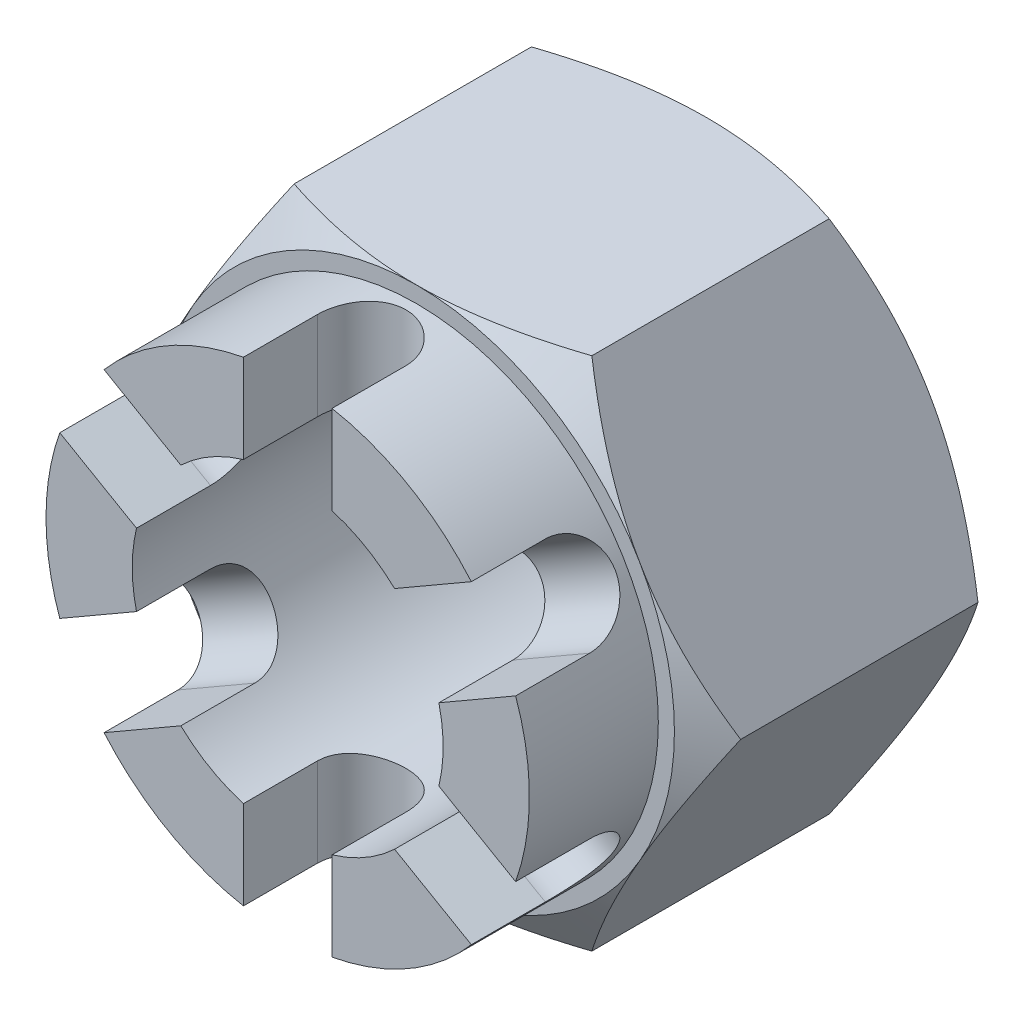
ISO-10303-21;
HEADER;
FILE_DESCRIPTION(('STEP AP214'),'2;1');
FILE_NAME('part.step','',(''),(''),'','','');
FILE_SCHEMA(('AUTOMOTIVE_DESIGN { 1 0 10303 214 1 1 1 1 }'));
ENDSEC;
DATA;
#1=APPLICATION_CONTEXT('core data for automotive mechanical design processes');
#2=APPLICATION_PROTOCOL_DEFINITION('international standard','automotive_design',2000,#1);
#3=PRODUCT_CONTEXT('',#1,'mechanical');
#4=PRODUCT('Part','Part','',(#3));
#5=PRODUCT_RELATED_PRODUCT_CATEGORY('part','',(#4));
#6=PRODUCT_DEFINITION_FORMATION('','',#4);
#7=PRODUCT_DEFINITION_CONTEXT('part definition',#1,'design');
#8=PRODUCT_DEFINITION('design','',#6,#7);
#9=PRODUCT_DEFINITION_SHAPE('','',#8);
#10=(LENGTH_UNIT() NAMED_UNIT(*) SI_UNIT(.MILLI.,.METRE.));
#11=(NAMED_UNIT(*) PLANE_ANGLE_UNIT() SI_UNIT($,.RADIAN.));
#12=(NAMED_UNIT(*) SI_UNIT($,.STERADIAN.) SOLID_ANGLE_UNIT());
#13=UNCERTAINTY_MEASURE_WITH_UNIT(LENGTH_MEASURE(1.E-05),#10,'distance_accuracy_value','');
#14=(GEOMETRIC_REPRESENTATION_CONTEXT(3) GLOBAL_UNCERTAINTY_ASSIGNED_CONTEXT((#13)) GLOBAL_UNIT_ASSIGNED_CONTEXT((#10,
#11,#12)) REPRESENTATION_CONTEXT('',''));
#15=CARTESIAN_POINT('',(0.,0.,0.));
#16=DIRECTION('',(0.,0.,1.));
#17=DIRECTION('',(1.,0.,0.));
#18=AXIS2_PLACEMENT_3D('',#15,#16,#17);
#19=CARTESIAN_POINT('',(0.,0.,26.));
#20=DIRECTION('',(0.,0.,-1.));
#21=DIRECTION('',(-1.,0.,0.));
#22=AXIS2_PLACEMENT_3D('',#19,#20,#21);
#23=PLANE('',#22);
#24=CARTESIAN_POINT('',(0.,0.,26.));
#25=DIRECTION('',(0.,0.,-1.));
#26=DIRECTION('',(-1.,0.,0.));
#27=AXIS2_PLACEMENT_3D('',#24,#25,#26);
#28=CIRCLE('',#27,15.);
#29=CARTESIAN_POINT('',(-14.1452045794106,-4.99131119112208,26.));
#30=VERTEX_POINT('',#29);
#31=CARTESIAN_POINT('',(-14.1452045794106,4.99131119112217,26.));
#32=VERTEX_POINT('',#31);
#33=EDGE_CURVE('E502',#30,#32,#28,.T.);
#34=ORIENTED_EDGE('',*,*,#33,.F.);
#35=DIRECTION('',(0.86602540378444,0.499999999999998,0.));
#36=VECTOR('',#35,1.);
#37=CARTESIAN_POINT('',(-22.1596096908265,-9.61843013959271,26.));
#38=LINE('',#37,#36);
#39=CARTESIAN_POINT('',(-9.38279451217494,-2.24173245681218,26.));
#40=VERTEX_POINT('',#39);
#41=EDGE_CURVE('E291',#30,#40,#38,.T.);
#42=ORIENTED_EDGE('',*,*,#41,.T.);
#43=CARTESIAN_POINT('',(0.,0.,26.));
#44=DIRECTION('',(0.,0.,-1.));
#45=DIRECTION('',(-1.,0.,0.));
#46=AXIS2_PLACEMENT_3D('',#43,#44,#45);
#47=CIRCLE('',#46,9.646875);
#48=CARTESIAN_POINT('',(-9.38279451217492,2.24173245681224,26.));
#49=VERTEX_POINT('',#48);
#50=EDGE_CURVE('E488',#40,#49,#47,.T.);
#51=ORIENTED_EDGE('',*,*,#50,.T.);
#52=DIRECTION('',(0.866025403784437,-0.500000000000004,0.));
#53=VECTOR('',#52,1.);
#54=CARTESIAN_POINT('',(-22.1596096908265,9.61843013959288,26.));
#55=LINE('',#54,#53);
#56=EDGE_CURVE('E544',#32,#49,#55,.T.);
#57=ORIENTED_EDGE('',*,*,#56,.F.);
#58=EDGE_LOOP('',(#34,#42,#51,#57));
#59=FACE_BOUND('',#58,.T.);
#60=ADVANCED_FACE('F31',(#59),#23,.F.);
#61=CARTESIAN_POINT('',(-11.3952045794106,9.75445091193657,26.));
#62=VERTEX_POINT('',#61);
#63=CARTESIAN_POINT('',(-2.75,14.7457621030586,26.));
#64=VERTEX_POINT('',#63);
#65=EDGE_CURVE('E497',#62,#64,#28,.T.);
#66=ORIENTED_EDGE('',*,*,#65,.F.);
#67=DIRECTION('',(0.866025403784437,-0.500000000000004,0.));
#68=VECTOR('',#67,1.);
#69=CARTESIAN_POINT('',(-19.4096096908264,14.3815698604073,26.));
#70=LINE('',#69,#68);
#71=CARTESIAN_POINT('',(-6.63279451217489,7.00487217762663,26.));
#72=VERTEX_POINT('',#71);
#73=EDGE_CURVE('E271',#62,#72,#70,.T.);
#74=ORIENTED_EDGE('',*,*,#73,.T.);
#75=CARTESIAN_POINT('',(-2.75,9.2466046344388,26.));
#76=VERTEX_POINT('',#75);
#77=EDGE_CURVE('E493',#72,#76,#47,.T.);
#78=ORIENTED_EDGE('',*,*,#77,.T.);
#79=DIRECTION('',(0.,1.,0.));
#80=VECTOR('',#79,1.);
#81=CARTESIAN_POINT('',(-2.75,-16.,26.));
#82=LINE('',#81,#80);
#83=EDGE_CURVE('E406',#76,#64,#82,.T.);
#84=ORIENTED_EDGE('',*,*,#83,.T.);
#85=EDGE_LOOP('',(#66,#74,#78,#84));
#86=FACE_BOUND('',#85,.T.);
#87=ADVANCED_FACE('F454',(#86),#23,.F.);
#88=CARTESIAN_POINT('',(2.75,9.24660463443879,26.));
#89=VERTEX_POINT('',#88);
#90=CARTESIAN_POINT('',(6.63279451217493,7.00487217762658,26.));
#91=VERTEX_POINT('',#90);
#92=EDGE_CURVE('E490',#89,#91,#47,.T.);
#93=ORIENTED_EDGE('',*,*,#92,.T.);
#94=CARTESIAN_POINT('',(11.3952045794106,9.75445091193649,26.));
#95=VERTEX_POINT('',#94);
#96=EDGE_CURVE('E295',#91,#95,#38,.T.);
#97=ORIENTED_EDGE('',*,*,#96,.T.);
#98=CARTESIAN_POINT('',(2.75,14.7457621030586,26.));
#99=VERTEX_POINT('',#98);
#100=EDGE_CURVE('E538',#99,#95,#28,.T.);
#101=ORIENTED_EDGE('',*,*,#100,.F.);
#102=DIRECTION('',(0.,1.,0.));
#103=VECTOR('',#102,1.);
#104=CARTESIAN_POINT('',(2.75,-16.,26.));
#105=LINE('',#104,#103);
#106=EDGE_CURVE('E405',#89,#99,#105,.T.);
#107=ORIENTED_EDGE('',*,*,#106,.F.);
#108=EDGE_LOOP('',(#93,#97,#101,#107));
#109=FACE_BOUND('',#108,.T.);
#110=ADVANCED_FACE('F458',(#109),#23,.F.);
#111=CARTESIAN_POINT('',(11.3952045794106,-9.75445091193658,26.));
#112=VERTEX_POINT('',#111);
#113=CARTESIAN_POINT('',(2.75,-14.7457621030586,26.));
#114=VERTEX_POINT('',#113);
#115=EDGE_CURVE('E532',#112,#114,#28,.T.);
#116=ORIENTED_EDGE('',*,*,#115,.F.);
#117=CARTESIAN_POINT('',(6.63279451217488,-7.00487217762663,26.));
#118=VERTEX_POINT('',#117);
#119=EDGE_CURVE('E549',#118,#112,#55,.T.);
#120=ORIENTED_EDGE('',*,*,#119,.F.);
#121=CARTESIAN_POINT('',(2.75,-9.24660463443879,26.));
#122=VERTEX_POINT('',#121);
#123=EDGE_CURVE('E487',#118,#122,#47,.T.);
#124=ORIENTED_EDGE('',*,*,#123,.T.);
#125=EDGE_CURVE('E418',#114,#122,#105,.T.);
#126=ORIENTED_EDGE('',*,*,#125,.F.);
#127=EDGE_LOOP('',(#116,#120,#124,#126));
#128=FACE_BOUND('',#127,.T.);
#129=ADVANCED_FACE('F469',(#128),#23,.F.);
#130=CARTESIAN_POINT('',(-2.75,-9.24660463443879,26.));
#131=VERTEX_POINT('',#130);
#132=CARTESIAN_POINT('',(-6.63279451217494,-7.00487217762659,26.));
#133=VERTEX_POINT('',#132);
#134=EDGE_CURVE('E481',#131,#133,#47,.T.);
#135=ORIENTED_EDGE('',*,*,#134,.T.);
#136=DIRECTION('',(0.86602540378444,0.499999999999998,0.));
#137=VECTOR('',#136,1.);
#138=CARTESIAN_POINT('',(-19.4096096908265,-14.3815698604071,26.));
#139=LINE('',#138,#137);
#140=CARTESIAN_POINT('',(-11.3952045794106,-9.75445091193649,26.));
#141=VERTEX_POINT('',#140);
#142=EDGE_CURVE('E483',#141,#133,#139,.T.);
#143=ORIENTED_EDGE('',*,*,#142,.F.);
#144=CARTESIAN_POINT('',(-2.75,-14.7457621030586,26.));
#145=VERTEX_POINT('',#144);
#146=EDGE_CURVE('E503',#145,#141,#28,.T.);
#147=ORIENTED_EDGE('',*,*,#146,.F.);
#148=EDGE_CURVE('E409',#145,#131,#82,.T.);
#149=ORIENTED_EDGE('',*,*,#148,.T.);
#150=EDGE_LOOP('',(#135,#143,#147,#149));
#151=FACE_BOUND('',#150,.T.);
#152=ADVANCED_FACE('F463',(#151),#23,.F.);
#153=CARTESIAN_POINT('',(-18.475208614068,0.,18.));
#154=DIRECTION('',(0.86602540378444,0.499999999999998,0.));
#155=DIRECTION('',(-0.499999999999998,0.86602540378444,0.));
#156=AXIS2_PLACEMENT_3D('',#153,#154,#155);
#157=PLANE('',#156);
#158=DIRECTION('',(0.,0.,-1.));
#159=VECTOR('',#158,1.);
#160=CARTESIAN_POINT('',(-9.237604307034,-16.,18.));
#161=LINE('',#160,#159);
#162=CARTESIAN_POINT('',(-9.23760430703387,-16.,16.3636363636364));
#163=VERTEX_POINT('',#162);
#164=CARTESIAN_POINT('',(-9.23760430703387,-16.,1.63636363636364));
#165=VERTEX_POINT('',#164);
#166=EDGE_CURVE('E594',#163,#165,#161,.T.);
#167=ORIENTED_EDGE('',*,*,#166,.F.);
#168=CARTESIAN_POINT('',(-9.23748883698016,-16.0002,16.3635600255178));
#169=CARTESIAN_POINT('',(-9.44322605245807,-15.6438526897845,16.4995591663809));
#170=CARTESIAN_POINT('',(-9.65000546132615,-15.2857002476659,16.6294654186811));
#171=CARTESIAN_POINT('',(-10.0657419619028,-14.5656235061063,16.8752319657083));
#172=CARTESIAN_POINT('',(-10.2747000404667,-14.2036974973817,16.9910855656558));
#173=CARTESIAN_POINT('',(-10.6953729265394,-13.4750706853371,17.2071036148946));
#174=CARTESIAN_POINT('',(-10.9070944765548,-13.1083582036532,17.3072159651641));
#175=CARTESIAN_POINT('',(-11.3324777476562,-12.3715727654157,17.4892565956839));
#176=CARTESIAN_POINT('',(-11.5461393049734,-12.0015000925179,17.5711863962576));
#177=CARTESIAN_POINT('',(-11.9682003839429,-11.2704688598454,17.7126047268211));
#178=CARTESIAN_POINT('',(-12.1765458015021,-10.9096040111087,17.7727349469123));
#179=CARTESIAN_POINT('',(-12.594468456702,-10.1857407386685,17.8726564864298));
#180=CARTESIAN_POINT('',(-12.8040457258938,-9.82274226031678,17.9124472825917));
#181=CARTESIAN_POINT('',(-13.2235930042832,-9.09606505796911,17.9705386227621));
#182=CARTESIAN_POINT('',(-13.4335617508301,-8.73238852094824,17.9888753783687));
#183=CARTESIAN_POINT('',(-13.8536868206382,-8.00471055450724,18.0036428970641));
#184=CARTESIAN_POINT('',(-14.0638431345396,-7.64070914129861,18.0000746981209));
#185=CARTESIAN_POINT('',(-14.4500771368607,-6.97173222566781,17.9734708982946));
#186=CARTESIAN_POINT('',(-14.626212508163,-6.66665681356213,17.9536506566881));
#187=CARTESIAN_POINT('',(-14.9779033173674,-6.05751046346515,17.899063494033));
#188=CARTESIAN_POINT('',(-15.1534587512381,-5.75343953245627,17.8642964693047));
#189=CARTESIAN_POINT('',(-15.5039203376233,-5.14642225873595,17.7804329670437));
#190=CARTESIAN_POINT('',(-15.6788254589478,-4.84347770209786,17.7313193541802));
#191=CARTESIAN_POINT('',(-16.0275527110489,-4.23946438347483,17.6196602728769));
#192=CARTESIAN_POINT('',(-16.2013748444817,-3.93839561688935,17.5571148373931));
#193=CARTESIAN_POINT('',(-16.7307575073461,-3.02147794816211,17.3469505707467));
#194=CARTESIAN_POINT('',(-17.0843270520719,-2.40907753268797,17.1792590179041));
#195=CARTESIAN_POINT('',(-17.7847514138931,-1.19590695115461,16.8011187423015));
#196=CARTESIAN_POINT('',(-18.1316214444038,-0.595110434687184,16.5907836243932));
#197=CARTESIAN_POINT('',(-18.4753240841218,0.000200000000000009,16.3635600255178));
#198=B_SPLINE_CURVE_WITH_KNOTS('',3,(#168,#169,#170,#171,#172,#173,#174,#175,#176,#177,#178,
#179,#180,#181,#182,#183,#184,#185,#186,#187,#188,#189,#190,#191,#192,#193,#194,#195,#196,#197),
.UNSPECIFIED.,.F.,.F.,(4,2,2,2,2,2,2,2,2,2,2,2,2,2,4),(0.,1.30015337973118,2.6009237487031,
3.90591256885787,5.21079223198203,6.47334812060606,7.73593648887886,8.99639068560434,
10.2567851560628,11.3149521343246,12.3731264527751,13.4325698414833,14.4920106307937,
16.6706288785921,18.8435176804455),.UNSPECIFIED.);
#199=CARTESIAN_POINT('',(-13.856406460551,-7.99999999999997,18.));
#200=VERTEX_POINT('',#199);
#201=EDGE_CURVE('E719',#163,#200,#198,.T.);
#202=ORIENTED_EDGE('',*,*,#201,.T.);
#203=CARTESIAN_POINT('',(-18.475208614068,0.,16.3636363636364));
#204=VERTEX_POINT('',#203);
#205=EDGE_CURVE('E725',#200,#204,#198,.T.);
#206=ORIENTED_EDGE('',*,*,#205,.T.);
#207=DIRECTION('',(0.,0.,-1.));
#208=VECTOR('',#207,1.);
#209=CARTESIAN_POINT('',(-18.475208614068,0.,18.));
#210=LINE('',#209,#208);
#211=CARTESIAN_POINT('',(-18.475208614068,0.,1.63636363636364));
#212=VERTEX_POINT('',#211);
#213=EDGE_CURVE('E604',#204,#212,#210,.T.);
#214=ORIENTED_EDGE('',*,*,#213,.T.);
#215=CARTESIAN_POINT('',(-18.4753240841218,0.00020000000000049,1.63643997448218));
#216=CARTESIAN_POINT('',(-18.2695868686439,-0.356147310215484,1.50044083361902));
#217=CARTESIAN_POINT('',(-18.0628074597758,-0.714299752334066,1.37053458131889));
#218=CARTESIAN_POINT('',(-17.6470709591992,-1.43437649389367,1.12476803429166));
#219=CARTESIAN_POINT('',(-17.4381128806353,-1.79630250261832,1.00891443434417));
#220=CARTESIAN_POINT('',(-17.0174399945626,-2.52492931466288,0.792896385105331));
#221=CARTESIAN_POINT('',(-16.8057184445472,-2.89164179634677,0.692784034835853));
#222=CARTESIAN_POINT('',(-16.3803351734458,-3.62842723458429,0.510743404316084));
#223=CARTESIAN_POINT('',(-16.1666736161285,-3.99849990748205,0.428813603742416));
#224=CARTESIAN_POINT('',(-15.744612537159,-4.72953114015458,0.287395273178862));
#225=CARTESIAN_POINT('',(-15.5362671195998,-5.09039598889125,0.227265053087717));
#226=CARTESIAN_POINT('',(-15.1183444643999,-5.81425926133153,0.127343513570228));
#227=CARTESIAN_POINT('',(-14.9087671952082,-6.17725773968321,0.087552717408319));
#228=CARTESIAN_POINT('',(-14.4892199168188,-6.90393494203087,0.029461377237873));
#229=CARTESIAN_POINT('',(-14.2792511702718,-7.26761147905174,0.011124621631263));
#230=CARTESIAN_POINT('',(-13.8591261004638,-7.99528944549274,-0.00364289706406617));
#231=CARTESIAN_POINT('',(-13.6489697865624,-8.35929085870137,-7.46981208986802E-05));
#232=CARTESIAN_POINT('',(-13.2627357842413,-9.02826777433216,0.0265291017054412));
#233=CARTESIAN_POINT('',(-13.0866004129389,-9.33334318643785,0.0463493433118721));
#234=CARTESIAN_POINT('',(-12.7349096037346,-9.94248953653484,0.100936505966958));
#235=CARTESIAN_POINT('',(-12.5593541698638,-10.2465604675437,0.135703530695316));
#236=CARTESIAN_POINT('',(-12.2088925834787,-10.853577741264,0.219567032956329));
#237=CARTESIAN_POINT('',(-12.0339874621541,-11.1565222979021,0.268680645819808));
#238=CARTESIAN_POINT('',(-11.685260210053,-11.7605356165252,0.380339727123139));
#239=CARTESIAN_POINT('',(-11.5114380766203,-12.0616043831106,0.442885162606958));
#240=CARTESIAN_POINT('',(-10.9820554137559,-12.9785220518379,0.653049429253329));
#241=CARTESIAN_POINT('',(-10.6284858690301,-13.590922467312,0.820740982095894));
#242=CARTESIAN_POINT('',(-9.92806150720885,-14.8040930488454,1.19888125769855));
#243=CARTESIAN_POINT('',(-9.58119147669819,-15.4048895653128,1.40921637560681));
#244=CARTESIAN_POINT('',(-9.23748883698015,-16.0002,1.63643997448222));
#245=B_SPLINE_CURVE_WITH_KNOTS('',3,(#215,#216,#217,#218,#219,#220,#221,#222,#223,#224,#225,
#226,#227,#228,#229,#230,#231,#232,#233,#234,#235,#236,#237,#238,#239,#240,#241,#242,#243,#244),
.UNSPECIFIED.,.F.,.F.,(4,2,2,2,2,2,2,2,2,2,2,2,2,2,4),(0.,1.30015337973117,2.60092374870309,
3.90591256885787,5.21079223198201,6.47334812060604,7.73593648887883,8.99639068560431,
10.2567851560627,11.3149521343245,12.3731264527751,13.4325698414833,14.4920106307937,
16.6706288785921,18.8435176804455),.UNSPECIFIED.);
#246=CARTESIAN_POINT('',(-13.856406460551,-7.99999999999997,0.));
#247=VERTEX_POINT('',#246);
#248=EDGE_CURVE('E606',#212,#247,#245,.T.);
#249=ORIENTED_EDGE('',*,*,#248,.T.);
#250=EDGE_CURVE('E607',#247,#165,#245,.T.);
#251=ORIENTED_EDGE('',*,*,#250,.T.);
#252=EDGE_LOOP('',(#167,#202,#206,#214,#249,#251));
#253=FACE_BOUND('',#252,.T.);
#254=ADVANCED_FACE('F33',(#253),#157,.F.);
#255=CARTESIAN_POINT('',(-9.237604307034,-16.,18.));
#256=DIRECTION('',(0.,1.,0.));
#257=DIRECTION('',(-1.,0.,0.));
#258=AXIS2_PLACEMENT_3D('',#255,#256,#257);
#259=PLANE('',#258);
#260=DIRECTION('',(0.,0.,-1.));
#261=VECTOR('',#260,1.);
#262=CARTESIAN_POINT('',(9.237604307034,-16.,18.));
#263=LINE('',#262,#261);
#264=CARTESIAN_POINT('',(9.23760430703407,-15.9999999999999,16.3636363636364));
#265=VERTEX_POINT('',#264);
#266=CARTESIAN_POINT('',(9.23760430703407,-15.9999999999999,1.63636363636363));
#267=VERTEX_POINT('',#266);
#268=EDGE_CURVE('E596',#265,#267,#263,.T.);
#269=ORIENTED_EDGE('',*,*,#268,.F.);
#270=CARTESIAN_POINT('',(-23.2462863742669,-16.,9.92109107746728));
#271=CARTESIAN_POINT('',(-22.9233119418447,-16.,10.0969717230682));
#272=CARTESIAN_POINT('',(-22.5998460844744,-16.,10.2719494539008));
#273=CARTESIAN_POINT('',(-21.9518325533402,-16.,10.6198997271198));
#274=CARTESIAN_POINT('',(-21.6272848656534,-16.,10.7928722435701));
#275=CARTESIAN_POINT('',(-20.6517631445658,-16.,11.3085395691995));
#276=CARTESIAN_POINT('',(-19.9990295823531,-16.,11.6479190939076));
#277=CARTESIAN_POINT('',(-18.6838907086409,-16.,12.3178754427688));
#278=CARTESIAN_POINT('',(-18.0214504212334,-16.,12.6483837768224));
#279=CARTESIAN_POINT('',(-16.6898902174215,-16.,13.2956137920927));
#280=CARTESIAN_POINT('',(-16.0207706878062,-16.,13.6123362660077));
#281=CARTESIAN_POINT('',(-14.6629060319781,-16.,14.233756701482));
#282=CARTESIAN_POINT('',(-13.9740216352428,-16.,14.5381519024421));
#283=CARTESIAN_POINT('',(-12.5864119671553,-16.,15.1240442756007));
#284=CARTESIAN_POINT('',(-11.8876855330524,-16.,15.4055387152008));
#285=CARTESIAN_POINT('',(-10.480593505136,-16.,15.9384597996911));
#286=CARTESIAN_POINT('',(-9.77225353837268,-16.,16.1899535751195));
#287=CARTESIAN_POINT('',(-8.34334364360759,-16.,16.655317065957));
#288=CARTESIAN_POINT('',(-7.62277788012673,-16.,16.8691993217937));
#289=CARTESIAN_POINT('',(-6.50323809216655,-16.,17.1621393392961));
#290=CARTESIAN_POINT('',(-6.1086373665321,-16.,17.2579890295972));
#291=CARTESIAN_POINT('',(-5.3159713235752,-16.,17.4341852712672));
#292=CARTESIAN_POINT('',(-4.91790610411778,-16.,17.5145322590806));
#293=CARTESIAN_POINT('',(-4.11871420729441,-16.,17.6581168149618));
#294=CARTESIAN_POINT('',(-3.71758775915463,-16.,17.721355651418));
#295=CARTESIAN_POINT('',(-2.9128303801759,-16.,17.8292973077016));
#296=CARTESIAN_POINT('',(-2.50919945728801,-16.,17.8740001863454));
#297=CARTESIAN_POINT('',(-1.70373723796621,-16.,17.9434472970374));
#298=CARTESIAN_POINT('',(-1.30192067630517,-16.,17.9683611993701));
#299=CARTESIAN_POINT('',(-0.497546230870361,-16.,17.9982167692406));
#300=CARTESIAN_POINT('',(-0.0949883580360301,-16.,18.0031587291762));
#301=CARTESIAN_POINT('',(0.70979256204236,-16.,17.9929371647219));
#302=CARTESIAN_POINT('',(1.11201565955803,-16.,17.9777775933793));
#303=CARTESIAN_POINT('',(1.91523273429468,-16.,17.927769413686));
#304=CARTESIAN_POINT('',(2.31622666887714,-16.,17.8929201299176));
#305=CARTESIAN_POINT('',(3.19805303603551,-16.,17.7953453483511));
#306=CARTESIAN_POINT('',(3.67841814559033,-16.,17.7283725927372));
#307=CARTESIAN_POINT('',(4.63494721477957,-16.,17.5693758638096));
#308=CARTESIAN_POINT('',(5.11111079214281,-16.,17.4773496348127));
#309=CARTESIAN_POINT('',(6.53386958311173,-16.,17.1673765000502));
#310=CARTESIAN_POINT('',(7.47322164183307,-16.,16.9157177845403));
#311=CARTESIAN_POINT('',(8.87766906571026,-16.,16.4840696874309));
#312=CARTESIAN_POINT('',(9.35080435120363,-16.,16.3289172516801));
#313=CARTESIAN_POINT('',(10.2919155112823,-16.,16.0034323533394));
#314=CARTESIAN_POINT('',(10.7598909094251,-16.,15.8330985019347));
#315=CARTESIAN_POINT('',(11.6886042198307,-16.,15.4804811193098));
#316=CARTESIAN_POINT('',(12.1493665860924,-16.,15.2982614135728));
#317=CARTESIAN_POINT('',(13.0663029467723,-16.,14.9230447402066));
#318=CARTESIAN_POINT('',(13.5224784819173,-16.,14.7300515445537));
#319=CARTESIAN_POINT('',(13.9766600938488,-16.,14.5325703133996));
#320=B_SPLINE_CURVE_WITH_KNOTS('',3,(#270,#271,#272,#273,#274,#275,#276,#277,#278,#279,#280,
#281,#282,#283,#284,#285,#286,#287,#288,#289,#290,#291,#292,#293,#294,#295,#296,#297,#298,#299,
#300,#301,#302,#303,#304,#305,#306,#307,#308,#309,#310,#311,#312,#313,#314,#315,#316,#317,#318,
#319),.UNSPECIFIED.,.F.,.F.,(4,2,2,2,2,2,2,2,2,2,2,2,2,2,2,2,2,2,2,2,2,2,2,2,4),(0.,
1.10327352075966,2.20656129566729,4.41354402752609,6.63435696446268,8.85504203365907,
11.1141396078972,13.3735063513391,15.6277186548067,17.8811779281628,19.0991444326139,
20.3170766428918,21.5349185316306,22.7527565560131,23.9600366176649,25.1672990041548,
26.3743240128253,27.5813904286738,29.035654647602,30.4900498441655,33.4033871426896,
34.8970181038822,36.390785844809,37.8771045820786,39.3629061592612),.UNSPECIFIED.);
#321=CARTESIAN_POINT('',(0.,-16.,18.));
#322=VERTEX_POINT('',#321);
#323=EDGE_CURVE('E710',#265,#322,#320,.F.);
#324=ORIENTED_EDGE('',*,*,#323,.T.);
#325=EDGE_CURVE('E681',#322,#163,#320,.F.);
#326=ORIENTED_EDGE('',*,*,#325,.T.);
#327=ORIENTED_EDGE('',*,*,#166,.T.);
#328=CARTESIAN_POINT('',(-23.246286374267,-16.,8.07890892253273));
#329=CARTESIAN_POINT('',(-22.9233119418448,-16.,7.90302827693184));
#330=CARTESIAN_POINT('',(-22.5998460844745,-16.,7.72805054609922));
#331=CARTESIAN_POINT('',(-21.9518325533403,-16.,7.38010027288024));
#332=CARTESIAN_POINT('',(-21.6272848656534,-16.,7.20712775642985));
#333=CARTESIAN_POINT('',(-20.6517631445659,-16.,6.69146043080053));
#334=CARTESIAN_POINT('',(-19.9990295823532,-16.,6.35208090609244));
#335=CARTESIAN_POINT('',(-18.6838907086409,-16.,5.68212455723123));
#336=CARTESIAN_POINT('',(-18.0214504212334,-16.,5.35161622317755));
#337=CARTESIAN_POINT('',(-16.6898902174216,-16.,4.7043862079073));
#338=CARTESIAN_POINT('',(-16.0207706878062,-16.,4.38766373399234));
#339=CARTESIAN_POINT('',(-14.6629060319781,-16.,3.76624329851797));
#340=CARTESIAN_POINT('',(-13.9740216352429,-16.,3.46184809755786));
#341=CARTESIAN_POINT('',(-12.5864119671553,-16.,2.87595572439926));
#342=CARTESIAN_POINT('',(-11.8876855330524,-16.,2.59446128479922));
#343=CARTESIAN_POINT('',(-10.480593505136,-16.,2.06154020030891));
#344=CARTESIAN_POINT('',(-9.77225353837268,-16.,1.81004642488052));
#345=CARTESIAN_POINT('',(-8.34334364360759,-16.,1.344682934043));
#346=CARTESIAN_POINT('',(-7.62277788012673,-16.,1.13080067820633));
#347=CARTESIAN_POINT('',(-6.50323809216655,-16.,0.837860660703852));
#348=CARTESIAN_POINT('',(-6.1086373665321,-16.,0.742010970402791));
#349=CARTESIAN_POINT('',(-5.31597132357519,-16.,0.56581472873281));
#350=CARTESIAN_POINT('',(-4.91790610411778,-16.,0.485467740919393));
#351=CARTESIAN_POINT('',(-4.11871420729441,-16.,0.341883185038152));
#352=CARTESIAN_POINT('',(-3.71758775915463,-16.,0.278644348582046));
#353=CARTESIAN_POINT('',(-2.9128303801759,-16.,0.170702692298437));
#354=CARTESIAN_POINT('',(-2.50919945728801,-16.,0.125999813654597));
#355=CARTESIAN_POINT('',(-1.70373723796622,-16.,0.0565527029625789));
#356=CARTESIAN_POINT('',(-1.30192067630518,-16.,0.031638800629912));
#357=CARTESIAN_POINT('',(-0.497546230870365,-16.,0.00178323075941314));
#358=CARTESIAN_POINT('',(-0.0949883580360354,-16.,-0.00315872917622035));
#359=CARTESIAN_POINT('',(0.709792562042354,-16.,0.0070628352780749));
#360=CARTESIAN_POINT('',(1.11201565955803,-16.,0.0222224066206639));
#361=CARTESIAN_POINT('',(1.91523273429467,-16.,0.0722305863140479));
#362=CARTESIAN_POINT('',(2.31622666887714,-16.,0.107079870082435));
#363=CARTESIAN_POINT('',(3.1980530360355,-16.,0.204654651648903));
#364=CARTESIAN_POINT('',(3.67841814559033,-16.,0.271627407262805));
#365=CARTESIAN_POINT('',(4.63494721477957,-16.,0.430624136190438));
#366=CARTESIAN_POINT('',(5.11111079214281,-16.,0.522650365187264));
#367=CARTESIAN_POINT('',(6.53386958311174,-16.,0.832623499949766));
#368=CARTESIAN_POINT('',(7.47322164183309,-16.,1.0842822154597));
#369=CARTESIAN_POINT('',(8.87766906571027,-16.,1.51593031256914));
#370=CARTESIAN_POINT('',(9.35080435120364,-16.,1.67108274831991));
#371=CARTESIAN_POINT('',(10.2919155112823,-16.,1.99656764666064));
#372=CARTESIAN_POINT('',(10.7598909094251,-16.,2.16690149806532));
#373=CARTESIAN_POINT('',(11.6886042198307,-16.,2.51951888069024));
#374=CARTESIAN_POINT('',(12.1493665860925,-16.,2.70173858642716));
#375=CARTESIAN_POINT('',(13.0663029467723,-16.,3.07695525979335));
#376=CARTESIAN_POINT('',(13.5224784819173,-16.,3.2699484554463));
#377=CARTESIAN_POINT('',(13.9766600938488,-16.,3.46742968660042));
#378=B_SPLINE_CURVE_WITH_KNOTS('',3,(#328,#329,#330,#331,#332,#333,#334,#335,#336,#337,#338,
#339,#340,#341,#342,#343,#344,#345,#346,#347,#348,#349,#350,#351,#352,#353,#354,#355,#356,#357,
#358,#359,#360,#361,#362,#363,#364,#365,#366,#367,#368,#369,#370,#371,#372,#373,#374,#375,#376,
#377),.UNSPECIFIED.,.F.,.F.,(4,2,2,2,2,2,2,2,2,2,2,2,2,2,2,2,2,2,2,2,2,2,2,2,4),(0.,
1.10327352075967,2.2065612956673,4.4135440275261,6.63435696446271,8.85504203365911,
11.1141396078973,13.3735063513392,15.6277186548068,17.8811779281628,19.0991444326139,
20.3170766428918,21.5349185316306,22.7527565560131,23.9600366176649,25.1672990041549,
26.3743240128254,27.5813904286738,29.0356546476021,30.4900498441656,33.4033871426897,
34.8970181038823,36.3907858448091,37.8771045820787,39.3629061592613),.UNSPECIFIED.);
#379=CARTESIAN_POINT('',(0.,-16.,0.));
#380=VERTEX_POINT('',#379);
#381=EDGE_CURVE('E614',#165,#380,#378,.T.);
#382=ORIENTED_EDGE('',*,*,#381,.T.);
#383=EDGE_CURVE('E615',#380,#267,#378,.T.);
#384=ORIENTED_EDGE('',*,*,#383,.T.);
#385=EDGE_LOOP('',(#269,#324,#326,#327,#382,#384));
#386=FACE_BOUND('',#385,.T.);
#387=ADVANCED_FACE('F474',(#386),#259,.F.);
#388=CARTESIAN_POINT('',(9.237604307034,-16.,18.));
#389=DIRECTION('',(-0.86602540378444,0.499999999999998,0.));
#390=DIRECTION('',(-0.499999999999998,-0.86602540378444,0.));
#391=AXIS2_PLACEMENT_3D('',#388,#389,#390);
#392=PLANE('',#391);
#393=DIRECTION('',(0.,0.,-1.));
#394=VECTOR('',#393,1.);
#395=CARTESIAN_POINT('',(18.475208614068,0.,18.));
#396=LINE('',#395,#394);
#397=CARTESIAN_POINT('',(18.475208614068,0.,16.3636363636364));
#398=VERTEX_POINT('',#397);
#399=CARTESIAN_POINT('',(18.475208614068,0.,1.63636363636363));
#400=VERTEX_POINT('',#399);
#401=EDGE_CURVE('E598',#398,#400,#396,.T.);
#402=ORIENTED_EDGE('',*,*,#401,.F.);
#403=CARTESIAN_POINT('',(18.4753240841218,0.000200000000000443,16.3635600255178));
#404=CARTESIAN_POINT('',(18.2695868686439,-0.356147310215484,16.499559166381));
#405=CARTESIAN_POINT('',(18.0628074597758,-0.714299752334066,16.6294654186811));
#406=CARTESIAN_POINT('',(17.6470709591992,-1.43437649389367,16.8752319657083));
#407=CARTESIAN_POINT('',(17.4381128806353,-1.79630250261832,16.9910855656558));
#408=CARTESIAN_POINT('',(17.0174399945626,-2.52492931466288,17.2071036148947));
#409=CARTESIAN_POINT('',(16.8057184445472,-2.89164179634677,17.3072159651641));
#410=CARTESIAN_POINT('',(16.3803351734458,-3.62842723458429,17.4892565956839));
#411=CARTESIAN_POINT('',(16.1666736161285,-3.99849990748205,17.5711863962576));
#412=CARTESIAN_POINT('',(15.744612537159,-4.72953114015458,17.7126047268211));
#413=CARTESIAN_POINT('',(15.5362671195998,-5.09039598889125,17.7727349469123));
#414=CARTESIAN_POINT('',(15.1183444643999,-5.81425926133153,17.8726564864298));
#415=CARTESIAN_POINT('',(14.9087671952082,-6.17725773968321,17.9124472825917));
#416=CARTESIAN_POINT('',(14.4892199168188,-6.90393494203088,17.9705386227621));
#417=CARTESIAN_POINT('',(14.2792511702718,-7.26761147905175,17.9888753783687));
#418=CARTESIAN_POINT('',(13.8591261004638,-7.99528944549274,18.0036428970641));
#419=CARTESIAN_POINT('',(13.6489697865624,-8.35929085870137,18.0000746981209));
#420=CARTESIAN_POINT('',(13.2627357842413,-9.02826777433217,17.9734708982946));
#421=CARTESIAN_POINT('',(13.0866004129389,-9.33334318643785,17.9536506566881));
#422=CARTESIAN_POINT('',(12.7349096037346,-9.94248953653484,17.899063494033));
#423=CARTESIAN_POINT('',(12.5593541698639,-10.2465604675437,17.8642964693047));
#424=CARTESIAN_POINT('',(12.2088925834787,-10.853577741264,17.7804329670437));
#425=CARTESIAN_POINT('',(12.0339874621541,-11.1565222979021,17.7313193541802));
#426=CARTESIAN_POINT('',(11.685260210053,-11.7605356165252,17.6196602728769));
#427=CARTESIAN_POINT('',(11.5114380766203,-12.0616043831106,17.557114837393));
#428=CARTESIAN_POINT('',(10.9820554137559,-12.9785220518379,17.3469505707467));
#429=CARTESIAN_POINT('',(10.6284858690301,-13.590922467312,17.1792590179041));
#430=CARTESIAN_POINT('',(9.92806150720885,-14.8040930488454,16.8011187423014));
#431=CARTESIAN_POINT('',(9.5811914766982,-15.4048895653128,16.5907836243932));
#432=CARTESIAN_POINT('',(9.23748883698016,-16.0002,16.3635600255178));
#433=B_SPLINE_CURVE_WITH_KNOTS('',3,(#403,#404,#405,#406,#407,#408,#409,#410,#411,#412,#413,
#414,#415,#416,#417,#418,#419,#420,#421,#422,#423,#424,#425,#426,#427,#428,#429,#430,#431,#432),
.UNSPECIFIED.,.F.,.F.,(4,2,2,2,2,2,2,2,2,2,2,2,2,2,4),(0.,1.30015337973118,2.60092374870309,
3.90591256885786,5.21079223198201,6.47334812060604,7.73593648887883,8.99639068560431,
10.2567851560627,11.3149521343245,12.3731264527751,13.4325698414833,14.4920106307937,
16.6706288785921,18.8435176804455),.UNSPECIFIED.);
#434=CARTESIAN_POINT('',(13.8564064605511,-7.99999999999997,18.));
#435=VERTEX_POINT('',#434);
#436=EDGE_CURVE('E679',#398,#435,#433,.T.);
#437=ORIENTED_EDGE('',*,*,#436,.T.);
#438=EDGE_CURVE('E673',#435,#265,#433,.T.);
#439=ORIENTED_EDGE('',*,*,#438,.T.);
#440=ORIENTED_EDGE('',*,*,#268,.T.);
#441=CARTESIAN_POINT('',(9.23748883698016,-16.0002,1.63643997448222));
#442=CARTESIAN_POINT('',(9.44322605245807,-15.6438526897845,1.50044083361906));
#443=CARTESIAN_POINT('',(9.65000546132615,-15.2857002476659,1.37053458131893));
#444=CARTESIAN_POINT('',(10.0657419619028,-14.5656235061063,1.1247680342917));
#445=CARTESIAN_POINT('',(10.2747000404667,-14.2036974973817,1.00891443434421));
#446=CARTESIAN_POINT('',(10.6953729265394,-13.4750706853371,0.792896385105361));
#447=CARTESIAN_POINT('',(10.9070944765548,-13.1083582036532,0.692784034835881));
#448=CARTESIAN_POINT('',(11.3324777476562,-12.3715727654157,0.510743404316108));
#449=CARTESIAN_POINT('',(11.5461393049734,-12.001500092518,0.428813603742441));
#450=CARTESIAN_POINT('',(11.968200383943,-11.2704688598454,0.287395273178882));
#451=CARTESIAN_POINT('',(12.1765458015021,-10.9096040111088,0.227265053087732));
#452=CARTESIAN_POINT('',(12.594468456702,-10.1857407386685,0.127343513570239));
#453=CARTESIAN_POINT('',(12.8040457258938,-9.82274226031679,0.0875527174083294));
#454=CARTESIAN_POINT('',(13.2235930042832,-9.09606505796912,0.0294613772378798));
#455=CARTESIAN_POINT('',(13.4335617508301,-8.73238852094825,0.0111246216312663));
#456=CARTESIAN_POINT('',(13.8536868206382,-8.00471055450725,-0.00364289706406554));
#457=CARTESIAN_POINT('',(14.0638431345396,-7.64070914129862,-7.46981208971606E-05));
#458=CARTESIAN_POINT('',(14.4500771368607,-6.97173222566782,0.0265291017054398));
#459=CARTESIAN_POINT('',(14.626212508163,-6.66665681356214,0.0463493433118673));
#460=CARTESIAN_POINT('',(14.9779033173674,-6.05751046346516,0.100936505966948));
#461=CARTESIAN_POINT('',(15.1534587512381,-5.75343953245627,0.135703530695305));
#462=CARTESIAN_POINT('',(15.5039203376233,-5.14642225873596,0.219567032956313));
#463=CARTESIAN_POINT('',(15.6788254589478,-4.84347770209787,0.26868064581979));
#464=CARTESIAN_POINT('',(16.0275527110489,-4.23946438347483,0.380339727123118));
#465=CARTESIAN_POINT('',(16.2013748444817,-3.93839561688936,0.442885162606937));
#466=CARTESIAN_POINT('',(16.7307575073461,-3.02147794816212,0.653049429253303));
#467=CARTESIAN_POINT('',(17.0843270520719,-2.40907753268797,0.820740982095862));
#468=CARTESIAN_POINT('',(17.7847514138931,-1.19590695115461,1.19888125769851));
#469=CARTESIAN_POINT('',(18.1316214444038,-0.595110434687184,1.40921637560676));
#470=CARTESIAN_POINT('',(18.4753240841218,0.000200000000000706,1.63643997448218));
#471=B_SPLINE_CURVE_WITH_KNOTS('',3,(#441,#442,#443,#444,#445,#446,#447,#448,#449,#450,#451,
#452,#453,#454,#455,#456,#457,#458,#459,#460,#461,#462,#463,#464,#465,#466,#467,#468,#469,#470),
.UNSPECIFIED.,.F.,.F.,(4,2,2,2,2,2,2,2,2,2,2,2,2,2,4),(0.,1.30015337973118,2.6009237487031,
3.90591256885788,5.21079223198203,6.47334812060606,7.73593648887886,8.99639068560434,
10.2567851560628,11.3149521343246,12.3731264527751,13.4325698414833,14.4920106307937,
16.6706288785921,18.8435176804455),.UNSPECIFIED.);
#472=CARTESIAN_POINT('',(13.856406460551,-7.99999999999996,0.));
#473=VERTEX_POINT('',#472);
#474=EDGE_CURVE('E662',#267,#473,#471,.T.);
#475=ORIENTED_EDGE('',*,*,#474,.T.);
#476=EDGE_CURVE('E656',#473,#400,#471,.T.);
#477=ORIENTED_EDGE('',*,*,#476,.T.);
#478=EDGE_LOOP('',(#402,#437,#439,#440,#475,#477));
#479=FACE_BOUND('',#478,.T.);
#480=ADVANCED_FACE('F664',(#479),#392,.F.);
#481=CARTESIAN_POINT('',(18.475208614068,0.,18.));
#482=DIRECTION('',(-0.86602540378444,-0.499999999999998,0.));
#483=DIRECTION('',(0.499999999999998,-0.86602540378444,0.));
#484=AXIS2_PLACEMENT_3D('',#481,#482,#483);
#485=PLANE('',#484);
#486=DIRECTION('',(0.,0.,-1.));
#487=VECTOR('',#486,1.);
#488=CARTESIAN_POINT('',(9.237604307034,16.,18.));
#489=LINE('',#488,#487);
#490=CARTESIAN_POINT('',(9.23760430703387,16.,16.3636363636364));
#491=VERTEX_POINT('',#490);
#492=CARTESIAN_POINT('',(9.23760430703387,16.,1.63636363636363));
#493=VERTEX_POINT('',#492);
#494=EDGE_CURVE('E600',#491,#493,#489,.T.);
#495=ORIENTED_EDGE('',*,*,#494,.F.);
#496=CARTESIAN_POINT('',(9.23748883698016,16.0002,16.3635600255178));
#497=CARTESIAN_POINT('',(9.44322605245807,15.6438526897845,16.4995591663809));
#498=CARTESIAN_POINT('',(9.65000546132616,15.2857002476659,16.6294654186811));
#499=CARTESIAN_POINT('',(10.0657419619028,14.5656235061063,16.8752319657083));
#500=CARTESIAN_POINT('',(10.2747000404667,14.2036974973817,16.9910855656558));
#501=CARTESIAN_POINT('',(10.6953729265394,13.4750706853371,17.2071036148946));
#502=CARTESIAN_POINT('',(10.9070944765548,13.1083582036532,17.3072159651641));
#503=CARTESIAN_POINT('',(11.3324777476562,12.3715727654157,17.4892565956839));
#504=CARTESIAN_POINT('',(11.5461393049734,12.0015000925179,17.5711863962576));
#505=CARTESIAN_POINT('',(11.968200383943,11.2704688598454,17.7126047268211));
#506=CARTESIAN_POINT('',(12.1765458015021,10.9096040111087,17.7727349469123));
#507=CARTESIAN_POINT('',(12.594468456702,10.1857407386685,17.8726564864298));
#508=CARTESIAN_POINT('',(12.8040457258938,9.82274226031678,17.9124472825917));
#509=CARTESIAN_POINT('',(13.2235930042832,9.09606505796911,17.9705386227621));
#510=CARTESIAN_POINT('',(13.4335617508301,8.73238852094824,17.9888753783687));
#511=CARTESIAN_POINT('',(13.8536868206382,8.00471055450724,18.0036428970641));
#512=CARTESIAN_POINT('',(14.0638431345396,7.64070914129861,18.0000746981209));
#513=CARTESIAN_POINT('',(14.4500771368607,6.97173222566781,17.9734708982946));
#514=CARTESIAN_POINT('',(14.626212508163,6.66665681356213,17.9536506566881));
#515=CARTESIAN_POINT('',(14.9779033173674,6.05751046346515,17.899063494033));
#516=CARTESIAN_POINT('',(15.1534587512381,5.75343953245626,17.8642964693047));
#517=CARTESIAN_POINT('',(15.5039203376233,5.14642225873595,17.7804329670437));
#518=CARTESIAN_POINT('',(15.6788254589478,4.84347770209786,17.7313193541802));
#519=CARTESIAN_POINT('',(16.0275527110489,4.23946438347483,17.6196602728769));
#520=CARTESIAN_POINT('',(16.2013748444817,3.93839561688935,17.5571148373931));
#521=CARTESIAN_POINT('',(16.7307575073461,3.02147794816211,17.3469505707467));
#522=CARTESIAN_POINT('',(17.0843270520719,2.40907753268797,17.1792590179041));
#523=CARTESIAN_POINT('',(17.7847514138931,1.19590695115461,16.8011187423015));
#524=CARTESIAN_POINT('',(18.1316214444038,0.595110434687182,16.5907836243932));
#525=CARTESIAN_POINT('',(18.4753240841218,-0.000200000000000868,16.3635600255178));
#526=B_SPLINE_CURVE_WITH_KNOTS('',3,(#496,#497,#498,#499,#500,#501,#502,#503,#504,#505,#506,
#507,#508,#509,#510,#511,#512,#513,#514,#515,#516,#517,#518,#519,#520,#521,#522,#523,#524,#525),
.UNSPECIFIED.,.F.,.F.,(4,2,2,2,2,2,2,2,2,2,2,2,2,2,4),(0.,1.30015337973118,2.6009237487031,
3.90591256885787,5.21079223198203,6.47334812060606,7.73593648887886,8.99639068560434,
10.2567851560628,11.3149521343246,12.3731264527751,13.4325698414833,14.4920106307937,
16.6706288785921,18.8435176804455),.UNSPECIFIED.);
#527=CARTESIAN_POINT('',(13.856406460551,7.99999999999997,18.));
#528=VERTEX_POINT('',#527);
#529=EDGE_CURVE('E709',#491,#528,#526,.T.);
#530=ORIENTED_EDGE('',*,*,#529,.T.);
#531=EDGE_CURVE('E680',#528,#398,#526,.T.);
#532=ORIENTED_EDGE('',*,*,#531,.T.);
#533=ORIENTED_EDGE('',*,*,#401,.T.);
#534=CARTESIAN_POINT('',(18.4753240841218,-0.000199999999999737,1.63643997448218));
#535=CARTESIAN_POINT('',(18.2695868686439,0.356147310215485,1.50044083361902));
#536=CARTESIAN_POINT('',(18.0628074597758,0.714299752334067,1.37053458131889));
#537=CARTESIAN_POINT('',(17.6470709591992,1.43437649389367,1.12476803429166));
#538=CARTESIAN_POINT('',(17.4381128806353,1.79630250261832,1.00891443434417));
#539=CARTESIAN_POINT('',(17.0174399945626,2.52492931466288,0.792896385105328));
#540=CARTESIAN_POINT('',(16.8057184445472,2.89164179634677,0.692784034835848));
#541=CARTESIAN_POINT('',(16.3803351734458,3.62842723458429,0.51074340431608));
#542=CARTESIAN_POINT('',(16.1666736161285,3.99849990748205,0.428813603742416));
#543=CARTESIAN_POINT('',(15.744612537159,4.72953114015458,0.287395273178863));
#544=CARTESIAN_POINT('',(15.5362671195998,5.09039598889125,0.227265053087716));
#545=CARTESIAN_POINT('',(15.1183444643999,5.81425926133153,0.127343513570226));
#546=CARTESIAN_POINT('',(14.9087671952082,6.17725773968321,0.0875527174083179));
#547=CARTESIAN_POINT('',(14.4892199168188,6.90393494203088,0.0294613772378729));
#548=CARTESIAN_POINT('',(14.2792511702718,7.26761147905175,0.0111246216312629));
#549=CARTESIAN_POINT('',(13.8591261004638,7.99528944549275,-0.00364289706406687));
#550=CARTESIAN_POINT('',(13.6489697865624,8.35929085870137,-7.46981208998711E-05));
#551=CARTESIAN_POINT('',(13.2627357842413,9.02826777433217,0.0265291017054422));
#552=CARTESIAN_POINT('',(13.0866004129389,9.33334318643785,0.0463493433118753));
#553=CARTESIAN_POINT('',(12.7349096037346,9.94248953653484,0.100936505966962));
#554=CARTESIAN_POINT('',(12.5593541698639,10.2465604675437,0.135703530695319));
#555=CARTESIAN_POINT('',(12.2088925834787,10.853577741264,0.21956703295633));
#556=CARTESIAN_POINT('',(12.0339874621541,11.1565222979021,0.26868064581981));
#557=CARTESIAN_POINT('',(11.685260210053,11.7605356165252,0.380339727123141));
#558=CARTESIAN_POINT('',(11.5114380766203,12.0616043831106,0.442885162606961));
#559=CARTESIAN_POINT('',(10.9820554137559,12.9785220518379,0.653049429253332));
#560=CARTESIAN_POINT('',(10.6284858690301,13.590922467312,0.820740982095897));
#561=CARTESIAN_POINT('',(9.92806150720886,14.8040930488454,1.19888125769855));
#562=CARTESIAN_POINT('',(9.5811914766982,15.4048895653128,1.40921637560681));
#563=CARTESIAN_POINT('',(9.23748883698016,16.0002,1.63643997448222));
#564=B_SPLINE_CURVE_WITH_KNOTS('',3,(#534,#535,#536,#537,#538,#539,#540,#541,#542,#543,#544,
#545,#546,#547,#548,#549,#550,#551,#552,#553,#554,#555,#556,#557,#558,#559,#560,#561,#562,#563),
.UNSPECIFIED.,.F.,.F.,(4,2,2,2,2,2,2,2,2,2,2,2,2,2,4),(0.,1.30015337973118,2.60092374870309,
3.90591256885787,5.21079223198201,6.47334812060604,7.73593648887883,8.99639068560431,
10.2567851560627,11.3149521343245,12.3731264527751,13.4325698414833,14.4920106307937,
16.6706288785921,18.8435176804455),.UNSPECIFIED.);
#565=CARTESIAN_POINT('',(13.856406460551,7.99999999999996,0.));
#566=VERTEX_POINT('',#565);
#567=EDGE_CURVE('E663',#400,#566,#564,.T.);
#568=ORIENTED_EDGE('',*,*,#567,.T.);
#569=EDGE_CURVE('E651',#566,#493,#564,.T.);
#570=ORIENTED_EDGE('',*,*,#569,.T.);
#571=EDGE_LOOP('',(#495,#530,#532,#533,#568,#570));
#572=FACE_BOUND('',#571,.T.);
#573=ADVANCED_FACE('F667',(#572),#485,.F.);
#574=CARTESIAN_POINT('',(9.237604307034,16.,18.));
#575=DIRECTION('',(0.,-1.,0.));
#576=DIRECTION('',(1.,0.,0.));
#577=AXIS2_PLACEMENT_3D('',#574,#575,#576);
#578=PLANE('',#577);
#579=DIRECTION('',(0.,0.,-1.));
#580=VECTOR('',#579,1.);
#581=CARTESIAN_POINT('',(-9.23760430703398,16.,18.));
#582=LINE('',#581,#580);
#583=CARTESIAN_POINT('',(-9.23760430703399,16.,16.3636363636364));
#584=VERTEX_POINT('',#583);
#585=CARTESIAN_POINT('',(-9.23760430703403,15.9999999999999,1.63636363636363));
#586=VERTEX_POINT('',#585);
#587=EDGE_CURVE('E602',#584,#586,#582,.T.);
#588=ORIENTED_EDGE('',*,*,#587,.F.);
#589=CARTESIAN_POINT('',(-23.2462863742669,16.,9.92109107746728));
#590=CARTESIAN_POINT('',(-22.9233119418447,16.,10.0969717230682));
#591=CARTESIAN_POINT('',(-22.5998460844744,16.,10.2719494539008));
#592=CARTESIAN_POINT('',(-21.9518325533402,16.,10.6198997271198));
#593=CARTESIAN_POINT('',(-21.6272848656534,16.,10.7928722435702));
#594=CARTESIAN_POINT('',(-20.6517631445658,16.,11.3085395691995));
#595=CARTESIAN_POINT('',(-19.9990295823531,16.,11.6479190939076));
#596=CARTESIAN_POINT('',(-18.6838907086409,16.,12.3178754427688));
#597=CARTESIAN_POINT('',(-18.0214504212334,16.,12.6483837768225));
#598=CARTESIAN_POINT('',(-16.6898902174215,16.,13.2956137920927));
#599=CARTESIAN_POINT('',(-16.0207706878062,16.,13.6123362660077));
#600=CARTESIAN_POINT('',(-14.6629060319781,16.,14.233756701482));
#601=CARTESIAN_POINT('',(-13.9740216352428,16.,14.5381519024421));
#602=CARTESIAN_POINT('',(-12.5864119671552,16.,15.1240442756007));
#603=CARTESIAN_POINT('',(-11.8876855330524,16.,15.4055387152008));
#604=CARTESIAN_POINT('',(-10.480593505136,16.,15.9384597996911));
#605=CARTESIAN_POINT('',(-9.77225353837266,16.,16.1899535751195));
#606=CARTESIAN_POINT('',(-8.34334364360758,16.,16.655317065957));
#607=CARTESIAN_POINT('',(-7.62277788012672,16.,16.8691993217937));
#608=CARTESIAN_POINT('',(-6.50323809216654,16.,17.1621393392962));
#609=CARTESIAN_POINT('',(-6.10863736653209,16.,17.2579890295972));
#610=CARTESIAN_POINT('',(-5.31597132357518,16.,17.4341852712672));
#611=CARTESIAN_POINT('',(-4.91790610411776,16.,17.5145322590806));
#612=CARTESIAN_POINT('',(-4.1187142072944,16.,17.6581168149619));
#613=CARTESIAN_POINT('',(-3.71758775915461,16.,17.721355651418));
#614=CARTESIAN_POINT('',(-2.91283038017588,16.,17.8292973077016));
#615=CARTESIAN_POINT('',(-2.509199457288,16.,17.8740001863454));
#616=CARTESIAN_POINT('',(-1.7037372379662,16.,17.9434472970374));
#617=CARTESIAN_POINT('',(-1.30192067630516,16.,17.9683611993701));
#618=CARTESIAN_POINT('',(-0.497546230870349,16.,17.9982167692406));
#619=CARTESIAN_POINT('',(-0.0949883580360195,16.,18.0031587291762));
#620=CARTESIAN_POINT('',(0.70979256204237,16.,17.9929371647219));
#621=CARTESIAN_POINT('',(1.11201565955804,16.,17.9777775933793));
#622=CARTESIAN_POINT('',(1.91523273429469,16.,17.927769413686));
#623=CARTESIAN_POINT('',(2.31622666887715,16.,17.8929201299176));
#624=CARTESIAN_POINT('',(3.19805303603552,16.,17.7953453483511));
#625=CARTESIAN_POINT('',(3.67841814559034,16.,17.7283725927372));
#626=CARTESIAN_POINT('',(4.63494721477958,16.,17.5693758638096));
#627=CARTESIAN_POINT('',(5.11111079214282,16.,17.4773496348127));
#628=CARTESIAN_POINT('',(6.53386958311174,16.,17.1673765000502));
#629=CARTESIAN_POINT('',(7.47322164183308,16.,16.9157177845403));
#630=CARTESIAN_POINT('',(8.87766906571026,16.,16.4840696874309));
#631=CARTESIAN_POINT('',(9.35080435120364,16.,16.3289172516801));
#632=CARTESIAN_POINT('',(10.2919155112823,16.,16.0034323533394));
#633=CARTESIAN_POINT('',(10.7598909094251,16.,15.8330985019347));
#634=CARTESIAN_POINT('',(11.6886042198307,16.,15.4804811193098));
#635=CARTESIAN_POINT('',(12.1493665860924,16.,15.2982614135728));
#636=CARTESIAN_POINT('',(13.0663029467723,16.,14.9230447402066));
#637=CARTESIAN_POINT('',(13.5224784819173,16.,14.7300515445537));
#638=CARTESIAN_POINT('',(13.9766600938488,16.,14.5325703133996));
#639=B_SPLINE_CURVE_WITH_KNOTS('',3,(#589,#590,#591,#592,#593,#594,#595,#596,#597,#598,#599,
#600,#601,#602,#603,#604,#605,#606,#607,#608,#609,#610,#611,#612,#613,#614,#615,#616,#617,#618,
#619,#620,#621,#622,#623,#624,#625,#626,#627,#628,#629,#630,#631,#632,#633,#634,#635,#636,#637,
#638),.UNSPECIFIED.,.F.,.F.,(4,2,2,2,2,2,2,2,2,2,2,2,2,2,2,2,2,2,2,2,2,2,2,2,4),(0.,
1.10327352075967,2.20656129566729,4.41354402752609,6.63435696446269,8.85504203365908,
11.1141396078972,13.3735063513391,15.6277186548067,17.8811779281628,19.0991444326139,
20.3170766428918,21.5349185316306,22.7527565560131,23.9600366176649,25.1672990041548,
26.3743240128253,27.5813904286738,29.035654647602,30.4900498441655,33.4033871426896,
34.8970181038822,36.390785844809,37.8771045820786,39.3629061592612),.UNSPECIFIED.);
#640=CARTESIAN_POINT('',(0.,16.,18.));
#641=VERTEX_POINT('',#640);
#642=EDGE_CURVE('E721',#584,#641,#639,.T.);
#643=ORIENTED_EDGE('',*,*,#642,.T.);
#644=EDGE_CURVE('E716',#641,#491,#639,.T.);
#645=ORIENTED_EDGE('',*,*,#644,.T.);
#646=ORIENTED_EDGE('',*,*,#494,.T.);
#647=CARTESIAN_POINT('',(-23.246286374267,16.,8.07890892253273));
#648=CARTESIAN_POINT('',(-22.9233119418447,16.,7.90302827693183));
#649=CARTESIAN_POINT('',(-22.5998460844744,16.,7.72805054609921));
#650=CARTESIAN_POINT('',(-21.9518325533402,16.,7.38010027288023));
#651=CARTESIAN_POINT('',(-21.6272848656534,16.,7.20712775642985));
#652=CARTESIAN_POINT('',(-20.6517631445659,16.,6.69146043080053));
#653=CARTESIAN_POINT('',(-19.9990295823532,16.,6.35208090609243));
#654=CARTESIAN_POINT('',(-18.6838907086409,16.,5.68212455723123));
#655=CARTESIAN_POINT('',(-18.0214504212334,16.,5.35161622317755));
#656=CARTESIAN_POINT('',(-16.6898902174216,16.,4.7043862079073));
#657=CARTESIAN_POINT('',(-16.0207706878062,16.,4.38766373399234));
#658=CARTESIAN_POINT('',(-14.6629060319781,16.,3.76624329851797));
#659=CARTESIAN_POINT('',(-13.9740216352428,16.,3.46184809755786));
#660=CARTESIAN_POINT('',(-12.5864119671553,16.,2.87595572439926));
#661=CARTESIAN_POINT('',(-11.8876855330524,16.,2.59446128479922));
#662=CARTESIAN_POINT('',(-10.480593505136,16.,2.0615402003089));
#663=CARTESIAN_POINT('',(-9.77225353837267,16.,1.81004642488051));
#664=CARTESIAN_POINT('',(-8.34334364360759,16.,1.344682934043));
#665=CARTESIAN_POINT('',(-7.62277788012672,16.,1.13080067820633));
#666=CARTESIAN_POINT('',(-6.50323809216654,16.,0.837860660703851));
#667=CARTESIAN_POINT('',(-6.10863736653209,16.,0.742010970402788));
#668=CARTESIAN_POINT('',(-5.31597132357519,16.,0.565814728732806));
#669=CARTESIAN_POINT('',(-4.91790610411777,16.,0.485467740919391));
#670=CARTESIAN_POINT('',(-4.1187142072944,16.,0.341883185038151));
#671=CARTESIAN_POINT('',(-3.71758775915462,16.,0.278644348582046));
#672=CARTESIAN_POINT('',(-2.91283038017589,16.,0.170702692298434));
#673=CARTESIAN_POINT('',(-2.509199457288,16.,0.125999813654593));
#674=CARTESIAN_POINT('',(-1.70373723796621,16.,0.0565527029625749));
#675=CARTESIAN_POINT('',(-1.30192067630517,16.,0.0316388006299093));
#676=CARTESIAN_POINT('',(-0.497546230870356,16.,0.00178323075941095));
#677=CARTESIAN_POINT('',(-0.0949883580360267,16.,-0.0031587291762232));
#678=CARTESIAN_POINT('',(0.709792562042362,16.,0.00706283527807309));
#679=CARTESIAN_POINT('',(1.11201565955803,16.,0.0222224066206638));
#680=CARTESIAN_POINT('',(1.91523273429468,16.,0.0722305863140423));
#681=CARTESIAN_POINT('',(2.31622666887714,16.,0.107079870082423));
#682=CARTESIAN_POINT('',(3.19805303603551,16.,0.204654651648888));
#683=CARTESIAN_POINT('',(3.67841814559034,16.,0.271627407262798));
#684=CARTESIAN_POINT('',(4.63494721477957,16.,0.430624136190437));
#685=CARTESIAN_POINT('',(5.11111079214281,16.,0.522650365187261));
#686=CARTESIAN_POINT('',(6.53386958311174,16.,0.832623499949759));
#687=CARTESIAN_POINT('',(7.47322164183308,16.,1.08428221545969));
#688=CARTESIAN_POINT('',(8.87766906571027,16.,1.51593031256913));
#689=CARTESIAN_POINT('',(9.35080435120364,16.,1.6710827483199));
#690=CARTESIAN_POINT('',(10.2919155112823,16.,1.99656764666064));
#691=CARTESIAN_POINT('',(10.7598909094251,16.,2.16690149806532));
#692=CARTESIAN_POINT('',(11.6886042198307,16.,2.51951888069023));
#693=CARTESIAN_POINT('',(12.1493665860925,16.,2.70173858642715));
#694=CARTESIAN_POINT('',(13.0663029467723,16.,3.07695525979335));
#695=CARTESIAN_POINT('',(13.5224784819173,16.,3.2699484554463));
#696=CARTESIAN_POINT('',(13.9766600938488,16.,3.46742968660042));
#697=B_SPLINE_CURVE_WITH_KNOTS('',3,(#647,#648,#649,#650,#651,#652,#653,#654,#655,#656,#657,
#658,#659,#660,#661,#662,#663,#664,#665,#666,#667,#668,#669,#670,#671,#672,#673,#674,#675,#676,
#677,#678,#679,#680,#681,#682,#683,#684,#685,#686,#687,#688,#689,#690,#691,#692,#693,#694,#695,
#696),.UNSPECIFIED.,.F.,.F.,(4,2,2,2,2,2,2,2,2,2,2,2,2,2,2,2,2,2,2,2,2,2,2,2,4),(0.,
1.10327352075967,2.20656129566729,4.4135440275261,6.6343569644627,8.8550420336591,
11.1141396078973,13.3735063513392,15.6277186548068,17.8811779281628,19.0991444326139,
20.3170766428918,21.5349185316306,22.7527565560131,23.9600366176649,25.1672990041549,
26.3743240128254,27.5813904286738,29.0356546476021,30.4900498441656,33.4033871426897,
34.8970181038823,36.3907858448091,37.8771045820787,39.3629061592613),.UNSPECIFIED.);
#698=CARTESIAN_POINT('',(0.,16.,0.));
#699=VERTEX_POINT('',#698);
#700=EDGE_CURVE('E756',#493,#699,#697,.F.);
#701=ORIENTED_EDGE('',*,*,#700,.T.);
#702=EDGE_CURVE('E644',#699,#586,#697,.F.);
#703=ORIENTED_EDGE('',*,*,#702,.T.);
#704=EDGE_LOOP('',(#588,#643,#645,#646,#701,#703));
#705=FACE_BOUND('',#704,.T.);
#706=ADVANCED_FACE('F743',(#705),#578,.F.);
#707=CARTESIAN_POINT('',(-9.23760430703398,16.,18.));
#708=DIRECTION('',(0.86602540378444,-0.499999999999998,0.));
#709=DIRECTION('',(0.499999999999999,0.86602540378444,0.));
#710=AXIS2_PLACEMENT_3D('',#707,#708,#709);
#711=PLANE('',#710);
#712=ORIENTED_EDGE('',*,*,#213,.F.);
#713=CARTESIAN_POINT('',(-18.4753240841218,-0.00019999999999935,16.3635600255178));
#714=CARTESIAN_POINT('',(-18.2695868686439,0.356147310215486,16.499559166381));
#715=CARTESIAN_POINT('',(-18.0628074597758,0.714299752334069,16.6294654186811));
#716=CARTESIAN_POINT('',(-17.6470709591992,1.43437649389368,16.8752319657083));
#717=CARTESIAN_POINT('',(-17.4381128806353,1.79630250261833,16.9910855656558));
#718=CARTESIAN_POINT('',(-17.0174399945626,2.52492931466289,17.2071036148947));
#719=CARTESIAN_POINT('',(-16.8057184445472,2.89164179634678,17.3072159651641));
#720=CARTESIAN_POINT('',(-16.3803351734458,3.62842723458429,17.4892565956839));
#721=CARTESIAN_POINT('',(-16.1666736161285,3.99849990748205,17.5711863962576));
#722=CARTESIAN_POINT('',(-15.744612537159,4.72953114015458,17.7126047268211));
#723=CARTESIAN_POINT('',(-15.5362671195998,5.09039598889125,17.7727349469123));
#724=CARTESIAN_POINT('',(-15.1183444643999,5.81425926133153,17.8726564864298));
#725=CARTESIAN_POINT('',(-14.9087671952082,6.17725773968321,17.9124472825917));
#726=CARTESIAN_POINT('',(-14.4892199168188,6.90393494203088,17.9705386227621));
#727=CARTESIAN_POINT('',(-14.2792511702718,7.26761147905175,17.9888753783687));
#728=CARTESIAN_POINT('',(-13.8591261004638,7.99528944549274,18.0036428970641));
#729=CARTESIAN_POINT('',(-13.6489697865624,8.35929085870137,18.0000746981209));
#730=CARTESIAN_POINT('',(-13.2627357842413,9.02826777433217,17.9734708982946));
#731=CARTESIAN_POINT('',(-13.0866004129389,9.33334318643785,17.9536506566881));
#732=CARTESIAN_POINT('',(-12.7349096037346,9.94248953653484,17.899063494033));
#733=CARTESIAN_POINT('',(-12.5593541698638,10.2465604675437,17.8642964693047));
#734=CARTESIAN_POINT('',(-12.2088925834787,10.853577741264,17.7804329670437));
#735=CARTESIAN_POINT('',(-12.0339874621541,11.1565222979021,17.7313193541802));
#736=CARTESIAN_POINT('',(-11.685260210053,11.7605356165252,17.6196602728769));
#737=CARTESIAN_POINT('',(-11.5114380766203,12.0616043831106,17.557114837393));
#738=CARTESIAN_POINT('',(-10.9820554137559,12.9785220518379,17.3469505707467));
#739=CARTESIAN_POINT('',(-10.6284858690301,13.590922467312,17.1792590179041));
#740=CARTESIAN_POINT('',(-9.92806150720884,14.8040930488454,16.8011187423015));
#741=CARTESIAN_POINT('',(-9.58119147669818,15.4048895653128,16.5907836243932));
#742=CARTESIAN_POINT('',(-9.23748883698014,16.0002,16.3635600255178));
#743=B_SPLINE_CURVE_WITH_KNOTS('',3,(#713,#714,#715,#716,#717,#718,#719,#720,#721,#722,#723,
#724,#725,#726,#727,#728,#729,#730,#731,#732,#733,#734,#735,#736,#737,#738,#739,#740,#741,#742),
.UNSPECIFIED.,.F.,.F.,(4,2,2,2,2,2,2,2,2,2,2,2,2,2,4),(0.,1.30015337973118,2.60092374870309,
3.90591256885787,5.21079223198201,6.47334812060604,7.73593648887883,8.99639068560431,
10.2567851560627,11.3149521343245,12.3731264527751,13.4325698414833,14.4920106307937,
16.6706288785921,18.8435176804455),.UNSPECIFIED.);
#744=CARTESIAN_POINT('',(-13.856406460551,7.99999999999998,18.));
#745=VERTEX_POINT('',#744);
#746=EDGE_CURVE('E730',#204,#745,#743,.T.);
#747=ORIENTED_EDGE('',*,*,#746,.T.);
#748=EDGE_CURVE('E734',#745,#584,#743,.T.);
#749=ORIENTED_EDGE('',*,*,#748,.T.);
#750=ORIENTED_EDGE('',*,*,#587,.T.);
#751=CARTESIAN_POINT('',(-9.23748883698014,16.0002,1.63643997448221));
#752=CARTESIAN_POINT('',(-9.44322605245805,15.6438526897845,1.50044083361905));
#753=CARTESIAN_POINT('',(-9.65000546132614,15.2857002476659,1.37053458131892));
#754=CARTESIAN_POINT('',(-10.0657419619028,14.5656235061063,1.12476803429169));
#755=CARTESIAN_POINT('',(-10.2747000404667,14.2036974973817,1.0089144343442));
#756=CARTESIAN_POINT('',(-10.6953729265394,13.4750706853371,0.792896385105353));
#757=CARTESIAN_POINT('',(-10.9070944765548,13.1083582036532,0.692784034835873));
#758=CARTESIAN_POINT('',(-11.3324777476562,12.3715727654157,0.510743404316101));
#759=CARTESIAN_POINT('',(-11.5461393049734,12.001500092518,0.428813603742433));
#760=CARTESIAN_POINT('',(-11.9682003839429,11.2704688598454,0.287395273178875));
#761=CARTESIAN_POINT('',(-12.1765458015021,10.9096040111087,0.227265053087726));
#762=CARTESIAN_POINT('',(-12.594468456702,10.1857407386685,0.127343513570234));
#763=CARTESIAN_POINT('',(-12.8040457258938,9.82274226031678,0.0875527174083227));
#764=CARTESIAN_POINT('',(-13.2235930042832,9.09606505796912,0.0294613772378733));
#765=CARTESIAN_POINT('',(-13.4335617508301,8.73238852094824,0.0111246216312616));
#766=CARTESIAN_POINT('',(-13.8536868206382,8.00471055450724,-0.00364289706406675));
#767=CARTESIAN_POINT('',(-14.0638431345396,7.64070914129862,-7.46981208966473E-05));
#768=CARTESIAN_POINT('',(-14.4500771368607,6.97173222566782,0.0265291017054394));
#769=CARTESIAN_POINT('',(-14.626212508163,6.66665681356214,0.0463493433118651));
#770=CARTESIAN_POINT('',(-14.9779033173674,6.05751046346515,0.100936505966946));
#771=CARTESIAN_POINT('',(-15.1534587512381,5.75343953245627,0.135703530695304));
#772=CARTESIAN_POINT('',(-15.5039203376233,5.14642225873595,0.219567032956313));
#773=CARTESIAN_POINT('',(-15.6788254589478,4.84347770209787,0.268680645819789));
#774=CARTESIAN_POINT('',(-16.0275527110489,4.23946438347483,0.380339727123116));
#775=CARTESIAN_POINT('',(-16.2013748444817,3.93839561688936,0.442885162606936));
#776=CARTESIAN_POINT('',(-16.730757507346,3.02147794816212,0.653049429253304));
#777=CARTESIAN_POINT('',(-17.0843270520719,2.40907753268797,0.820740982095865));
#778=CARTESIAN_POINT('',(-17.7847514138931,1.19590695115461,1.19888125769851));
#779=CARTESIAN_POINT('',(-18.1316214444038,0.595110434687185,1.40921637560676));
#780=CARTESIAN_POINT('',(-18.4753240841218,-0.000199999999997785,1.63643997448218));
#781=B_SPLINE_CURVE_WITH_KNOTS('',3,(#751,#752,#753,#754,#755,#756,#757,#758,#759,#760,#761,
#762,#763,#764,#765,#766,#767,#768,#769,#770,#771,#772,#773,#774,#775,#776,#777,#778,#779,#780),
.UNSPECIFIED.,.F.,.F.,(4,2,2,2,2,2,2,2,2,2,2,2,2,2,4),(0.,1.30015337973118,2.6009237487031,
3.90591256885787,5.21079223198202,6.47334812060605,7.73593648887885,8.99639068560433,
10.2567851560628,11.3149521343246,12.3731264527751,13.4325698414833,14.4920106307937,
16.6706288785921,18.8435176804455),.UNSPECIFIED.);
#782=CARTESIAN_POINT('',(-13.856406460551,7.99999999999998,0.));
#783=VERTEX_POINT('',#782);
#784=EDGE_CURVE('E693',#586,#783,#781,.T.);
#785=ORIENTED_EDGE('',*,*,#784,.T.);
#786=EDGE_CURVE('E635',#783,#212,#781,.T.);
#787=ORIENTED_EDGE('',*,*,#786,.T.);
#788=EDGE_LOOP('',(#712,#747,#749,#750,#785,#787));
#789=FACE_BOUND('',#788,.T.);
#790=ADVANCED_FACE('F625',(#789),#711,.F.);
#791=CARTESIAN_POINT('',(0.,0.,1.63636363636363));
#792=DIRECTION('',(0.,0.,1.));
#793=DIRECTION('',(1.,0.,0.));
#794=AXIS2_PLACEMENT_3D('',#791,#792,#793);
#795=CONICAL_SURFACE('',#794,18.475208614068,0.986656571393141);
#796=ORIENTED_EDGE('',*,*,#786,.F.);
#797=CARTESIAN_POINT('',(0.,0.,0.));
#798=DIRECTION('',(0.,0.,-1.));
#799=DIRECTION('',(-1.,0.,0.));
#800=AXIS2_PLACEMENT_3D('',#797,#798,#799);
#801=CIRCLE('',#800,16.);
#802=EDGE_CURVE('E590',#783,#247,#801,.F.);
#803=ORIENTED_EDGE('',*,*,#802,.T.);
#804=ORIENTED_EDGE('',*,*,#248,.F.);
#805=EDGE_LOOP('',(#796,#803,#804));
#806=FACE_BOUND('',#805,.T.);
#807=ADVANCED_FACE('F620',(#806),#795,.T.);
#808=CARTESIAN_POINT('',(0.,0.,0.));
#809=DIRECTION('',(0.,0.,-1.));
#810=DIRECTION('',(-1.,0.,0.));
#811=AXIS2_PLACEMENT_3D('',#808,#809,#810);
#812=CIRCLE('',#811,16.);
#813=EDGE_CURVE('E686',#783,#699,#812,.T.);
#814=ORIENTED_EDGE('',*,*,#813,.F.);
#815=ORIENTED_EDGE('',*,*,#784,.F.);
#816=ORIENTED_EDGE('',*,*,#702,.F.);
#817=EDGE_LOOP('',(#814,#815,#816));
#818=FACE_BOUND('',#817,.T.);
#819=ADVANCED_FACE('F624',(#818),#795,.T.);
#820=EDGE_CURVE('E593',#566,#699,#801,.F.);
#821=ORIENTED_EDGE('',*,*,#820,.T.);
#822=ORIENTED_EDGE('',*,*,#700,.F.);
#823=ORIENTED_EDGE('',*,*,#569,.F.);
#824=EDGE_LOOP('',(#821,#822,#823));
#825=FACE_BOUND('',#824,.T.);
#826=ADVANCED_FACE('F781',(#825),#795,.T.);
#827=EDGE_CURVE('E764',#473,#566,#801,.F.);
#828=ORIENTED_EDGE('',*,*,#827,.T.);
#829=ORIENTED_EDGE('',*,*,#567,.F.);
#830=ORIENTED_EDGE('',*,*,#476,.F.);
#831=EDGE_LOOP('',(#828,#829,#830));
#832=FACE_BOUND('',#831,.T.);
#833=ADVANCED_FACE('F761',(#832),#795,.T.);
#834=EDGE_CURVE('E779',#380,#473,#801,.F.);
#835=ORIENTED_EDGE('',*,*,#834,.T.);
#836=ORIENTED_EDGE('',*,*,#474,.F.);
#837=ORIENTED_EDGE('',*,*,#383,.F.);
#838=EDGE_LOOP('',(#835,#836,#837));
#839=FACE_BOUND('',#838,.T.);
#840=ADVANCED_FACE('F786',(#839),#795,.T.);
#841=EDGE_CURVE('E589',#247,#380,#801,.F.);
#842=ORIENTED_EDGE('',*,*,#841,.T.);
#843=ORIENTED_EDGE('',*,*,#381,.F.);
#844=ORIENTED_EDGE('',*,*,#250,.F.);
#845=EDGE_LOOP('',(#842,#843,#844));
#846=FACE_BOUND('',#845,.T.);
#847=ADVANCED_FACE('F627',(#846),#795,.T.);
#848=CARTESIAN_POINT('',(-27.7128129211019,16.,0.));
#849=DIRECTION('',(0.,0.,-1.));
#850=DIRECTION('',(-1.,0.,0.));
#851=AXIS2_PLACEMENT_3D('',#848,#849,#850);
#852=PLANE('',#851);
#853=CARTESIAN_POINT('',(0.,0.,0.));
#854=DIRECTION('',(0.,0.,-1.));
#855=DIRECTION('',(-1.,0.,0.));
#856=AXIS2_PLACEMENT_3D('',#853,#854,#855);
#857=CIRCLE('',#856,9.646875);
#858=CARTESIAN_POINT('',(-9.64687500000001,0.,0.));
#859=VERTEX_POINT('',#858);
#860=EDGE_CURVE('E508',#859,#859,#857,.T.);
#861=ORIENTED_EDGE('',*,*,#860,.F.);
#862=EDGE_LOOP('',(#861));
#863=FACE_BOUND('',#862,.T.);
#864=ORIENTED_EDGE('',*,*,#841,.F.);
#865=ORIENTED_EDGE('',*,*,#802,.F.);
#866=ORIENTED_EDGE('',*,*,#813,.T.);
#867=ORIENTED_EDGE('',*,*,#820,.F.);
#868=ORIENTED_EDGE('',*,*,#827,.F.);
#869=ORIENTED_EDGE('',*,*,#834,.F.);
#870=EDGE_LOOP('',(#864,#865,#866,#867,#868,#869));
#871=FACE_BOUND('',#870,.T.);
#872=ADVANCED_FACE('F630',(#863,#871),#852,.T.);
#873=CARTESIAN_POINT('',(0.,0.,18.));
#874=DIRECTION('',(0.,0.,-1.));
#875=DIRECTION('',(-1.,0.,0.));
#876=AXIS2_PLACEMENT_3D('',#873,#874,#875);
#877=CONICAL_SURFACE('',#876,16.,0.986656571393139);
#878=CARTESIAN_POINT('',(0.,0.,18.));
#879=DIRECTION('',(0.,0.,-1.));
#880=DIRECTION('',(-1.,0.,0.));
#881=AXIS2_PLACEMENT_3D('',#878,#879,#880);
#882=CIRCLE('',#881,16.);
#883=EDGE_CURVE('E581',#745,#200,#882,.F.);
#884=ORIENTED_EDGE('',*,*,#883,.F.);
#885=ORIENTED_EDGE('',*,*,#746,.F.);
#886=ORIENTED_EDGE('',*,*,#205,.F.);
#887=EDGE_LOOP('',(#884,#885,#886));
#888=FACE_BOUND('',#887,.T.);
#889=ADVANCED_FACE('F810',(#888),#877,.T.);
#890=ORIENTED_EDGE('',*,*,#748,.F.);
#891=CARTESIAN_POINT('',(0.,0.,18.));
#892=DIRECTION('',(0.,0.,-1.));
#893=DIRECTION('',(-1.,0.,0.));
#894=AXIS2_PLACEMENT_3D('',#891,#892,#893);
#895=CIRCLE('',#894,16.);
#896=EDGE_CURVE('E585',#745,#641,#895,.T.);
#897=ORIENTED_EDGE('',*,*,#896,.T.);
#898=ORIENTED_EDGE('',*,*,#642,.F.);
#899=EDGE_LOOP('',(#890,#897,#898));
#900=FACE_BOUND('',#899,.T.);
#901=ADVANCED_FACE('F818',(#900),#877,.T.);
#902=ORIENTED_EDGE('',*,*,#644,.F.);
#903=EDGE_CURVE('E588',#528,#641,#882,.F.);
#904=ORIENTED_EDGE('',*,*,#903,.F.);
#905=ORIENTED_EDGE('',*,*,#529,.F.);
#906=EDGE_LOOP('',(#902,#904,#905));
#907=FACE_BOUND('',#906,.T.);
#908=ADVANCED_FACE('F820',(#907),#877,.T.);
#909=ORIENTED_EDGE('',*,*,#531,.F.);
#910=EDGE_CURVE('E702',#435,#528,#882,.F.);
#911=ORIENTED_EDGE('',*,*,#910,.F.);
#912=ORIENTED_EDGE('',*,*,#436,.F.);
#913=EDGE_LOOP('',(#909,#911,#912));
#914=FACE_BOUND('',#913,.T.);
#915=ADVANCED_FACE('F628',(#914),#877,.T.);
#916=EDGE_CURVE('E579',#322,#435,#882,.F.);
#917=ORIENTED_EDGE('',*,*,#916,.F.);
#918=ORIENTED_EDGE('',*,*,#323,.F.);
#919=ORIENTED_EDGE('',*,*,#438,.F.);
#920=EDGE_LOOP('',(#917,#918,#919));
#921=FACE_BOUND('',#920,.T.);
#922=ADVANCED_FACE('F835',(#921),#877,.T.);
#923=EDGE_CURVE('E577',#200,#322,#882,.F.);
#924=ORIENTED_EDGE('',*,*,#923,.F.);
#925=ORIENTED_EDGE('',*,*,#201,.F.);
#926=ORIENTED_EDGE('',*,*,#325,.F.);
#927=EDGE_LOOP('',(#924,#925,#926));
#928=FACE_BOUND('',#927,.T.);
#929=ADVANCED_FACE('F804',(#928),#877,.T.);
#930=CARTESIAN_POINT('',(-27.7128129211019,16.,18.));
#931=DIRECTION('',(0.,0.,-1.));
#932=DIRECTION('',(-1.,0.,0.));
#933=AXIS2_PLACEMENT_3D('',#930,#931,#932);
#934=PLANE('',#933);
#935=CARTESIAN_POINT('',(0.,0.,18.));
#936=DIRECTION('',(0.,0.,-1.));
#937=DIRECTION('',(-1.,0.,0.));
#938=AXIS2_PLACEMENT_3D('',#935,#936,#937);
#939=CIRCLE('',#938,15.);
#940=CARTESIAN_POINT('',(-15.,0.,18.));
#941=VERTEX_POINT('',#940);
#942=EDGE_CURVE('E583',#941,#941,#939,.T.);
#943=ORIENTED_EDGE('',*,*,#942,.T.);
#944=EDGE_LOOP('',(#943));
#945=FACE_BOUND('',#944,.T.);
#946=ORIENTED_EDGE('',*,*,#883,.T.);
#947=ORIENTED_EDGE('',*,*,#923,.T.);
#948=ORIENTED_EDGE('',*,*,#916,.T.);
#949=ORIENTED_EDGE('',*,*,#910,.T.);
#950=ORIENTED_EDGE('',*,*,#903,.T.);
#951=ORIENTED_EDGE('',*,*,#896,.F.);
#952=EDGE_LOOP('',(#946,#947,#948,#949,#950,#951));
#953=FACE_BOUND('',#952,.T.);
#954=ADVANCED_FACE('F466',(#945,#953),#934,.F.);
#955=CARTESIAN_POINT('',(0.,0.,26.));
#956=DIRECTION('',(0.,0.,-1.));
#957=DIRECTION('',(-1.,0.,0.));
#958=AXIS2_PLACEMENT_3D('',#955,#956,#957);
#959=CYLINDRICAL_SURFACE('',#958,15.);
#960=DIRECTION('',(0.,0.,-1.));
#961=VECTOR('',#960,1.);
#962=CARTESIAN_POINT('',(11.3952045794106,9.75445091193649,26.));
#963=LINE('',#962,#961);
#964=CARTESIAN_POINT('',(11.3952045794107,9.7544509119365,21.4111013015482));
#965=VERTEX_POINT('',#964);
#966=EDGE_CURVE('E403',#965,#95,#963,.F.);
#967=ORIENTED_EDGE('',*,*,#966,.F.);
#968=CARTESIAN_POINT('',(11.3952045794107,9.7544509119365,21.4111013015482));
#969=CARTESIAN_POINT('',(11.3952100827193,9.75444723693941,21.5641708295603));
#970=CARTESIAN_POINT('',(11.403702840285,9.74455008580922,21.7173180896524));
#971=CARTESIAN_POINT('',(11.4372535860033,9.70514681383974,22.0192986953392));
#972=CARTESIAN_POINT('',(11.4623258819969,9.67562375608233,22.1681281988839));
#973=CARTESIAN_POINT('',(11.5277285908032,9.59760626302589,22.4570600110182));
#974=CARTESIAN_POINT('',(11.5680450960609,9.54912911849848,22.5971701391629));
#975=CARTESIAN_POINT('',(11.6619802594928,9.43417728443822,22.8649662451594));
#976=CARTESIAN_POINT('',(11.715597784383,9.36770412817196,22.9926532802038));
#977=CARTESIAN_POINT('',(11.8343369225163,9.21725150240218,23.2335092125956));
#978=CARTESIAN_POINT('',(11.8995751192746,9.13309290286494,23.3465087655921));
#979=CARTESIAN_POINT('',(12.0383332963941,8.94939975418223,23.5533075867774));
#980=CARTESIAN_POINT('',(12.1118538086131,8.84986421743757,23.6471056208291));
#981=CARTESIAN_POINT('',(12.2647349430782,8.63675699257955,23.8134850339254));
#982=CARTESIAN_POINT('',(12.344134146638,8.52308849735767,23.8859071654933));
#983=CARTESIAN_POINT('',(12.5051912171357,8.2849759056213,24.0064535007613));
#984=CARTESIAN_POINT('',(12.5868489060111,8.1605326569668,24.054579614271));
#985=CARTESIAN_POINT('',(12.7485381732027,7.90552362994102,24.1246452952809));
#986=CARTESIAN_POINT('',(12.8285777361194,7.77504134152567,24.1468701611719));
#987=CARTESIAN_POINT('',(12.9853374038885,7.51030409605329,24.1653910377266));
#988=CARTESIAN_POINT('',(13.0620577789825,7.376049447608,24.1616891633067));
#989=CARTESIAN_POINT('',(13.2091066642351,7.10931978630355,24.128681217));
#990=CARTESIAN_POINT('',(13.2795007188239,6.97684271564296,24.0996823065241));
#991=CARTESIAN_POINT('',(13.413317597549,6.71598205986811,24.0173888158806));
#992=CARTESIAN_POINT('',(13.4767401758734,6.58759861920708,23.9640933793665));
#993=CARTESIAN_POINT('',(13.5958544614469,6.33813619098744,23.8344244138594));
#994=CARTESIAN_POINT('',(13.6515023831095,6.21710058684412,23.7579273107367));
#995=CARTESIAN_POINT('',(13.7540424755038,5.98683775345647,23.5841174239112));
#996=CARTESIAN_POINT('',(13.8009337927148,5.87761167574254,23.4868026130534));
#997=CARTESIAN_POINT('',(13.8863293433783,5.67294949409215,23.272424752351));
#998=CARTESIAN_POINT('',(13.9247004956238,5.57773911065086,23.1550930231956));
#999=CARTESIAN_POINT('',(13.9921558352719,5.40630079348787,22.9049090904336));
#1000=CARTESIAN_POINT('',(14.0212398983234,5.33007311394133,22.7720566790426));
#1001=CARTESIAN_POINT('',(14.0702774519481,5.19925037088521,22.4942643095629));
#1002=CARTESIAN_POINT('',(14.0902165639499,5.14468939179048,22.3493057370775));
#1003=CARTESIAN_POINT('',(14.1210378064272,5.05948264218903,22.0516078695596));
#1004=CARTESIAN_POINT('',(14.131920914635,5.02883428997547,21.8988694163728));
#1005=CARTESIAN_POINT('',(14.144640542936,4.99294559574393,21.5923063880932));
#1006=CARTESIAN_POINT('',(14.1466052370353,4.98734528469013,21.4385292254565));
#1007=CARTESIAN_POINT('',(14.1418563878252,5.0007946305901,21.1321979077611));
#1008=CARTESIAN_POINT('',(14.1351432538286,5.0198431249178,20.9796436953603));
#1009=CARTESIAN_POINT('',(14.1130639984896,5.08158189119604,20.6813155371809));
#1010=CARTESIAN_POINT('',(14.0977661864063,5.12408548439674,20.5354977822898));
#1011=CARTESIAN_POINT('',(14.0584458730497,5.23099648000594,20.2533812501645));
#1012=CARTESIAN_POINT('',(14.0344227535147,5.29540543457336,20.1170831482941));
#1013=CARTESIAN_POINT('',(13.9772034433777,5.44465034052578,19.8562156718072));
#1014=CARTESIAN_POINT('',(13.9439087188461,5.52970437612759,19.7317927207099));
#1015=CARTESIAN_POINT('',(13.8681947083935,5.71693525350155,19.4997307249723));
#1016=CARTESIAN_POINT('',(13.8257746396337,5.81911356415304,19.3920931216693));
#1017=CARTESIAN_POINT('',(13.7313198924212,6.03864940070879,19.1952598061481));
#1018=CARTESIAN_POINT('',(13.6791696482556,6.15618366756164,19.1063164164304));
#1019=CARTESIAN_POINT('',(13.5660615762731,6.40157789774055,18.9511742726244));
#1020=CARTESIAN_POINT('',(13.5051040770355,6.52943747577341,18.8849746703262));
#1021=CARTESIAN_POINT('',(13.3756090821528,6.79074498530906,18.777580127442));
#1022=CARTESIAN_POINT('',(13.3071117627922,6.92416114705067,18.7362595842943));
#1023=CARTESIAN_POINT('',(13.1637200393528,7.19302921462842,18.6793944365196));
#1024=CARTESIAN_POINT('',(13.0888262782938,7.32848091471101,18.6638472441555));
#1025=CARTESIAN_POINT('',(12.9357625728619,7.59535170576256,18.6590569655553));
#1026=CARTESIAN_POINT('',(12.857656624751,7.72680080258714,18.669432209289));
#1027=CARTESIAN_POINT('',(12.6995345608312,7.98402281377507,18.7153585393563));
#1028=CARTESIAN_POINT('',(12.6195184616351,8.109795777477,18.7509094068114));
#1029=CARTESIAN_POINT('',(12.4604080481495,8.35219943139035,18.846019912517));
#1030=CARTESIAN_POINT('',(12.3813124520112,8.46884458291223,18.9055406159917));
#1031=CARTESIAN_POINT('',(12.226771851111,8.69047320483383,19.0468562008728));
#1032=CARTESIAN_POINT('',(12.1513270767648,8.79545593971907,19.1286524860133));
#1033=CARTESIAN_POINT('',(12.0059968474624,8.99284651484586,19.3135193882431));
#1034=CARTESIAN_POINT('',(11.9362018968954,9.08506200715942,19.416866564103));
#1035=CARTESIAN_POINT('',(11.8062541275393,9.2533071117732,19.641326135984));
#1036=CARTESIAN_POINT('',(11.7461035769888,9.32933291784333,19.762442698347));
#1037=CARTESIAN_POINT('',(11.637675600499,9.46425301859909,20.0202740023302));
#1038=CARTESIAN_POINT('',(11.5895070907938,9.52299099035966,20.1571163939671));
#1039=CARTESIAN_POINT('',(11.5081208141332,9.62118789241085,20.4416305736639));
#1040=CARTESIAN_POINT('',(11.4748887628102,9.66066524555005,20.5892918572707));
#1041=CARTESIAN_POINT('',(11.4318748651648,9.71148776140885,20.8496998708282));
#1042=CARTESIAN_POINT('',(11.4181606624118,9.72757973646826,20.9609103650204));
#1043=CARTESIAN_POINT('',(11.3998236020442,9.74906253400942,21.1851002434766));
#1044=CARTESIAN_POINT('',(11.3952005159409,9.7544536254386,21.2980795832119));
#1045=CARTESIAN_POINT('',(11.3952045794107,9.7544509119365,21.4111013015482));
#1046=B_SPLINE_CURVE_WITH_KNOTS('',3,(#968,#969,#970,#971,#972,#973,#974,#975,#976,#977,#978,
#979,#980,#981,#982,#983,#984,#985,#986,#987,#988,#989,#990,#991,#992,#993,#994,#995,#996,#997,
#998,#999,#1000,#1001,#1002,#1003,#1004,#1005,#1006,#1007,#1008,#1009,#1010,#1011,#1012,#1013,
#1014,#1015,#1016,#1017,#1018,#1019,#1020,#1021,#1022,#1023,#1024,#1025,#1026,#1027,#1028,#1029,
#1030,#1031,#1032,#1033,#1034,#1035,#1036,#1037,#1038,#1039,#1040,#1041,#1042,#1043,#1044,
#1045),.UNSPECIFIED.,.T.,.F.,(4,2,2,2,2,2,2,2,2,2,2,2,2,2,2,2,2,2,2,2,2,2,2,2,2,2,2,2,2,2,2,2,2,
2,2,2,2,2,4),(0.,0.458795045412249,0.917986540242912,1.37676011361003,1.83549461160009,
2.29912111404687,2.76277740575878,3.22980540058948,3.69679667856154,4.15859399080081,
4.62035363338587,5.07658333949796,5.53282912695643,5.99154891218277,6.45031338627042,
6.91580564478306,7.38130413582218,7.84753204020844,8.31370960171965,8.77316567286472,
9.23260007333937,9.6884295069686,10.1442912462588,10.605195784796,11.0661398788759,
11.5329542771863,11.9997512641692,12.4641714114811,12.928544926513,13.3861216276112,
13.8436943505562,14.300526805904,14.7573880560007,15.2205191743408,15.6837590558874,
16.1510673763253,16.6179278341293,16.9566961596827,17.2954559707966),.UNSPECIFIED.);
#1047=CARTESIAN_POINT('',(14.1452045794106,4.99131119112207,21.4111013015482));
#1048=VERTEX_POINT('',#1047);
#1049=EDGE_CURVE('E399',#1048,#965,#1046,.T.);
#1050=ORIENTED_EDGE('',*,*,#1049,.F.);
#1051=DIRECTION('',(0.,0.,-1.));
#1052=VECTOR('',#1051,1.);
#1053=CARTESIAN_POINT('',(14.1452045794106,4.99131119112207,26.));
#1054=LINE('',#1053,#1052);
#1055=CARTESIAN_POINT('',(14.1452045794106,4.99131119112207,26.));
#1056=VERTEX_POINT('',#1055);
#1057=EDGE_CURVE('E398',#1056,#1048,#1054,.T.);
#1058=ORIENTED_EDGE('',*,*,#1057,.F.);
#1059=CARTESIAN_POINT('',(14.1452045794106,-4.99131119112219,26.));
#1060=VERTEX_POINT('',#1059);
#1061=EDGE_CURVE('E536',#1056,#1060,#28,.T.);
#1062=ORIENTED_EDGE('',*,*,#1061,.T.);
#1063=DIRECTION('',(0.,0.,-1.));
#1064=VECTOR('',#1063,1.);
#1065=CARTESIAN_POINT('',(14.1452045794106,-4.99131119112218,26.));
#1066=LINE('',#1065,#1064);
#1067=CARTESIAN_POINT('',(14.1452045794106,-4.99131119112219,21.4111013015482));
#1068=VERTEX_POINT('',#1067);
#1069=EDGE_CURVE('E941',#1068,#1060,#1066,.F.);
#1070=ORIENTED_EDGE('',*,*,#1069,.F.);
#1071=CARTESIAN_POINT('',(14.1452045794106,-4.99131119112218,21.4111013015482));
#1072=CARTESIAN_POINT('',(14.1452041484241,-4.9913177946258,21.5641708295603));
#1073=CARTESIAN_POINT('',(14.1408793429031,-5.00362131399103,21.7173180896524));
#1074=CARTESIAN_POINT('',(14.1235304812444,-5.05237874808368,22.0192986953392));
#1075=CARTESIAN_POINT('',(14.1104989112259,-5.08885352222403,22.1681281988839));
#1076=CARTESIAN_POINT('',(14.0756351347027,-5.18450267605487,22.4570600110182));
#1077=CARTESIAN_POINT('',(14.0538109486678,-5.24365636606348,22.5971701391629));
#1078=CARTESIAN_POINT('',(14.001227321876,-5.38248252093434,22.8649662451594));
#1079=CARTESIAN_POINT('',(13.9704686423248,-5.4621532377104,22.9926532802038));
#1080=CARTESIAN_POINT('',(13.8995424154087,-5.64021066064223,23.2335092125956));
#1081=CARTESIAN_POINT('',(13.8592780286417,-5.73878789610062,23.3465087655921));
#1082=CARTESIAN_POINT('',(13.7695741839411,-5.95080257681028,23.5533075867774));
#1083=CARTESIAN_POINT('',(13.7201341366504,-6.06424097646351,23.6471056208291));
#1084=CARTESIAN_POINT('',(13.6120184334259,-6.30319353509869,23.8134850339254));
#1085=CARTESIAN_POINT('',(13.5532782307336,-6.42878951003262,23.8859071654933));
#1086=CARTESIAN_POINT('',(13.4275952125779,-6.68732532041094,24.0064535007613));
#1087=CARTESIAN_POINT('',(13.3606530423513,-6.82026457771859,24.054579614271));
#1088=CARTESIAN_POINT('',(13.2206533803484,-7.08779610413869,24.1246452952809));
#1089=CARTESIAN_POINT('',(13.1476721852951,-7.22235354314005,24.1468701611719));
#1090=CARTESIAN_POINT('',(12.9967828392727,-7.49048002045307,24.1653910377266));
#1091=CARTESIAN_POINT('',(12.91887509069,-7.62404913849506,24.1616891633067));
#1092=CARTESIAN_POINT('',(12.7614048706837,-7.88476203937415,24.128681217));
#1093=CARTESIAN_POINT('',(12.6818733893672,-8.0119636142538,24.0996823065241));
#1094=CARTESIAN_POINT('',(12.5228698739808,-8.25828275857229,24.0173888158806));
#1095=CARTESIAN_POINT('',(12.4433978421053,-8.3774000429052,23.9640933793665));
#1096=CARTESIAN_POINT('',(12.2869141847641,-8.60528725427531,23.8344244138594));
#1097=CARTESIAN_POINT('',(12.2099182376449,-8.71399757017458,23.7579273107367));
#1098=CARTESIAN_POINT('',(12.0617748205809,-8.91793131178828,23.5841174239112));
#1099=CARTESIAN_POINT('',(11.9906279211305,-9.01315342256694,23.4868026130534));
#1100=CARTESIAN_POINT('',(11.856083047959,-9.18943922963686,23.272424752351));
#1101=CARTESIAN_POINT('',(11.7928140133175,-9.27027481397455,23.1550930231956));
#1102=CARTESIAN_POINT('',(11.6780717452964,-9.41441201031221,22.9049090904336));
#1103=CARTESIAN_POINT('',(11.6265986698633,-9.47771338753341,22.7720566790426));
#1104=CARTESIAN_POINT('',(11.5378216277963,-9.58559252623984,22.4942643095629));
#1105=CARTESIAN_POINT('',(11.5005399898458,-9.63014079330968,22.3493057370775));
#1106=CARTESIAN_POINT('',(11.4421594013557,-9.69943614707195,22.0516078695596));
#1107=CARTESIAN_POINT('',(11.4210587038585,-9.72418537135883,21.8988694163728));
#1108=CARTESIAN_POINT('',(11.3963379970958,-9.75314523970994,21.5923063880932));
#1109=CARTESIAN_POINT('',(11.3924703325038,-9.7576468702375,21.4385292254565));
#1110=CARTESIAN_POINT('',(11.4017433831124,-9.74680957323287,21.1321979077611));
#1111=CARTESIAN_POINT('',(11.4148832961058,-9.73147158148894,20.9796436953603));
#1112=CARTESIAN_POINT('',(11.4573110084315,-9.6814810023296,20.6813155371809));
#1113=CARTESIAN_POINT('',(11.4864712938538,-9.64698091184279,20.5354977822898));
#1114=CARTESIAN_POINT('',(11.5593987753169,-9.55947302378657,20.2533812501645));
#1115=CARTESIAN_POINT('',(11.6031670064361,-9.50646391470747,20.1170831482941));
#1116=CARTESIAN_POINT('',(11.7038072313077,-9.38228808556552,19.8562156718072));
#1117=CARTESIAN_POINT('',(11.7608188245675,-9.31092699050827,19.7317927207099));
#1118=CARTESIAN_POINT('',(11.8851085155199,-9.15174129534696,19.4997307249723));
#1119=CARTESIAN_POINT('',(11.95238749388,-9.06391528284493,19.3920931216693));
#1120=CARTESIAN_POINT('',(12.0952837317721,-8.87234715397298,19.1952598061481));
#1121=CARTESIAN_POINT('',(12.170996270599,-8.76841658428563,19.1063164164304));
#1122=CARTESIAN_POINT('',(12.3269598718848,-8.54776500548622,18.9511742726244));
#1123=CARTESIAN_POINT('',(12.4072107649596,-8.43104447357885,18.8849746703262));
#1124=CARTESIAN_POINT('',(12.5687622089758,-8.18824476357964,18.777580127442));
#1125=CARTESIAN_POINT('',(12.6500553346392,-8.06221626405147,18.7362595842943));
#1126=CARTESIAN_POINT('',(12.8112060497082,-7.80360135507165,18.6793944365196));
#1127=CARTESIAN_POINT('',(12.891063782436,-7.67101560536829,18.6638472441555));
#1128=CARTESIAN_POINT('',(13.0456488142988,-7.40502315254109,18.6590569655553));
#1129=CARTESIAN_POINT('',(13.1204340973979,-7.27165686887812,18.669432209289));
#1130=CARTESIAN_POINT('',(13.2641338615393,-7.00610813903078,18.7153585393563));
#1131=CARTESIAN_POINT('',(13.3330483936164,-6.87392568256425,18.7509094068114));
#1132=CARTESIAN_POINT('',(13.4634209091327,-6.61493019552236,18.846019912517));
#1133=CARTESIAN_POINT('',(13.5248907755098,-6.48810882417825,18.9055406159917));
#1134=CARTESIAN_POINT('',(13.6395564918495,-6.24345842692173,19.0468562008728));
#1135=CARTESIAN_POINT('',(13.6927518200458,-6.1256299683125,19.1286524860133));
#1136=CARTESIAN_POINT('',(13.7910319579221,-5.90107501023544,19.3135193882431));
#1137=CARTESIAN_POINT('',(13.8359954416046,-5.79452306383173,19.416866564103));
#1138=CARTESIAN_POINT('',(13.9167260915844,-5.59786244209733,19.641326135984));
#1139=CARTESIAN_POINT('',(13.9524910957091,-5.50775763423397,19.762442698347));
#1140=CARTESIAN_POINT('',(14.0151213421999,-5.34639620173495,20.0202740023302));
#1141=CARTESIAN_POINT('',(14.0419056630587,-5.27531206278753,20.1571163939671));
#1142=CARTESIAN_POINT('',(14.0862535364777,-5.15573102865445,20.4416305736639));
#1143=CARTESIAN_POINT('',(14.1038259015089,-5.10721255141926,20.5892918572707));
#1144=CARTESIAN_POINT('',(14.1263325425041,-5.04455016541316,20.8496998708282));
#1145=CARTESIAN_POINT('',(14.1334115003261,-5.02462732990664,20.9609103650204));
#1146=CARTESIAN_POINT('',(14.1428476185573,-4.99800557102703,21.1851002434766));
#1147=CARTESIAN_POINT('',(14.1452048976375,-4.9913063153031,21.2980795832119));
#1148=CARTESIAN_POINT('',(14.1452045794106,-4.99131119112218,21.4111013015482));
#1149=B_SPLINE_CURVE_WITH_KNOTS('',3,(#1071,#1072,#1073,#1074,#1075,#1076,#1077,#1078,#1079,
#1080,#1081,#1082,#1083,#1084,#1085,#1086,#1087,#1088,#1089,#1090,#1091,#1092,#1093,#1094,#1095,
#1096,#1097,#1098,#1099,#1100,#1101,#1102,#1103,#1104,#1105,#1106,#1107,#1108,#1109,#1110,#1111,
#1112,#1113,#1114,#1115,#1116,#1117,#1118,#1119,#1120,#1121,#1122,#1123,#1124,#1125,#1126,#1127,
#1128,#1129,#1130,#1131,#1132,#1133,#1134,#1135,#1136,#1137,#1138,#1139,#1140,#1141,#1142,#1143,
#1144,#1145,#1146,#1147,#1148),.UNSPECIFIED.,.T.,.F.,(4,2,2,2,2,2,2,2,2,2,2,2,2,2,2,2,2,2,2,2,2,
2,2,2,2,2,2,2,2,2,2,2,2,2,2,2,2,2,4),(0.,0.458795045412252,0.917986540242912,1.37676011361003,
1.83549461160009,2.29912111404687,2.76277740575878,3.22980540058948,3.69679667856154,
4.15859399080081,4.62035363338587,5.07658333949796,5.53282912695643,5.99154891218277,
6.45031338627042,6.91580564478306,7.38130413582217,7.84753204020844,8.31370960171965,
8.77316567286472,9.23260007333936,9.6884295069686,10.1442912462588,10.605195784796,
11.0661398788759,11.5329542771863,11.9997512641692,12.4641714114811,12.928544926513,
13.3861216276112,13.8436943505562,14.300526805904,14.7573880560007,15.2205191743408,
15.6837590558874,16.1510673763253,16.6179278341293,16.9566961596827,17.2954559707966),.UNSPECIFIED.);
#1150=CARTESIAN_POINT('',(11.3952045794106,-9.75445091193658,21.4111013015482));
#1151=VERTEX_POINT('',#1150);
#1152=EDGE_CURVE('E275',#1151,#1068,#1149,.T.);
#1153=ORIENTED_EDGE('',*,*,#1152,.F.);
#1154=DIRECTION('',(0.,0.,-1.));
#1155=VECTOR('',#1154,1.);
#1156=CARTESIAN_POINT('',(11.3952045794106,-9.75445091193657,26.));
#1157=LINE('',#1156,#1155);
#1158=EDGE_CURVE('E534',#112,#1151,#1157,.T.);
#1159=ORIENTED_EDGE('',*,*,#1158,.F.);
#1160=ORIENTED_EDGE('',*,*,#115,.T.);
#1161=DIRECTION('',(0.,0.,-1.));
#1162=VECTOR('',#1161,1.);
#1163=CARTESIAN_POINT('',(2.75,-14.7457621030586,26.));
#1164=LINE('',#1163,#1162);
#1165=CARTESIAN_POINT('',(2.75,-14.7457621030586,21.4111013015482));
#1166=VERTEX_POINT('',#1165);
#1167=EDGE_CURVE('E422',#1166,#114,#1164,.F.);
#1168=ORIENTED_EDGE('',*,*,#1167,.F.);
#1169=CARTESIAN_POINT('',(-2.75,-14.7457621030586,21.4111013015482));
#1170=CARTESIAN_POINT('',(-2.75000816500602,-14.7457560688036,21.3344483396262));
#1171=CARTESIAN_POINT('',(-2.74679516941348,-14.7463596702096,21.2577997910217));
#1172=CARTESIAN_POINT('',(-2.73399016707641,-14.7487414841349,21.1050640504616));
#1173=CARTESIAN_POINT('',(-2.72439887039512,-14.7505195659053,21.028976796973));
#1174=CARTESIAN_POINT('',(-2.69891827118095,-14.7552024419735,20.878003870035));
#1175=CARTESIAN_POINT('',(-2.68303774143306,-14.7581056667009,20.8031166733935));
#1176=CARTESIAN_POINT('',(-2.64511744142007,-14.7649490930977,20.6549882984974));
#1177=CARTESIAN_POINT('',(-2.62307766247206,-14.7688892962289,20.5817471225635));
#1178=CARTESIAN_POINT('',(-2.54793184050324,-14.7821063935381,20.3652384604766));
#1179=CARTESIAN_POINT('',(-2.48578052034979,-14.7927834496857,20.2250753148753));
#1180=CARTESIAN_POINT('',(-2.33925320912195,-14.8166584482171,19.9572315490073));
#1181=CARTESIAN_POINT('',(-2.25487596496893,-14.8298565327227,19.829551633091));
#1182=CARTESIAN_POINT('',(-2.0652113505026,-14.8574614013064,19.5887050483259));
#1183=CARTESIAN_POINT('',(-1.95971282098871,-14.8718794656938,19.4757056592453));
#1184=CARTESIAN_POINT('',(-1.73125151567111,-14.9002011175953,19.2689017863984));
#1185=CARTESIAN_POINT('',(-1.60828605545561,-14.9141046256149,19.1751002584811));
#1186=CARTESIAN_POINT('',(-1.34727994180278,-14.9399508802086,19.008715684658));
#1187=CARTESIAN_POINT('',(-1.20913639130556,-14.9518786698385,18.9362915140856));
#1188=CARTESIAN_POINT('',(-0.922395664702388,-14.9723017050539,18.8157462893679));
#1189=CARTESIAN_POINT('',(-0.773799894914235,-14.9807974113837,18.767621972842));
#1190=CARTESIAN_POINT('',(-0.472116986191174,-14.993319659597,18.6975577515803));
#1191=CARTESIAN_POINT('',(-0.319098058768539,-14.9973947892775,18.6753329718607));
#1192=CARTESIAN_POINT('',(-0.0114490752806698,-15.0007841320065,18.656811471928));
#1193=CARTESIAN_POINT('',(0.143180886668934,-15.0000986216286,18.6605132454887));
#1194=CARTESIAN_POINT('',(0.447702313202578,-14.9940818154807,18.6935214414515));
#1195=CARTESIAN_POINT('',(0.597628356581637,-14.988806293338,18.7225204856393));
#1196=CARTESIAN_POINT('',(0.890448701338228,-14.9742647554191,18.8048141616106));
#1197=CARTESIAN_POINT('',(1.03334280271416,-14.9649986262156,18.8581094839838));
#1198=CARTESIAN_POINT('',(1.30894268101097,-14.9434232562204,18.9877792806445));
#1199=CARTESIAN_POINT('',(1.44158876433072,-14.9310977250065,19.0642778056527));
#1200=CARTESIAN_POINT('',(1.69227179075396,-14.9047685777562,19.2380887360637));
#1201=CARTESIAN_POINT('',(1.81030781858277,-14.8907648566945,19.3354024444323));
#1202=CARTESIAN_POINT('',(2.03023146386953,-14.8623906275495,19.5497628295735));
#1203=CARTESIAN_POINT('',(2.13185918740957,-14.8480177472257,19.6670759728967));
#1204=CARTESIAN_POINT('',(2.31406258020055,-14.8207162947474,19.9172601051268));
#1205=CARTESIAN_POINT('',(2.39463233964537,-14.8077881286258,20.0501354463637));
#1206=CARTESIAN_POINT('',(2.53250345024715,-14.784834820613,20.3280268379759));
#1207=CARTESIAN_POINT('',(2.58975489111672,-14.7748159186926,20.4730681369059));
#1208=CARTESIAN_POINT('',(2.67892452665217,-14.7589108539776,20.770838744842));
#1209=CARTESIAN_POINT('',(2.71088051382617,-14.753018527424,20.9235562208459));
#1210=CARTESIAN_POINT('',(2.73648046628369,-14.7482778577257,21.1330702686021));
#1211=CARTESIAN_POINT('',(2.74155224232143,-14.7473353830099,21.1886001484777));
#1212=CARTESIAN_POINT('',(2.74830767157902,-14.7460780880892,21.2997789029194));
#1213=CARTESIAN_POINT('',(2.74999701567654,-14.7457622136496,21.3554274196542));
#1214=CARTESIAN_POINT('',(2.75,-14.7457621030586,21.4111013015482));
#1215=B_SPLINE_CURVE_WITH_KNOTS('',3,(#1169,#1170,#1171,#1172,#1173,#1174,#1175,#1176,#1177,
#1178,#1179,#1180,#1181,#1182,#1183,#1184,#1185,#1186,#1187,#1188,#1189,#1190,#1191,#1192,#1193,
#1194,#1195,#1196,#1197,#1198,#1199,#1200,#1201,#1202,#1203,#1204,#1205,#1206,#1207,#1208,#1209,
#1210,#1211,#1212,#1213,#1214),.UNSPECIFIED.,.F.,.F.,(4,2,2,2,2,2,2,2,2,2,2,2,2,2,2,2,2,2,2,2,2,
2,4),(0.,0.22988145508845,0.459737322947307,0.689273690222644,0.91881038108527,1.37755148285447,
1.83631845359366,2.29992418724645,2.76360124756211,3.23064224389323,3.69762052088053,
4.15941241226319,4.62117747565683,5.07740873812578,5.53365296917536,5.99238073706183,
6.4511372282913,6.91656736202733,7.38212797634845,7.8486799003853,8.31453345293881,
8.48175956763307,8.64870409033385),.UNSPECIFIED.);
#1216=CARTESIAN_POINT('',(-2.75,-14.7457621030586,21.4111013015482));
#1217=VERTEX_POINT('',#1216);
#1218=EDGE_CURVE('E430',#1217,#1166,#1215,.T.);
#1219=ORIENTED_EDGE('',*,*,#1218,.F.);
#1220=DIRECTION('',(0.,0.,-1.));
#1221=VECTOR('',#1220,1.);
#1222=CARTESIAN_POINT('',(-2.75,-14.7457621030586,26.));
#1223=LINE('',#1222,#1221);
#1224=EDGE_CURVE('E515',#145,#1217,#1223,.T.);
#1225=ORIENTED_EDGE('',*,*,#1224,.F.);
#1226=ORIENTED_EDGE('',*,*,#146,.T.);
#1227=DIRECTION('',(0.,0.,-1.));
#1228=VECTOR('',#1227,1.);
#1229=CARTESIAN_POINT('',(-11.3952045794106,-9.75445091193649,26.));
#1230=LINE('',#1229,#1228);
#1231=CARTESIAN_POINT('',(-11.3952045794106,-9.75445091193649,21.4111013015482));
#1232=VERTEX_POINT('',#1231);
#1233=EDGE_CURVE('E395',#1232,#141,#1230,.F.);
#1234=ORIENTED_EDGE('',*,*,#1233,.F.);
#1235=CARTESIAN_POINT('',(-14.1452045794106,-4.99131119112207,21.4111013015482));
#1236=CARTESIAN_POINT('',(-14.1452041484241,-4.99131779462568,21.2580317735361));
#1237=CARTESIAN_POINT('',(-14.1408793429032,-5.00362131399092,21.104884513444));
#1238=CARTESIAN_POINT('',(-14.1235304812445,-5.05237874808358,20.8029039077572));
#1239=CARTESIAN_POINT('',(-14.110498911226,-5.08885352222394,20.6540744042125));
#1240=CARTESIAN_POINT('',(-14.0756351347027,-5.18450267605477,20.3651425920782));
#1241=CARTESIAN_POINT('',(-14.0538109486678,-5.24365636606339,20.2250324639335));
#1242=CARTESIAN_POINT('',(-14.001227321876,-5.38248252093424,19.957236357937));
#1243=CARTESIAN_POINT('',(-13.9704686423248,-5.46215323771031,19.8295493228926));
#1244=CARTESIAN_POINT('',(-13.8995424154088,-5.64021066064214,19.5886933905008));
#1245=CARTESIAN_POINT('',(-13.8592780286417,-5.73878789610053,19.4756938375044));
#1246=CARTESIAN_POINT('',(-13.7695741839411,-5.95080257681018,19.2688950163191));
#1247=CARTESIAN_POINT('',(-13.7201341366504,-6.06424097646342,19.1750969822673));
#1248=CARTESIAN_POINT('',(-13.6120184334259,-6.30319353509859,19.008717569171));
#1249=CARTESIAN_POINT('',(-13.5532782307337,-6.42878951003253,18.9362954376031));
#1250=CARTESIAN_POINT('',(-13.4275952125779,-6.68732532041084,18.8157491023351));
#1251=CARTESIAN_POINT('',(-13.3606530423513,-6.8202645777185,18.7676229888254));
#1252=CARTESIAN_POINT('',(-13.2206533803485,-7.0877961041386,18.6975573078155));
#1253=CARTESIAN_POINT('',(-13.1476721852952,-7.22235354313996,18.6753324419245));
#1254=CARTESIAN_POINT('',(-12.9967828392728,-7.49048002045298,18.6568115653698));
#1255=CARTESIAN_POINT('',(-12.91887509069,-7.62404913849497,18.6605134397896));
#1256=CARTESIAN_POINT('',(-12.7614048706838,-7.88476203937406,18.6935213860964));
#1257=CARTESIAN_POINT('',(-12.6818733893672,-8.01196361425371,18.7225202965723));
#1258=CARTESIAN_POINT('',(-12.5228698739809,-8.2582827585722,18.8048137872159));
#1259=CARTESIAN_POINT('',(-12.4433978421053,-8.37740004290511,18.8581092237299));
#1260=CARTESIAN_POINT('',(-12.2869141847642,-8.60528725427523,18.987778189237));
#1261=CARTESIAN_POINT('',(-12.2099182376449,-8.7139975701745,19.0642752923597));
#1262=CARTESIAN_POINT('',(-12.061774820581,-8.9179313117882,19.2380851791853));
#1263=CARTESIAN_POINT('',(-11.9906279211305,-9.01315342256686,19.335399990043));
#1264=CARTESIAN_POINT('',(-11.8560830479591,-9.18943922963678,19.5497778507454));
#1265=CARTESIAN_POINT('',(-11.7928140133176,-9.27027481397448,19.6671095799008));
#1266=CARTESIAN_POINT('',(-11.6780717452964,-9.41441201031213,19.9172935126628));
#1267=CARTESIAN_POINT('',(-11.6265986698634,-9.47771338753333,20.0501459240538));
#1268=CARTESIAN_POINT('',(-11.5378216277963,-9.58559252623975,20.3279382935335));
#1269=CARTESIAN_POINT('',(-11.5005399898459,-9.6301407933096,20.4728968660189));
#1270=CARTESIAN_POINT('',(-11.4421594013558,-9.69943614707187,20.7705947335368));
#1271=CARTESIAN_POINT('',(-11.4210587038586,-9.72418537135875,20.9233331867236));
#1272=CARTESIAN_POINT('',(-11.3963379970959,-9.75314523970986,21.2298962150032));
#1273=CARTESIAN_POINT('',(-11.3924703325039,-9.75764687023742,21.3836733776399));
#1274=CARTESIAN_POINT('',(-11.4017433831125,-9.74680957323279,21.6900046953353));
#1275=CARTESIAN_POINT('',(-11.4148832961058,-9.73147158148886,21.8425589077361));
#1276=CARTESIAN_POINT('',(-11.4573110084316,-9.68148100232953,22.1408870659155));
#1277=CARTESIAN_POINT('',(-11.4864712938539,-9.64698091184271,22.2867048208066));
#1278=CARTESIAN_POINT('',(-11.559398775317,-9.55947302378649,22.5688213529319));
#1279=CARTESIAN_POINT('',(-11.6031670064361,-9.50646391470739,22.7051194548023));
#1280=CARTESIAN_POINT('',(-11.7038072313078,-9.38228808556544,22.9659869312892));
#1281=CARTESIAN_POINT('',(-11.7608188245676,-9.31092699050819,23.0904098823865));
#1282=CARTESIAN_POINT('',(-11.88510851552,-9.15174129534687,23.3224718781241));
#1283=CARTESIAN_POINT('',(-11.95238749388,-9.06391528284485,23.4301094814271));
#1284=CARTESIAN_POINT('',(-12.0952837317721,-8.87234715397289,23.6269427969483));
#1285=CARTESIAN_POINT('',(-12.1709962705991,-8.76841658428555,23.715886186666));
#1286=CARTESIAN_POINT('',(-12.3269598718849,-8.54776500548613,23.871028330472));
#1287=CARTESIAN_POINT('',(-12.4072107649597,-8.43104447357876,23.9372279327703));
#1288=CARTESIAN_POINT('',(-12.5687622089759,-8.18824476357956,24.0446224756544));
#1289=CARTESIAN_POINT('',(-12.6500553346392,-8.06221626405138,24.0859430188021));
#1290=CARTESIAN_POINT('',(-12.8112060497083,-7.80360135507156,24.1428081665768));
#1291=CARTESIAN_POINT('',(-12.8910637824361,-7.67101560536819,24.1583553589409));
#1292=CARTESIAN_POINT('',(-13.0456488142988,-7.405023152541,24.1631456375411));
#1293=CARTESIAN_POINT('',(-13.120434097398,-7.27165686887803,24.1527703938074));
#1294=CARTESIAN_POINT('',(-13.2641338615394,-7.00610813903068,24.1068440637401));
#1295=CARTESIAN_POINT('',(-13.3330483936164,-6.87392568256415,24.071293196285));
#1296=CARTESIAN_POINT('',(-13.4634209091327,-6.61493019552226,23.9761826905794));
#1297=CARTESIAN_POINT('',(-13.5248907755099,-6.48810882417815,23.9166619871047));
#1298=CARTESIAN_POINT('',(-13.6395564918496,-6.24345842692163,23.7753464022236));
#1299=CARTESIAN_POINT('',(-13.6927518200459,-6.1256299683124,23.6935501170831));
#1300=CARTESIAN_POINT('',(-13.7910319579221,-5.90107501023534,23.5086832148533));
#1301=CARTESIAN_POINT('',(-13.8359954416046,-5.79452306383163,23.4053360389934));
#1302=CARTESIAN_POINT('',(-13.9167260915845,-5.59786244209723,23.1808764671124));
#1303=CARTESIAN_POINT('',(-13.9524910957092,-5.50775763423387,23.0597599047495));
#1304=CARTESIAN_POINT('',(-14.0151213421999,-5.34639620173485,22.8019286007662));
#1305=CARTESIAN_POINT('',(-14.0419056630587,-5.27531206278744,22.6650862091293));
#1306=CARTESIAN_POINT('',(-14.0862535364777,-5.15573102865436,22.3805720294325));
#1307=CARTESIAN_POINT('',(-14.1038259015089,-5.10721255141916,22.2329107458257));
#1308=CARTESIAN_POINT('',(-14.1263325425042,-5.04455016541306,21.9725027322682));
#1309=CARTESIAN_POINT('',(-14.1334115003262,-5.02462732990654,21.861292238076));
#1310=CARTESIAN_POINT('',(-14.1428476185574,-4.99800557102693,21.6371023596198));
#1311=CARTESIAN_POINT('',(-14.1452048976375,-4.99130631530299,21.5241230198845));
#1312=CARTESIAN_POINT('',(-14.1452045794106,-4.99131119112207,21.4111013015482));
#1313=B_SPLINE_CURVE_WITH_KNOTS('',3,(#1235,#1236,#1237,#1238,#1239,#1240,#1241,#1242,#1243,
#1244,#1245,#1246,#1247,#1248,#1249,#1250,#1251,#1252,#1253,#1254,#1255,#1256,#1257,#1258,#1259,
#1260,#1261,#1262,#1263,#1264,#1265,#1266,#1267,#1268,#1269,#1270,#1271,#1272,#1273,#1274,#1275,
#1276,#1277,#1278,#1279,#1280,#1281,#1282,#1283,#1284,#1285,#1286,#1287,#1288,#1289,#1290,#1291,
#1292,#1293,#1294,#1295,#1296,#1297,#1298,#1299,#1300,#1301,#1302,#1303,#1304,#1305,#1306,#1307,
#1308,#1309,#1310,#1311,#1312),.UNSPECIFIED.,.T.,.F.,(4,2,2,2,2,2,2,2,2,2,2,2,2,2,2,2,2,2,2,2,2,
2,2,2,2,2,2,2,2,2,2,2,2,2,2,2,2,2,4),(0.,0.458795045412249,0.917986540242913,1.37676011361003,
1.83549461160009,2.29912111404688,2.76277740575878,3.22980540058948,3.69679667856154,
4.15859399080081,4.62035363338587,5.07658333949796,5.53282912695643,5.99154891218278,
6.45031338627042,6.91580564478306,7.38130413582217,7.84753204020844,8.31370960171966,
8.77316567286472,9.23260007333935,9.6884295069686,10.1442912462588,10.605195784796,
11.0661398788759,11.5329542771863,11.9997512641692,12.4641714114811,12.928544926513,
13.3861216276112,13.8436943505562,14.300526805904,14.7573880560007,15.2205191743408,
15.6837590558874,16.1510673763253,16.6179278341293,16.9566961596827,17.2954559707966),.UNSPECIFIED.);
#1314=CARTESIAN_POINT('',(-14.1452045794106,-4.99131119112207,21.4111013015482));
#1315=VERTEX_POINT('',#1314);
#1316=EDGE_CURVE('E389',#1315,#1232,#1313,.T.);
#1317=ORIENTED_EDGE('',*,*,#1316,.F.);
#1318=DIRECTION('',(0.,0.,-1.));
#1319=VECTOR('',#1318,1.);
#1320=CARTESIAN_POINT('',(-14.1452045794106,-4.99131119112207,26.));
#1321=LINE('',#1320,#1319);
#1322=EDGE_CURVE('E394',#30,#1315,#1321,.T.);
#1323=ORIENTED_EDGE('',*,*,#1322,.F.);
#1324=ORIENTED_EDGE('',*,*,#33,.T.);
#1325=DIRECTION('',(0.,0.,-1.));
#1326=VECTOR('',#1325,1.);
#1327=CARTESIAN_POINT('',(-14.1452045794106,4.99131119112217,26.));
#1328=LINE('',#1327,#1326);
#1329=CARTESIAN_POINT('',(-14.1452045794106,4.99131119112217,21.4111013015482));
#1330=VERTEX_POINT('',#1329);
#1331=EDGE_CURVE('E276',#1330,#32,#1328,.F.);
#1332=ORIENTED_EDGE('',*,*,#1331,.F.);
#1333=CARTESIAN_POINT('',(-11.3952045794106,9.75445091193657,21.4111013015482));
#1334=CARTESIAN_POINT('',(-11.3952100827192,9.75444723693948,21.2580317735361));
#1335=CARTESIAN_POINT('',(-11.403702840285,9.7445500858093,21.104884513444));
#1336=CARTESIAN_POINT('',(-11.4372535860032,9.70514681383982,20.8029039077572));
#1337=CARTESIAN_POINT('',(-11.4623258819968,9.67562375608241,20.6540744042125));
#1338=CARTESIAN_POINT('',(-11.5277285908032,9.59760626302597,20.3651425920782));
#1339=CARTESIAN_POINT('',(-11.5680450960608,9.54912911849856,20.2250324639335));
#1340=CARTESIAN_POINT('',(-11.6619802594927,9.4341772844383,19.957236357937));
#1341=CARTESIAN_POINT('',(-11.7155977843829,9.36770412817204,19.8295493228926));
#1342=CARTESIAN_POINT('',(-11.8343369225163,9.21725150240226,19.5886933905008));
#1343=CARTESIAN_POINT('',(-11.8995751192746,9.13309290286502,19.4756938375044));
#1344=CARTESIAN_POINT('',(-12.038333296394,8.94939975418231,19.2688950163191));
#1345=CARTESIAN_POINT('',(-12.1118538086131,8.84986421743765,19.1750969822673));
#1346=CARTESIAN_POINT('',(-12.2647349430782,8.63675699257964,19.008717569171));
#1347=CARTESIAN_POINT('',(-12.3441341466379,8.52308849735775,18.9362954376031));
#1348=CARTESIAN_POINT('',(-12.5051912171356,8.28497590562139,18.8157491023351));
#1349=CARTESIAN_POINT('',(-12.586848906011,8.16053265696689,18.7676229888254));
#1350=CARTESIAN_POINT('',(-12.7485381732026,7.90552362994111,18.6975573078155));
#1351=CARTESIAN_POINT('',(-12.8285777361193,7.77504134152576,18.6753324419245));
#1352=CARTESIAN_POINT('',(-12.9853374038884,7.51030409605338,18.6568115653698));
#1353=CARTESIAN_POINT('',(-13.0620577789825,7.37604944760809,18.6605134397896));
#1354=CARTESIAN_POINT('',(-13.209106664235,7.10931978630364,18.6935213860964));
#1355=CARTESIAN_POINT('',(-13.2795007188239,6.97684271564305,18.7225202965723));
#1356=CARTESIAN_POINT('',(-13.413317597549,6.71598205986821,18.8048137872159));
#1357=CARTESIAN_POINT('',(-13.4767401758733,6.58759861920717,18.8581092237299));
#1358=CARTESIAN_POINT('',(-13.5958544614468,6.33813619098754,18.987778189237));
#1359=CARTESIAN_POINT('',(-13.6515023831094,6.21710058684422,19.0642752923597));
#1360=CARTESIAN_POINT('',(-13.7540424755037,5.98683775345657,19.2380851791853));
#1361=CARTESIAN_POINT('',(-13.8009337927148,5.87761167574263,19.335399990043));
#1362=CARTESIAN_POINT('',(-13.8863293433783,5.67294949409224,19.5497778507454));
#1363=CARTESIAN_POINT('',(-13.9247004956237,5.57773911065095,19.6671095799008));
#1364=CARTESIAN_POINT('',(-13.9921558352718,5.40630079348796,19.9172935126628));
#1365=CARTESIAN_POINT('',(-14.0212398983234,5.33007311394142,20.0501459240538));
#1366=CARTESIAN_POINT('',(-14.070277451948,5.19925037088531,20.3279382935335));
#1367=CARTESIAN_POINT('',(-14.0902165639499,5.14468939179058,20.4728968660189));
#1368=CARTESIAN_POINT('',(-14.1210378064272,5.05948264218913,20.7705947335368));
#1369=CARTESIAN_POINT('',(-14.131920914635,5.02883428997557,20.9233331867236));
#1370=CARTESIAN_POINT('',(-14.1446405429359,4.99294559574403,21.2298962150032));
#1371=CARTESIAN_POINT('',(-14.1466052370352,4.98734528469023,21.3836733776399));
#1372=CARTESIAN_POINT('',(-14.1418563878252,5.0007946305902,21.6900046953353));
#1373=CARTESIAN_POINT('',(-14.1351432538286,5.0198431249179,21.8425589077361));
#1374=CARTESIAN_POINT('',(-14.1130639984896,5.08158189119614,22.1408870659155));
#1375=CARTESIAN_POINT('',(-14.0977661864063,5.12408548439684,22.2867048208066));
#1376=CARTESIAN_POINT('',(-14.0584458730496,5.23099648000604,22.5688213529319));
#1377=CARTESIAN_POINT('',(-14.0344227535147,5.29540543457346,22.7051194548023));
#1378=CARTESIAN_POINT('',(-13.9772034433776,5.44465034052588,22.9659869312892));
#1379=CARTESIAN_POINT('',(-13.9439087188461,5.52970437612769,23.0904098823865));
#1380=CARTESIAN_POINT('',(-13.8681947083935,5.71693525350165,23.3224718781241));
#1381=CARTESIAN_POINT('',(-13.8257746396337,5.81911356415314,23.4301094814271));
#1382=CARTESIAN_POINT('',(-13.7313198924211,6.03864940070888,23.6269427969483));
#1383=CARTESIAN_POINT('',(-13.6791696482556,6.15618366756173,23.715886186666));
#1384=CARTESIAN_POINT('',(-13.5660615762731,6.40157789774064,23.871028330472));
#1385=CARTESIAN_POINT('',(-13.5051040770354,6.52943747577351,23.9372279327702));
#1386=CARTESIAN_POINT('',(-13.3756090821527,6.79074498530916,24.0446224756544));
#1387=CARTESIAN_POINT('',(-13.3071117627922,6.92416114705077,24.0859430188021));
#1388=CARTESIAN_POINT('',(-13.1637200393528,7.19302921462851,24.1428081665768));
#1389=CARTESIAN_POINT('',(-13.0888262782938,7.3284809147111,24.1583553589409));
#1390=CARTESIAN_POINT('',(-12.9357625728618,7.59535170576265,24.1631456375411));
#1391=CARTESIAN_POINT('',(-12.857656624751,7.72680080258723,24.1527703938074));
#1392=CARTESIAN_POINT('',(-12.6995345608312,7.98402281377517,24.1068440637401));
#1393=CARTESIAN_POINT('',(-12.619518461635,8.10979577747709,24.071293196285));
#1394=CARTESIAN_POINT('',(-12.4604080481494,8.35219943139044,23.9761826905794));
#1395=CARTESIAN_POINT('',(-12.3813124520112,8.46884458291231,23.9166619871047));
#1396=CARTESIAN_POINT('',(-12.2267718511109,8.69047320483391,23.7753464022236));
#1397=CARTESIAN_POINT('',(-12.1513270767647,8.79545593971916,23.6935501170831));
#1398=CARTESIAN_POINT('',(-12.0059968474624,8.99284651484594,23.5086832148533));
#1399=CARTESIAN_POINT('',(-11.9362018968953,9.08506200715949,23.4053360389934));
#1400=CARTESIAN_POINT('',(-11.8062541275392,9.25330711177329,23.1808764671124));
#1401=CARTESIAN_POINT('',(-11.7461035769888,9.32933291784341,23.0597599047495));
#1402=CARTESIAN_POINT('',(-11.6376756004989,9.46425301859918,22.8019286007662));
#1403=CARTESIAN_POINT('',(-11.5895070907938,9.52299099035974,22.6650862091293));
#1404=CARTESIAN_POINT('',(-11.5081208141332,9.62118789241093,22.3805720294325));
#1405=CARTESIAN_POINT('',(-11.4748887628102,9.66066524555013,22.2329107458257));
#1406=CARTESIAN_POINT('',(-11.4318748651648,9.71148776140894,21.9725027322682));
#1407=CARTESIAN_POINT('',(-11.4181606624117,9.72757973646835,21.861292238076));
#1408=CARTESIAN_POINT('',(-11.3998236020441,9.7490625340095,21.6371023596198));
#1409=CARTESIAN_POINT('',(-11.3952005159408,9.75445362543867,21.5241230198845));
#1410=CARTESIAN_POINT('',(-11.3952045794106,9.75445091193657,21.4111013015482));
#1411=B_SPLINE_CURVE_WITH_KNOTS('',3,(#1333,#1334,#1335,#1336,#1337,#1338,#1339,#1340,#1341,
#1342,#1343,#1344,#1345,#1346,#1347,#1348,#1349,#1350,#1351,#1352,#1353,#1354,#1355,#1356,#1357,
#1358,#1359,#1360,#1361,#1362,#1363,#1364,#1365,#1366,#1367,#1368,#1369,#1370,#1371,#1372,#1373,
#1374,#1375,#1376,#1377,#1378,#1379,#1380,#1381,#1382,#1383,#1384,#1385,#1386,#1387,#1388,#1389,
#1390,#1391,#1392,#1393,#1394,#1395,#1396,#1397,#1398,#1399,#1400,#1401,#1402,#1403,#1404,#1405,
#1406,#1407,#1408,#1409,#1410),.UNSPECIFIED.,.T.,.F.,(4,2,2,2,2,2,2,2,2,2,2,2,2,2,2,2,2,2,2,2,2,
2,2,2,2,2,2,2,2,2,2,2,2,2,2,2,2,2,4),(0.,0.458795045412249,0.917986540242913,1.37676011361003,
1.83549461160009,2.29912111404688,2.76277740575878,3.22980540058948,3.69679667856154,
4.15859399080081,4.62035363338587,5.07658333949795,5.53282912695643,5.99154891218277,
6.45031338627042,6.91580564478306,7.38130413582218,7.84753204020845,8.31370960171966,
8.77316567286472,9.23260007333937,9.68842950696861,10.1442912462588,10.605195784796,
11.0661398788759,11.5329542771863,11.9997512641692,12.4641714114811,12.928544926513,
13.3861216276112,13.8436943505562,14.3005268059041,14.7573880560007,15.2205191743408,
15.6837590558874,16.1510673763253,16.6179278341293,16.9566961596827,17.2954559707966),.UNSPECIFIED.);
#1412=CARTESIAN_POINT('',(-11.3952045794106,9.75445091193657,21.4111013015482));
#1413=VERTEX_POINT('',#1412);
#1414=EDGE_CURVE('E280',#1413,#1330,#1411,.T.);
#1415=ORIENTED_EDGE('',*,*,#1414,.F.);
#1416=DIRECTION('',(0.,0.,-1.));
#1417=VECTOR('',#1416,1.);
#1418=CARTESIAN_POINT('',(-11.3952045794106,9.75445091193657,26.));
#1419=LINE('',#1418,#1417);
#1420=EDGE_CURVE('E265',#62,#1413,#1419,.T.);
#1421=ORIENTED_EDGE('',*,*,#1420,.F.);
#1422=ORIENTED_EDGE('',*,*,#65,.T.);
#1423=DIRECTION('',(0.,0.,-1.));
#1424=VECTOR('',#1423,1.);
#1425=CARTESIAN_POINT('',(-2.75,14.7457621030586,26.));
#1426=LINE('',#1425,#1424);
#1427=CARTESIAN_POINT('',(-2.75,14.7457621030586,21.4111013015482));
#1428=VERTEX_POINT('',#1427);
#1429=EDGE_CURVE('E512',#1428,#64,#1426,.F.);
#1430=ORIENTED_EDGE('',*,*,#1429,.F.);
#1431=CARTESIAN_POINT('',(2.75,14.7457621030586,21.4111013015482));
#1432=CARTESIAN_POINT('',(2.75000816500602,14.7457560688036,21.3344483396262));
#1433=CARTESIAN_POINT('',(2.74679516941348,14.7463596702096,21.2577997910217));
#1434=CARTESIAN_POINT('',(2.73399016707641,14.7487414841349,21.1050640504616));
#1435=CARTESIAN_POINT('',(2.72439887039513,14.7505195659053,21.028976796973));
#1436=CARTESIAN_POINT('',(2.69891827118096,14.7552024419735,20.878003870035));
#1437=CARTESIAN_POINT('',(2.68303774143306,14.7581056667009,20.8031166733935));
#1438=CARTESIAN_POINT('',(2.64511744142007,14.7649490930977,20.6549882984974));
#1439=CARTESIAN_POINT('',(2.62307766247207,14.7688892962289,20.5817471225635));
#1440=CARTESIAN_POINT('',(2.54793184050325,14.7821063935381,20.3652384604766));
#1441=CARTESIAN_POINT('',(2.48578052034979,14.7927834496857,20.2250753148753));
#1442=CARTESIAN_POINT('',(2.33925320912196,14.8166584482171,19.9572315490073));
#1443=CARTESIAN_POINT('',(2.25487596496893,14.8298565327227,19.829551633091));
#1444=CARTESIAN_POINT('',(2.0652113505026,14.8574614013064,19.5887050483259));
#1445=CARTESIAN_POINT('',(1.95971282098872,14.8718794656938,19.4757056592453));
#1446=CARTESIAN_POINT('',(1.73125151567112,14.9002011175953,19.2689017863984));
#1447=CARTESIAN_POINT('',(1.60828605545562,14.9141046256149,19.1751002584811));
#1448=CARTESIAN_POINT('',(1.34727994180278,14.9399508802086,19.008715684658));
#1449=CARTESIAN_POINT('',(1.20913639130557,14.9518786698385,18.9362915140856));
#1450=CARTESIAN_POINT('',(0.922395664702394,14.9723017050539,18.8157462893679));
#1451=CARTESIAN_POINT('',(0.773799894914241,14.9807974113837,18.767621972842));
#1452=CARTESIAN_POINT('',(0.47211698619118,14.993319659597,18.6975577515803));
#1453=CARTESIAN_POINT('',(0.319098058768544,14.9973947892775,18.6753329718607));
#1454=CARTESIAN_POINT('',(0.0114490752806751,15.0007841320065,18.656811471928));
#1455=CARTESIAN_POINT('',(-0.143180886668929,15.0000986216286,18.6605132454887));
#1456=CARTESIAN_POINT('',(-0.447702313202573,14.9940818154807,18.6935214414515));
#1457=CARTESIAN_POINT('',(-0.597628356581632,14.988806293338,18.7225204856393));
#1458=CARTESIAN_POINT('',(-0.890448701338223,14.9742647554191,18.8048141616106));
#1459=CARTESIAN_POINT('',(-1.03334280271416,14.9649986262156,18.8581094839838));
#1460=CARTESIAN_POINT('',(-1.30894268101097,14.9434232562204,18.9877792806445));
#1461=CARTESIAN_POINT('',(-1.44158876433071,14.9310977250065,19.0642778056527));
#1462=CARTESIAN_POINT('',(-1.69227179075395,14.9047685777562,19.2380887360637));
#1463=CARTESIAN_POINT('',(-1.81030781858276,14.8907648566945,19.3354024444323));
#1464=CARTESIAN_POINT('',(-2.03023146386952,14.8623906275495,19.5497628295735));
#1465=CARTESIAN_POINT('',(-2.13185918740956,14.8480177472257,19.6670759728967));
#1466=CARTESIAN_POINT('',(-2.31406258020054,14.8207162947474,19.9172601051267));
#1467=CARTESIAN_POINT('',(-2.39463233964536,14.8077881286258,20.0501354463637));
#1468=CARTESIAN_POINT('',(-2.53250345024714,14.784834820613,20.3280268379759));
#1469=CARTESIAN_POINT('',(-2.58975489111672,14.7748159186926,20.4730681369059));
#1470=CARTESIAN_POINT('',(-2.67892452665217,14.7589108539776,20.770838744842));
#1471=CARTESIAN_POINT('',(-2.71088051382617,14.753018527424,20.9235562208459));
#1472=CARTESIAN_POINT('',(-2.73648046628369,14.7482778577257,21.1330702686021));
#1473=CARTESIAN_POINT('',(-2.74155224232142,14.7473353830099,21.1886001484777));
#1474=CARTESIAN_POINT('',(-2.74830767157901,14.7460780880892,21.2997789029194));
#1475=CARTESIAN_POINT('',(-2.74999701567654,14.7457622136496,21.3554274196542));
#1476=CARTESIAN_POINT('',(-2.75,14.7457621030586,21.4111013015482));
#1477=B_SPLINE_CURVE_WITH_KNOTS('',3,(#1431,#1432,#1433,#1434,#1435,#1436,#1437,#1438,#1439,
#1440,#1441,#1442,#1443,#1444,#1445,#1446,#1447,#1448,#1449,#1450,#1451,#1452,#1453,#1454,#1455,
#1456,#1457,#1458,#1459,#1460,#1461,#1462,#1463,#1464,#1465,#1466,#1467,#1468,#1469,#1470,#1471,
#1472,#1473,#1474,#1475,#1476),.UNSPECIFIED.,.F.,.F.,(4,2,2,2,2,2,2,2,2,2,2,2,2,2,2,2,2,2,2,2,2,
2,4),(0.,0.22988145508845,0.459737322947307,0.689273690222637,0.91881038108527,1.37755148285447,
1.83631845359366,2.29992418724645,2.76360124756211,3.23064224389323,3.69762052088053,
4.15941241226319,4.62117747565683,5.07740873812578,5.53365296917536,5.99238073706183,
6.4511372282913,6.91656736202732,7.38212797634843,7.8486799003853,8.31453345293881,
8.48175956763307,8.64870409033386),.UNSPECIFIED.);
#1478=CARTESIAN_POINT('',(2.75,14.7457621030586,21.4111013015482));
#1479=VERTEX_POINT('',#1478);
#1480=EDGE_CURVE('E425',#1479,#1428,#1477,.T.);
#1481=ORIENTED_EDGE('',*,*,#1480,.F.);
#1482=DIRECTION('',(0.,0.,-1.));
#1483=VECTOR('',#1482,1.);
#1484=CARTESIAN_POINT('',(2.75,14.7457621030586,26.));
#1485=LINE('',#1484,#1483);
#1486=EDGE_CURVE('E420',#99,#1479,#1485,.T.);
#1487=ORIENTED_EDGE('',*,*,#1486,.F.);
#1488=ORIENTED_EDGE('',*,*,#100,.T.);
#1489=EDGE_LOOP('',(#967,#1050,#1058,#1062,#1070,#1153,#1159,#1160,#1168,#1219,#1225,#1226,
#1234,#1317,#1323,#1324,#1332,#1415,#1421,#1422,#1430,#1481,#1487,#1488));
#1490=FACE_BOUND('',#1489,.T.);
#1491=ORIENTED_EDGE('',*,*,#942,.F.);
#1492=EDGE_LOOP('',(#1491));
#1493=FACE_BOUND('',#1492,.T.);
#1494=ADVANCED_FACE('F288',(#1490,#1493),#959,.T.);
#1495=ORIENTED_EDGE('',*,*,#1061,.F.);
#1496=CARTESIAN_POINT('',(9.38279451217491,2.24173245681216,26.));
#1497=VERTEX_POINT('',#1496);
#1498=EDGE_CURVE('E302',#1497,#1056,#139,.T.);
#1499=ORIENTED_EDGE('',*,*,#1498,.F.);
#1500=CARTESIAN_POINT('',(9.38279451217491,-2.24173245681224,26.));
#1501=VERTEX_POINT('',#1500);
#1502=EDGE_CURVE('E491',#1497,#1501,#47,.T.);
#1503=ORIENTED_EDGE('',*,*,#1502,.T.);
#1504=EDGE_CURVE('E284',#1501,#1060,#70,.T.);
#1505=ORIENTED_EDGE('',*,*,#1504,.T.);
#1506=EDGE_LOOP('',(#1495,#1499,#1503,#1505));
#1507=FACE_BOUND('',#1506,.T.);
#1508=ADVANCED_FACE('F340',(#1507),#23,.F.);
#1509=CARTESIAN_POINT('',(0.,0.,26.));
#1510=DIRECTION('',(0.,0.,-1.));
#1511=DIRECTION('',(-1.,0.,0.));
#1512=AXIS2_PLACEMENT_3D('',#1509,#1510,#1511);
#1513=CYLINDRICAL_SURFACE('',#1512,9.646875);
#1514=CARTESIAN_POINT('',(6.63279451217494,7.00487217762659,21.4111013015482));
#1515=CARTESIAN_POINT('',(6.63279774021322,7.00487085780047,21.5621628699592));
#1516=CARTESIAN_POINT('',(6.64228018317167,6.99592717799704,21.7132523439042));
#1517=CARTESIAN_POINT('',(6.67959297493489,6.96030743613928,22.0110388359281));
#1518=CARTESIAN_POINT('',(6.70743084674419,6.93362410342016,22.15773402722));
#1519=CARTESIAN_POINT('',(6.77964477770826,6.86302694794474,22.4423797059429));
#1520=CARTESIAN_POINT('',(6.82399530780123,6.81913971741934,22.5803433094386));
#1521=CARTESIAN_POINT('',(6.92670604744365,6.71478067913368,22.8442441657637));
#1522=CARTESIAN_POINT('',(6.98506790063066,6.65430692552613,22.970180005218));
#1523=CARTESIAN_POINT('',(7.11447252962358,6.51580140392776,23.2100488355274));
#1524=CARTESIAN_POINT('',(7.18580417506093,6.43735607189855,23.3235872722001));
#1525=CARTESIAN_POINT('',(7.33661540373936,6.26493185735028,23.5319363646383));
#1526=CARTESIAN_POINT('',(7.4160959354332,6.17095116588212,23.6267448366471));
#1527=CARTESIAN_POINT('',(7.5811648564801,5.96704547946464,23.7966245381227));
#1528=CARTESIAN_POINT('',(7.66683904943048,5.85685763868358,23.8712981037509));
#1529=CARTESIAN_POINT('',(7.8391813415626,5.62408834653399,23.9961855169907));
#1530=CARTESIAN_POINT('',(7.92584924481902,5.50150930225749,24.0464041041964));
#1531=CARTESIAN_POINT('',(8.09438627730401,5.25027469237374,24.1196636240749));
#1532=CARTESIAN_POINT('',(8.17632158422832,5.12185985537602,24.1433769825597));
#1533=CARTESIAN_POINT('',(8.33482234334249,4.85966884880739,24.1650742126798));
#1534=CARTESIAN_POINT('',(8.41138881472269,4.72589370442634,24.1630629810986));
#1535=CARTESIAN_POINT('',(8.55478123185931,4.46093823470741,24.1338297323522));
#1536=CARTESIAN_POINT('',(8.62182412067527,4.32979406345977,24.1073350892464));
#1537=CARTESIAN_POINT('',(8.74735896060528,4.07022189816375,24.0310692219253));
#1538=CARTESIAN_POINT('',(8.80585039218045,3.94179406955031,23.9812965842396));
#1539=CARTESIAN_POINT('',(8.91424703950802,3.69017413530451,23.8593655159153));
#1540=CARTESIAN_POINT('',(8.9640517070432,3.56705436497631,23.7869689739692));
#1541=CARTESIAN_POINT('',(9.05430598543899,3.33132045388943,23.6220307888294));
#1542=CARTESIAN_POINT('',(9.09475355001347,3.21870861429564,23.5294847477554));
#1543=CARTESIAN_POINT('',(9.16801746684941,3.00383107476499,23.3230603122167));
#1544=CARTESIAN_POINT('',(9.20051779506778,2.90206436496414,23.2085495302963));
#1545=CARTESIAN_POINT('',(9.25680135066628,2.71720240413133,22.9634192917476));
#1546=CARTESIAN_POINT('',(9.28058387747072,2.63410865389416,22.8327985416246));
#1547=CARTESIAN_POINT('',(9.32047136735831,2.48932121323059,22.5577301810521));
#1548=CARTESIAN_POINT('',(9.33651406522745,2.42780213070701,22.4131813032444));
#1549=CARTESIAN_POINT('',(9.36142299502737,2.32992198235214,22.1152245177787));
#1550=CARTESIAN_POINT('',(9.37029130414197,2.29355363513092,21.9618191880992));
#1551=CARTESIAN_POINT('',(9.38118529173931,2.24857305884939,21.6560764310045));
#1552=CARTESIAN_POINT('',(9.38343270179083,2.23906186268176,21.5038790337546));
#1553=CARTESIAN_POINT('',(9.38184814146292,2.24569274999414,21.2000889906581));
#1554=CARTESIAN_POINT('',(9.37801692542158,2.26183165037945,21.0484962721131));
#1555=CARTESIAN_POINT('',(9.36421403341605,2.31829599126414,20.7537958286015));
#1556=CARTESIAN_POINT('',(9.35438412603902,2.35806247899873,20.6105735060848));
#1557=CARTESIAN_POINT('',(9.32821318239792,2.45954552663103,20.3327681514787));
#1558=CARTESIAN_POINT('',(9.31187120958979,2.52126524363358,20.198186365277));
#1559=CARTESIAN_POINT('',(9.27149381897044,2.66596287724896,19.9378171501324));
#1560=CARTESIAN_POINT('',(9.24727870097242,2.74942727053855,19.8123282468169));
#1561=CARTESIAN_POINT('',(9.19046648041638,2.93373572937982,19.5769668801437));
#1562=CARTESIAN_POINT('',(9.15786756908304,3.0345835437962,19.4670977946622));
#1563=CARTESIAN_POINT('',(9.0822994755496,3.25390659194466,19.2622967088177));
#1564=CARTESIAN_POINT('',(9.03901867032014,3.37286023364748,19.1679905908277));
#1565=CARTESIAN_POINT('',(8.94222591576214,3.62168279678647,19.0016308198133));
#1566=CARTESIAN_POINT('',(8.88871450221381,3.75155114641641,18.9295760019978));
#1567=CARTESIAN_POINT('',(8.77200217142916,4.01683846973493,18.8104514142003));
#1568=CARTESIAN_POINT('',(8.70887947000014,4.15220669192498,18.7631925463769));
#1569=CARTESIAN_POINT('',(8.57353091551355,4.42491872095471,18.6944826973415));
#1570=CARTESIAN_POINT('',(8.50130739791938,4.56226201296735,18.6730251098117));
#1571=CARTESIAN_POINT('',(8.35218284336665,4.82968583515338,18.65698908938));
#1572=CARTESIAN_POINT('',(8.27553311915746,4.95985252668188,18.6614984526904));
#1573=CARTESIAN_POINT('',(8.11772830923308,5.21412254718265,18.6951165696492));
#1574=CARTESIAN_POINT('',(8.03657343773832,5.33822616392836,18.7242241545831));
#1575=CARTESIAN_POINT('',(7.87334718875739,5.57613208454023,18.8056689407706));
#1576=CARTESIAN_POINT('',(7.79129031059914,5.69001594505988,18.8577979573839));
#1577=CARTESIAN_POINT('',(7.62862436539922,5.9063205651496,18.983620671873));
#1578=CARTESIAN_POINT('',(7.54801552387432,6.0087395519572,19.057317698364));
#1579=CARTESIAN_POINT('',(7.38911404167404,6.20317936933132,19.226723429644));
#1580=CARTESIAN_POINT('',(7.31096082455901,6.29480212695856,19.3230197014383));
#1581=CARTESIAN_POINT('',(7.16303245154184,6.46263914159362,19.5338066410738));
#1582=CARTESIAN_POINT('',(7.09325961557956,6.53884913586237,19.6483023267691));
#1583=CARTESIAN_POINT('',(6.96380905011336,6.67658186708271,19.8958308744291));
#1584=CARTESIAN_POINT('',(6.9044425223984,6.7376690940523,20.0292697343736));
#1585=CARTESIAN_POINT('',(6.80149956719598,6.84157758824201,20.3087155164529));
#1586=CARTESIAN_POINT('',(6.75791424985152,6.8844091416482,20.4547153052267));
#1587=CARTESIAN_POINT('',(6.69384994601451,6.94667438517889,20.7350160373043));
#1588=CARTESIAN_POINT('',(6.67106097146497,6.96847050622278,20.8682717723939));
#1589=CARTESIAN_POINT('',(6.64053297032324,6.99756886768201,21.1380448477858));
#1590=CARTESIAN_POINT('',(6.6327915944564,7.00487337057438,21.2745616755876));
#1591=CARTESIAN_POINT('',(6.63279451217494,7.00487217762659,21.4111013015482));
#1592=B_SPLINE_CURVE_WITH_KNOTS('',3,(#1514,#1515,#1516,#1517,#1518,#1519,#1520,#1521,#1522,
#1523,#1524,#1525,#1526,#1527,#1528,#1529,#1530,#1531,#1532,#1533,#1534,#1535,#1536,#1537,#1538,
#1539,#1540,#1541,#1542,#1543,#1544,#1545,#1546,#1547,#1548,#1549,#1550,#1551,#1552,#1553,#1554,
#1555,#1556,#1557,#1558,#1559,#1560,#1561,#1562,#1563,#1564,#1565,#1566,#1567,#1568,#1569,#1570,
#1571,#1572,#1573,#1574,#1575,#1576,#1577,#1578,#1579,#1580,#1581,#1582,#1583,#1584,#1585,#1586,
#1587,#1588,#1589,#1590,#1591),.UNSPECIFIED.,.T.,.F.,(4,2,2,2,2,2,2,2,2,2,2,2,2,2,2,2,2,2,2,2,2,
2,2,2,2,2,2,2,2,2,2,2,2,2,2,2,2,2,4),(0.,0.452681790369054,0.905549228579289,1.35771940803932,
1.80994265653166,2.27385898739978,2.73782937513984,3.21038474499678,3.68284849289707,
4.14303290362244,4.60312971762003,5.04998236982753,5.49686215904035,5.94861335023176,
6.40046324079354,6.86810123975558,7.33577681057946,7.80715446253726,8.27839558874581,
8.73366481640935,9.1888775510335,9.63372769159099,10.0786418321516,10.5345222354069,
10.9905010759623,11.4617999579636,11.93307416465,12.4007001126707,12.8682063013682,
13.3193917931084,13.7705558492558,14.2177209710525,14.664955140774,15.1254424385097,
15.5860569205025,16.058699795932,16.5310760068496,16.9403042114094,17.3494685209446),.UNSPECIFIED.);
#1593=CARTESIAN_POINT('',(9.38279451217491,2.24173245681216,21.4111013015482));
#1594=VERTEX_POINT('',#1593);
#1595=CARTESIAN_POINT('',(6.63279451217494,7.00487217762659,21.4111013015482));
#1596=VERTEX_POINT('',#1595);
#1597=EDGE_CURVE('E40',#1594,#1596,#1592,.T.);
#1598=ORIENTED_EDGE('',*,*,#1597,.T.);
#1599=DIRECTION('',(0.,0.,-1.));
#1600=VECTOR('',#1599,1.);
#1601=CARTESIAN_POINT('',(6.63279451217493,7.00487217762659,26.));
#1602=LINE('',#1601,#1600);
#1603=EDGE_CURVE('E12',#1596,#91,#1602,.F.);
#1604=ORIENTED_EDGE('',*,*,#1603,.T.);
#1605=ORIENTED_EDGE('',*,*,#92,.F.);
#1606=DIRECTION('',(0.,0.,-1.));
#1607=VECTOR('',#1606,1.);
#1608=CARTESIAN_POINT('',(2.75,9.24660463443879,26.));
#1609=LINE('',#1608,#1607);
#1610=CARTESIAN_POINT('',(2.75,9.24660463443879,21.4111013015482));
#1611=VERTEX_POINT('',#1610);
#1612=EDGE_CURVE('E574',#89,#1611,#1609,.T.);
#1613=ORIENTED_EDGE('',*,*,#1612,.T.);
#1614=CARTESIAN_POINT('',(2.75,9.2466046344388,21.4111013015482));
#1615=CARTESIAN_POINT('',(2.75000922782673,9.24659473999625,21.3354431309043));
#1616=CARTESIAN_POINT('',(2.7468778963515,9.2475329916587,21.2597907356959));
#1617=CARTESIAN_POINT('',(2.73440586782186,9.25123230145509,21.1090595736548));
#1618=CARTESIAN_POINT('',(2.7250664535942,9.25399298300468,21.0339806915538));
#1619=CARTESIAN_POINT('',(2.70027916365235,9.26125516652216,20.885102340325));
#1620=CARTESIAN_POINT('',(2.68484571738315,9.2657525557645,20.8113002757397));
#1621=CARTESIAN_POINT('',(2.64801929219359,9.2763438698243,20.6653352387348));
#1622=CARTESIAN_POINT('',(2.62662618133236,9.28243782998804,20.593172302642));
#1623=CARTESIAN_POINT('',(2.55376101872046,9.30285329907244,20.3799305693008));
#1624=CARTESIAN_POINT('',(2.49357343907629,9.31931765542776,20.241922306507));
#1625=CARTESIAN_POINT('',(2.35183545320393,9.356088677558,19.9779711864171));
#1626=CARTESIAN_POINT('',(2.27027643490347,9.37639689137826,19.8520332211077));
#1627=CARTESIAN_POINT('',(2.08561710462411,9.4192139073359,19.6121632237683));
#1628=CARTESIAN_POINT('',(1.98201731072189,9.44176583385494,19.4986226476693));
#1629=CARTESIAN_POINT('',(1.75728798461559,9.48616022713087,19.2902691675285));
#1630=CARTESIAN_POINT('',(1.63615555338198,9.50800257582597,19.1954593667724));
#1631=CARTESIAN_POINT('',(1.37702772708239,9.54900454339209,19.0255766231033));
#1632=CARTESIAN_POINT('',(1.23876181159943,9.56810705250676,18.9509012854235));
#1633=CARTESIAN_POINT('',(0.951005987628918,9.60097498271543,18.8260147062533));
#1634=CARTESIAN_POINT('',(0.801518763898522,9.61474167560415,18.7757976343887));
#1635=CARTESIAN_POINT('',(0.499679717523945,9.63508138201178,18.7025393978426));
#1636=CARTESIAN_POINT('',(0.347503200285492,9.64183198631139,18.6788261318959));
#1637=CARTESIAN_POINT('',(0.0411887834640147,9.64800232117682,18.6571283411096));
#1638=CARTESIAN_POINT('',(-0.112948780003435,9.64742329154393,18.6591394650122));
#1639=CARTESIAN_POINT('',(-0.414105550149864,9.63912696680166,18.6883729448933));
#1640=CARTESIAN_POINT('',(-0.561201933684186,9.63161566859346,18.7148677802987));
#1641=CARTESIAN_POINT('',(-0.848765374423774,9.61054588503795,18.7911339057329));
#1642=CARTESIAN_POINT('',(-0.989232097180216,9.5969870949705,18.8409063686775));
#1643=CARTESIAN_POINT('',(-1.26134008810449,9.56505132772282,18.9628375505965));
#1644=CARTESIAN_POINT('',(-1.39286829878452,9.54662337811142,19.0352346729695));
#1645=CARTESIAN_POINT('',(-1.64214679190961,9.50691887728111,19.2001734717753));
#1646=CARTESIAN_POINT('',(-1.75989428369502,9.48564175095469,19.2927192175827));
#1647=CARTESIAN_POINT('',(-1.98260319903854,9.44165382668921,19.499131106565));
#1648=CARTESIAN_POINT('',(-2.08697613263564,9.41891890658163,19.6136277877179));
#1649=CARTESIAN_POINT('',(-2.27521741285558,9.3752306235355,19.8587587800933));
#1650=CARTESIAN_POINT('',(-2.35907995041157,9.35427776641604,19.9893976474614));
#1651=CARTESIAN_POINT('',(-2.50446486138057,9.31641374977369,20.2645499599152));
#1652=CARTESIAN_POINT('',(-2.56579283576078,9.29953817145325,20.4091711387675));
#1653=CARTESIAN_POINT('',(-2.66298599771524,9.27217851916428,20.7071967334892));
#1654=CARTESIAN_POINT('',(-2.69888976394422,9.2616847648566,20.8605874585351));
#1655=CARTESIAN_POINT('',(-2.73096151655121,9.25224941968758,21.0813341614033));
#1656=CARTESIAN_POINT('',(-2.73810082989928,9.25013682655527,21.1471177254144));
#1657=CARTESIAN_POINT('',(-2.74761542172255,9.24731451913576,21.278957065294));
#1658=CARTESIAN_POINT('',(-2.7499979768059,9.24660266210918,21.3450122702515));
#1659=CARTESIAN_POINT('',(-2.75,9.2466046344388,21.4111013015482));
#1660=B_SPLINE_CURVE_WITH_KNOTS('',3,(#1614,#1615,#1616,#1617,#1618,#1619,#1620,#1621,#1622,
#1623,#1624,#1625,#1626,#1627,#1628,#1629,#1630,#1631,#1632,#1633,#1634,#1635,#1636,#1637,#1638,
#1639,#1640,#1641,#1642,#1643,#1644,#1645,#1646,#1647,#1648,#1649,#1650,#1651,#1652,#1653,#1654,
#1655,#1656,#1657,#1658,#1659),.UNSPECIFIED.,.F.,.F.,(4,2,2,2,2,2,2,2,2,2,2,2,2,2,2,2,2,2,2,2,2,
2,4),(0.,0.226894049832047,0.453741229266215,0.680054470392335,0.90637272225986,
1.35847820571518,1.81076615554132,2.27467111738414,2.7386528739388,3.21121878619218,
3.68367199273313,4.14385152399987,4.60395321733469,5.050808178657,5.49768565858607,
5.949440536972,6.40128674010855,6.86887738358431,7.33660030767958,7.8082683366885,
8.27921911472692,8.47767630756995,8.67582967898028),.UNSPECIFIED.);
#1661=CARTESIAN_POINT('',(-2.75,9.24660463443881,21.4111013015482));
#1662=VERTEX_POINT('',#1661);
#1663=EDGE_CURVE('E347',#1611,#1662,#1660,.T.);
#1664=ORIENTED_EDGE('',*,*,#1663,.T.);
#1665=DIRECTION('',(0.,0.,-1.));
#1666=VECTOR('',#1665,1.);
#1667=CARTESIAN_POINT('',(-2.75,9.2466046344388,26.));
#1668=LINE('',#1667,#1666);
#1669=EDGE_CURVE('E570',#1662,#76,#1668,.F.);
#1670=ORIENTED_EDGE('',*,*,#1669,.T.);
#1671=ORIENTED_EDGE('',*,*,#77,.F.);
#1672=DIRECTION('',(0.,0.,-1.));
#1673=VECTOR('',#1672,1.);
#1674=CARTESIAN_POINT('',(-6.6327945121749,7.00487217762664,26.));
#1675=LINE('',#1674,#1673);
#1676=CARTESIAN_POINT('',(-6.63279451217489,7.00487217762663,21.4111013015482));
#1677=VERTEX_POINT('',#1676);
#1678=EDGE_CURVE('E333',#72,#1677,#1675,.T.);
#1679=ORIENTED_EDGE('',*,*,#1678,.T.);
#1680=CARTESIAN_POINT('',(-6.63279451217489,7.00487217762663,21.4111013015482));
#1681=CARTESIAN_POINT('',(-6.63279774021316,7.00487085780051,21.2600397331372));
#1682=CARTESIAN_POINT('',(-6.64228018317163,6.99592717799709,21.1089502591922));
#1683=CARTESIAN_POINT('',(-6.67959297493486,6.96030743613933,20.8111637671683));
#1684=CARTESIAN_POINT('',(-6.70743084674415,6.93362410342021,20.6644685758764));
#1685=CARTESIAN_POINT('',(-6.77964477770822,6.86302694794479,20.3798228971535));
#1686=CARTESIAN_POINT('',(-6.8239953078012,6.81913971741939,20.2418592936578));
#1687=CARTESIAN_POINT('',(-6.92670604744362,6.71478067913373,19.9779584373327));
#1688=CARTESIAN_POINT('',(-6.98506790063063,6.65430692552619,19.8520225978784));
#1689=CARTESIAN_POINT('',(-7.11447252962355,6.51580140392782,19.612153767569));
#1690=CARTESIAN_POINT('',(-7.1858041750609,6.43735607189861,19.4986153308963));
#1691=CARTESIAN_POINT('',(-7.33661540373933,6.26493185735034,19.2902662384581));
#1692=CARTESIAN_POINT('',(-7.41609593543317,6.17095116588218,19.1954577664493));
#1693=CARTESIAN_POINT('',(-7.58116485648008,5.96704547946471,19.0255780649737));
#1694=CARTESIAN_POINT('',(-7.66683904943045,5.85685763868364,18.9509044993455));
#1695=CARTESIAN_POINT('',(-7.83918134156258,5.62408834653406,18.8260170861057));
#1696=CARTESIAN_POINT('',(-7.925849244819,5.50150930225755,18.7757984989));
#1697=CARTESIAN_POINT('',(-8.09438627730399,5.25027469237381,18.7025389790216));
#1698=CARTESIAN_POINT('',(-8.1763215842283,5.1218598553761,18.6788256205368));
#1699=CARTESIAN_POINT('',(-8.33482234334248,4.85966884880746,18.6571283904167));
#1700=CARTESIAN_POINT('',(-8.41138881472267,4.72589370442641,18.6591396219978));
#1701=CARTESIAN_POINT('',(-8.5547812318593,4.46093823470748,18.6883728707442));
#1702=CARTESIAN_POINT('',(-8.62182412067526,4.32979406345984,18.71486751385));
#1703=CARTESIAN_POINT('',(-8.74735896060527,4.07022189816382,18.7911333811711));
#1704=CARTESIAN_POINT('',(-8.80585039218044,3.94179406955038,18.8409060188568));
#1705=CARTESIAN_POINT('',(-8.91424703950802,3.69017413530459,18.9628370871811));
#1706=CARTESIAN_POINT('',(-8.9640517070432,3.56705436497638,19.0352336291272));
#1707=CARTESIAN_POINT('',(-9.05430598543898,3.3313204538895,19.2001718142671));
#1708=CARTESIAN_POINT('',(-9.09475355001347,3.21870861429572,19.292717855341));
#1709=CARTESIAN_POINT('',(-9.16801746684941,3.00383107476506,19.4991422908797));
#1710=CARTESIAN_POINT('',(-9.20051779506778,2.90206436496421,19.6136530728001));
#1711=CARTESIAN_POINT('',(-9.25680135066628,2.71720240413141,19.8587833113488));
#1712=CARTESIAN_POINT('',(-9.28058387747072,2.63410865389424,19.9894040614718));
#1713=CARTESIAN_POINT('',(-9.32047136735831,2.48932121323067,20.2644724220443));
#1714=CARTESIAN_POINT('',(-9.33651406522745,2.42780213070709,20.409021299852));
#1715=CARTESIAN_POINT('',(-9.36142299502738,2.32992198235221,20.7069780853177));
#1716=CARTESIAN_POINT('',(-9.37029130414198,2.293553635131,20.8603834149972));
#1717=CARTESIAN_POINT('',(-9.38118529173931,2.24857305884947,21.1661261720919));
#1718=CARTESIAN_POINT('',(-9.38343270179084,2.23906186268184,21.3183235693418));
#1719=CARTESIAN_POINT('',(-9.38184814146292,2.24569274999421,21.6221136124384));
#1720=CARTESIAN_POINT('',(-9.37801692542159,2.26183165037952,21.7737063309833));
#1721=CARTESIAN_POINT('',(-9.36421403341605,2.31829599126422,22.0684067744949));
#1722=CARTESIAN_POINT('',(-9.35438412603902,2.35806247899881,22.2116290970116));
#1723=CARTESIAN_POINT('',(-9.32821318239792,2.4595455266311,22.4894344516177));
#1724=CARTESIAN_POINT('',(-9.31187120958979,2.52126524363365,22.6240162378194));
#1725=CARTESIAN_POINT('',(-9.27149381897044,2.66596287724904,22.884385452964));
#1726=CARTESIAN_POINT('',(-9.24727870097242,2.74942727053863,23.0098743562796));
#1727=CARTESIAN_POINT('',(-9.19046648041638,2.9337357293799,23.2452357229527));
#1728=CARTESIAN_POINT('',(-9.15786756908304,3.03458354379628,23.3551048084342));
#1729=CARTESIAN_POINT('',(-9.0822994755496,3.25390659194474,23.5599058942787));
#1730=CARTESIAN_POINT('',(-9.03901867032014,3.37286023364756,23.6542120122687));
#1731=CARTESIAN_POINT('',(-8.94222591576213,3.62168279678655,23.8205717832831));
#1732=CARTESIAN_POINT('',(-8.8887145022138,3.75155114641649,23.8926266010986));
#1733=CARTESIAN_POINT('',(-8.77200217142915,4.01683846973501,24.0117511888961));
#1734=CARTESIAN_POINT('',(-8.70887947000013,4.15220669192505,24.0590100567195));
#1735=CARTESIAN_POINT('',(-8.57353091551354,4.42491872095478,24.1277199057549));
#1736=CARTESIAN_POINT('',(-8.50130739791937,4.56226201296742,24.1491774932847));
#1737=CARTESIAN_POINT('',(-8.35218284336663,4.82968583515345,24.1652135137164));
#1738=CARTESIAN_POINT('',(-8.27553311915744,4.95985252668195,24.1607041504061));
#1739=CARTESIAN_POINT('',(-8.11772830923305,5.21412254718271,24.1270860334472));
#1740=CARTESIAN_POINT('',(-8.0365734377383,5.33822616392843,24.0979784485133));
#1741=CARTESIAN_POINT('',(-7.87334718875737,5.5761320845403,24.0165336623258));
#1742=CARTESIAN_POINT('',(-7.79129031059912,5.69001594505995,23.9644046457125));
#1743=CARTESIAN_POINT('',(-7.62862436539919,5.90632056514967,23.8385819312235));
#1744=CARTESIAN_POINT('',(-7.54801552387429,6.00873955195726,23.7648849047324));
#1745=CARTESIAN_POINT('',(-7.38911404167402,6.20317936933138,23.5954791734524));
#1746=CARTESIAN_POINT('',(-7.31096082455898,6.29480212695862,23.4991829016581));
#1747=CARTESIAN_POINT('',(-7.16303245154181,6.46263914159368,23.2883959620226));
#1748=CARTESIAN_POINT('',(-7.09325961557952,6.53884913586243,23.1739002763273));
#1749=CARTESIAN_POINT('',(-6.96380905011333,6.67658186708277,22.9263717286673));
#1750=CARTESIAN_POINT('',(-6.90444252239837,6.73766909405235,22.7929328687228));
#1751=CARTESIAN_POINT('',(-6.80149956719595,6.84157758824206,22.5134870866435));
#1752=CARTESIAN_POINT('',(-6.75791424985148,6.88440914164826,22.3674872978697));
#1753=CARTESIAN_POINT('',(-6.69384994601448,6.94667438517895,22.0871865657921));
#1754=CARTESIAN_POINT('',(-6.67106097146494,6.96847050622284,21.9539308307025));
#1755=CARTESIAN_POINT('',(-6.6405329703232,6.99756886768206,21.6841577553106));
#1756=CARTESIAN_POINT('',(-6.63279159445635,7.00487337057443,21.5476409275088));
#1757=CARTESIAN_POINT('',(-6.63279451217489,7.00487217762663,21.4111013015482));
#1758=B_SPLINE_CURVE_WITH_KNOTS('',3,(#1680,#1681,#1682,#1683,#1684,#1685,#1686,#1687,#1688,
#1689,#1690,#1691,#1692,#1693,#1694,#1695,#1696,#1697,#1698,#1699,#1700,#1701,#1702,#1703,#1704,
#1705,#1706,#1707,#1708,#1709,#1710,#1711,#1712,#1713,#1714,#1715,#1716,#1717,#1718,#1719,#1720,
#1721,#1722,#1723,#1724,#1725,#1726,#1727,#1728,#1729,#1730,#1731,#1732,#1733,#1734,#1735,#1736,
#1737,#1738,#1739,#1740,#1741,#1742,#1743,#1744,#1745,#1746,#1747,#1748,#1749,#1750,#1751,#1752,
#1753,#1754,#1755,#1756,#1757),.UNSPECIFIED.,.T.,.F.,(4,2,2,2,2,2,2,2,2,2,2,2,2,2,2,2,2,2,2,2,2,
2,2,2,2,2,2,2,2,2,2,2,2,2,2,2,2,2,4),(0.,0.452681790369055,0.905549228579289,1.35771940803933,
1.80994265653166,2.27385898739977,2.73782937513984,3.21038474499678,3.68284849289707,
4.14303290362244,4.60312971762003,5.04998236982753,5.49686215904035,5.94861335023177,
6.40046324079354,6.86810123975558,7.33577681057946,7.80715446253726,8.27839558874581,
8.73366481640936,9.1888775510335,9.63372769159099,10.0786418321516,10.534522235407,
10.9905010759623,11.4617999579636,11.9330741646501,12.4007001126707,12.8682063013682,
13.3193917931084,13.7705558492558,14.2177209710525,14.664955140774,15.1254424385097,
15.5860569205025,16.058699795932,16.5310760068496,16.9403042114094,17.3494685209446),.UNSPECIFIED.);
#1759=CARTESIAN_POINT('',(-9.38279451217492,2.24173245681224,21.4111013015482));
#1760=VERTEX_POINT('',#1759);
#1761=EDGE_CURVE('E283',#1677,#1760,#1758,.T.);
#1762=ORIENTED_EDGE('',*,*,#1761,.T.);
#1763=DIRECTION('',(0.,0.,-1.));
#1764=VECTOR('',#1763,1.);
#1765=CARTESIAN_POINT('',(-9.38279451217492,2.24173245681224,26.));
#1766=LINE('',#1765,#1764);
#1767=EDGE_CURVE('E566',#1760,#49,#1766,.F.);
#1768=ORIENTED_EDGE('',*,*,#1767,.T.);
#1769=ORIENTED_EDGE('',*,*,#50,.F.);
#1770=DIRECTION('',(0.,0.,-1.));
#1771=VECTOR('',#1770,1.);
#1772=CARTESIAN_POINT('',(-9.38279451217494,-2.24173245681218,26.));
#1773=LINE('',#1772,#1771);
#1774=CARTESIAN_POINT('',(-9.38279451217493,-2.24173245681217,21.4111013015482));
#1775=VERTEX_POINT('',#1774);
#1776=EDGE_CURVE('E370',#40,#1775,#1773,.T.);
#1777=ORIENTED_EDGE('',*,*,#1776,.T.);
#1778=CARTESIAN_POINT('',(-9.38279451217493,-2.24173245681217,21.4111013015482));
#1779=CARTESIAN_POINT('',(-9.38279498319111,-2.24173591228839,21.2600397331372));
#1780=CARTESIAN_POINT('',(-9.37979075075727,-2.25441978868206,21.1089502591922));
#1781=CARTESIAN_POINT('',(-9.36759954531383,-2.30454348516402,20.8111637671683));
#1782=CARTESIAN_POINT('',(-9.35841003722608,-2.34199345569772,20.6644685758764));
#1783=CARTESIAN_POINT('',(-9.33337807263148,-2.43983113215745,20.3798228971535));
#1784=CARTESIAN_POINT('',(-9.31754588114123,-2.50018343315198,20.2418592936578));
#1785=CARTESIAN_POINT('',(-9.27852367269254,-2.64131306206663,19.9779584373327));
#1786=CARTESIAN_POINT('',(-9.25533279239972,-2.72209278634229,19.8520225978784));
#1787=CARTESIAN_POINT('',(-9.20008580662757,-2.90341324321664,19.612153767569));
#1788=CARTESIAN_POINT('',(-9.16781597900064,-3.00441092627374,19.4986153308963));
#1789=CARTESIAN_POINT('',(-9.09389784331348,-3.22122938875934,19.2902662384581));
#1790=CARTESIAN_POINT('',(-9.05224844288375,-3.33705189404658,19.1954577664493));
#1791=CARTESIAN_POINT('',(-8.95819539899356,-3.58195861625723,19.0255780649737));
#1792=CARTESIAN_POINT('',(-8.90560702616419,-3.71124856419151,18.9509044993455));
#1793=CARTESIAN_POINT('',(-8.7901940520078,-3.97688601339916,18.8260170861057));
#1794=CARTESIAN_POINT('',(-8.72737143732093,-4.1132321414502,18.7757984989));
#1795=CARTESIAN_POINT('',(-8.59406439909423,-4.38480679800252,18.7025389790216));
#1796=CARTESIAN_POINT('',(-8.52382154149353,-4.51997227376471,18.6788256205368));
#1797=CARTESIAN_POINT('',(-8.37600784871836,-4.78833346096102,18.6571283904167));
#1798=CARTESIAN_POINT('',(-8.29843841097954,-4.92152954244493,18.6591396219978));
#1799=CARTESIAN_POINT('',(-8.14067645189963,-5.17818875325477,18.6883728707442));
#1800=CARTESIAN_POINT('',(-8.06062371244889,-5.3018216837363,18.71486751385));
#1801=CARTESIAN_POINT('',(-7.89859504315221,-5.54032412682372,18.7911333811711));
#1802=CARTESIAN_POINT('',(-7.81661899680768,-5.65519310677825,18.8409060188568));
#1803=CARTESIAN_POINT('',(-7.65290806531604,-5.87487732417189,18.9628370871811));
#1804=CARTESIAN_POINT('',(-7.5711855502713,-5.9795693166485,19.0352336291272));
#1805=CARTESIAN_POINT('',(-7.41216113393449,-6.17559877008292,19.2001718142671));
#1806=CARTESIAN_POINT('',(-7.33486020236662,-6.26693330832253,19.292717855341));
#1807=CARTESIAN_POINT('',(-7.18540275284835,-6.43782049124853,19.4991422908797));
#1808=CARTESIAN_POINT('',(-7.11352036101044,-6.5168499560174,19.6136530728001));
#1809=CARTESIAN_POINT('',(-6.98156698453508,-6.65802392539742,19.8587833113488));
#1810=CARTESIAN_POINT('',(-6.92149694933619,-6.72016707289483,19.9894040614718));
#1811=CARTESIAN_POINT('',(-6.81605109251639,-6.82710437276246,20.2644724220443));
#1812=CARTESIAN_POINT('',(-6.77079535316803,-6.87175729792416,20.409021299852));
#1813=CARTESIAN_POINT('',(-6.69848312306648,-6.94226913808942,20.7069780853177));
#1814=CARTESIAN_POINT('',(-6.67142136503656,-6.96813349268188,20.8603834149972));
#1815=CARTESIAN_POINT('',(-6.63791403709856,-7.00005825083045,21.1661261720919));
#1816=CARTESIAN_POINT('',(-6.63080080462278,-7.00676016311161,21.3183235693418));
#1817=CARTESIAN_POINT('',(-6.63575104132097,-7.00207244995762,21.6221136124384));
#1818=CARTESIAN_POINT('',(-6.64781213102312,-6.99068506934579,21.7737063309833));
#1819=CARTESIAN_POINT('',(-6.68981023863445,-6.95049924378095,22.0684067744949));
#1820=CARTESIAN_POINT('',(-6.71933407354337,-6.9221030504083,22.2116290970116));
#1821=CARTESIAN_POINT('',(-6.79413549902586,-6.84869682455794,22.4894344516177));
#1822=CARTESIAN_POINT('',(-6.83941535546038,-6.80368440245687,22.6240162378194));
#1823=CARTESIAN_POINT('',(-6.94453848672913,-6.6963677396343,22.884385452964));
#1824=CARTESIAN_POINT('',(-7.00471321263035,-6.63366463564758,23.0098743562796));
#1825=CARTESIAN_POINT('',(-7.13592290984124,-6.49230957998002,23.2452357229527));
#1826=CARTESIAN_POINT('',(-7.20696022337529,-6.41365418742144,23.3551048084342));
#1827=CARTESIAN_POINT('',(-7.35911550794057,-6.23854877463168,23.5599058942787));
#1828=CARTESIAN_POINT('',(-7.44049198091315,-6.14158967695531,23.6542120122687));
#1829=CARTESIAN_POINT('',(-7.60758226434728,-5.93335341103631,23.8205717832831));
#1830=CARTESIAN_POINT('',(-7.6932958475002,-5.82207699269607,23.8926266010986));
#1831=CARTESIAN_POINT('',(-7.86468524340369,-5.58835748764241,24.0117511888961));
#1832=CARTESIAN_POINT('',(-7.95035621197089,-5.46600751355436,24.0590100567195));
#1833=CARTESIAN_POINT('',(-8.11885747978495,-5.21243621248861,24.1277199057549));
#1834=CARTESIAN_POINT('',(-8.20168850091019,-5.08121716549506,24.1491774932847));
#1835=CARTESIAN_POINT('',(-8.35872204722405,-4.81835960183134,24.1652135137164));
#1836=CARTESIAN_POINT('',(-8.43312484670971,-4.68689564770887,24.1607041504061));
#1837=CARTESIAN_POINT('',(-8.57442673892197,-4.42309766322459,24.1270860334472));
#1838=CARTESIAN_POINT('',(-8.64132618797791,-4.29076367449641,24.0979784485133));
#1839=CARTESIAN_POINT('',(-8.76574563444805,-4.03045263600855,24.0165336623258));
#1840=CARTESIAN_POINT('',(-8.82334351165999,-3.90244736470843,23.9644046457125));
#1841=CARTESIAN_POINT('',(-8.92933583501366,-3.65342221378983,23.8385819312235));
#1842=CARTESIAN_POINT('',(-8.97772885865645,-3.53240341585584,23.7648849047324));
#1843=CARTESIAN_POINT('',(-9.06666793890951,-3.29757078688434,23.5954791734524));
#1844=CARTESIAN_POINT('',(-9.10693896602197,-3.18407673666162,23.4991829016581));
#1845=CARTESIAN_POINT('',(-9.17832589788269,-2.97204850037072,23.2883959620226));
#1846=CARTESIAN_POINT('',(-9.20943927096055,-2.87351845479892,23.1739002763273));
#1847=CARTESIAN_POINT('',(-9.26399403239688,-2.69254461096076,22.9263717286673));
#1848=CARTESIAN_POINT('',(-9.28721385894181,-2.61058807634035,22.7929328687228));
#1849=CARTESIAN_POINT('',(-9.32572977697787,-2.46948261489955,22.5134870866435));
#1850=CARTESIAN_POINT('',(-9.34103033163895,-2.41032084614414,22.3674872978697));
#1851=CARTESIAN_POINT('',(-9.36292146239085,-2.32370690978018,22.0871865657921));
#1852=CARTESIAN_POINT('',(-9.37040296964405,-2.29307301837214,21.9539308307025));
#1853=CARTESIAN_POINT('',(-9.38033888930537,-2.25208581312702,21.6841577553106));
#1854=CARTESIAN_POINT('',(-9.38279408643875,-2.2417293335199,21.5476409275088));
#1855=CARTESIAN_POINT('',(-9.38279451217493,-2.24173245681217,21.4111013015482));
#1856=B_SPLINE_CURVE_WITH_KNOTS('',3,(#1778,#1779,#1780,#1781,#1782,#1783,#1784,#1785,#1786,
#1787,#1788,#1789,#1790,#1791,#1792,#1793,#1794,#1795,#1796,#1797,#1798,#1799,#1800,#1801,#1802,
#1803,#1804,#1805,#1806,#1807,#1808,#1809,#1810,#1811,#1812,#1813,#1814,#1815,#1816,#1817,#1818,
#1819,#1820,#1821,#1822,#1823,#1824,#1825,#1826,#1827,#1828,#1829,#1830,#1831,#1832,#1833,#1834,
#1835,#1836,#1837,#1838,#1839,#1840,#1841,#1842,#1843,#1844,#1845,#1846,#1847,#1848,#1849,#1850,
#1851,#1852,#1853,#1854,#1855),.UNSPECIFIED.,.T.,.F.,(4,2,2,2,2,2,2,2,2,2,2,2,2,2,2,2,2,2,2,2,2,
2,2,2,2,2,2,2,2,2,2,2,2,2,2,2,2,2,4),(0.,0.452681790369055,0.905549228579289,1.35771940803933,
1.80994265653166,2.27385898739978,2.73782937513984,3.21038474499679,3.68284849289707,
4.14303290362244,4.60312971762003,5.04998236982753,5.49686215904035,5.94861335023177,
6.40046324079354,6.86810123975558,7.33577681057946,7.80715446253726,8.27839558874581,
8.73366481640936,9.1888775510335,9.63372769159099,10.0786418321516,10.5345222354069,
10.9905010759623,11.4617999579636,11.9330741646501,12.4007001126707,12.8682063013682,
13.3193917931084,13.7705558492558,14.2177209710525,14.664955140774,15.1254424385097,
15.5860569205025,16.058699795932,16.5310760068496,16.9403042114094,17.3494685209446),.UNSPECIFIED.);
#1857=CARTESIAN_POINT('',(-6.63279451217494,-7.00487217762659,21.4111013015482));
#1858=VERTEX_POINT('',#1857);
#1859=EDGE_CURVE('E363',#1775,#1858,#1856,.T.);
#1860=ORIENTED_EDGE('',*,*,#1859,.T.);
#1861=DIRECTION('',(0.,0.,-1.));
#1862=VECTOR('',#1861,1.);
#1863=CARTESIAN_POINT('',(-6.63279451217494,-7.00487217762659,26.));
#1864=LINE('',#1863,#1862);
#1865=EDGE_CURVE('E371',#1858,#133,#1864,.F.);
#1866=ORIENTED_EDGE('',*,*,#1865,.T.);
#1867=ORIENTED_EDGE('',*,*,#134,.F.);
#1868=DIRECTION('',(0.,0.,-1.));
#1869=VECTOR('',#1868,1.);
#1870=CARTESIAN_POINT('',(-2.75,-9.24660463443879,26.));
#1871=LINE('',#1870,#1869);
#1872=CARTESIAN_POINT('',(-2.75,-9.2466046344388,21.4111013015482));
#1873=VERTEX_POINT('',#1872);
#1874=EDGE_CURVE('E569',#131,#1873,#1871,.T.);
#1875=ORIENTED_EDGE('',*,*,#1874,.T.);
#1876=CARTESIAN_POINT('',(-2.75,-9.2466046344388,21.4111013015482));
#1877=CARTESIAN_POINT('',(-2.75000922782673,-9.24659473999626,21.3354431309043));
#1878=CARTESIAN_POINT('',(-2.74687789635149,-9.24753299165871,21.2597907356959));
#1879=CARTESIAN_POINT('',(-2.73440586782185,-9.2512323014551,21.1090595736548));
#1880=CARTESIAN_POINT('',(-2.72506645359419,-9.25399298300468,21.0339806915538));
#1881=CARTESIAN_POINT('',(-2.70027916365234,-9.26125516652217,20.885102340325));
#1882=CARTESIAN_POINT('',(-2.68484571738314,-9.26575255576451,20.8113002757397));
#1883=CARTESIAN_POINT('',(-2.64801929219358,-9.27634386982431,20.6653352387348));
#1884=CARTESIAN_POINT('',(-2.62662618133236,-9.28243782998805,20.593172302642));
#1885=CARTESIAN_POINT('',(-2.55376101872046,-9.30285329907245,20.3799305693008));
#1886=CARTESIAN_POINT('',(-2.49357343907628,-9.31931765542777,20.241922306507));
#1887=CARTESIAN_POINT('',(-2.35183545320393,-9.35608867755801,19.9779711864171));
#1888=CARTESIAN_POINT('',(-2.27027643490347,-9.37639689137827,19.8520332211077));
#1889=CARTESIAN_POINT('',(-2.0856171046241,-9.41921390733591,19.6121632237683));
#1890=CARTESIAN_POINT('',(-1.98201731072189,-9.44176583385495,19.4986226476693));
#1891=CARTESIAN_POINT('',(-1.75728798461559,-9.48616022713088,19.2902691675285));
#1892=CARTESIAN_POINT('',(-1.63615555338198,-9.50800257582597,19.1954593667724));
#1893=CARTESIAN_POINT('',(-1.37702772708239,-9.54900454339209,19.0255766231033));
#1894=CARTESIAN_POINT('',(-1.23876181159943,-9.56810705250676,18.9509012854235));
#1895=CARTESIAN_POINT('',(-0.951005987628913,-9.60097498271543,18.8260147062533));
#1896=CARTESIAN_POINT('',(-0.801518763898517,-9.61474167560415,18.7757976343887));
#1897=CARTESIAN_POINT('',(-0.49967971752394,-9.63508138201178,18.7025393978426));
#1898=CARTESIAN_POINT('',(-0.347503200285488,-9.64183198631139,18.6788261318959));
#1899=CARTESIAN_POINT('',(-0.0411887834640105,-9.64800232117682,18.6571283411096));
#1900=CARTESIAN_POINT('',(0.112948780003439,-9.64742329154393,18.6591394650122));
#1901=CARTESIAN_POINT('',(0.414105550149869,-9.63912696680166,18.6883729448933));
#1902=CARTESIAN_POINT('',(0.561201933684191,-9.63161566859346,18.7148677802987));
#1903=CARTESIAN_POINT('',(0.848765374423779,-9.61054588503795,18.7911339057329));
#1904=CARTESIAN_POINT('',(0.98923209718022,-9.5969870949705,18.8409063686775));
#1905=CARTESIAN_POINT('',(1.26134008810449,-9.56505132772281,18.9628375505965));
#1906=CARTESIAN_POINT('',(1.39286829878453,-9.54662337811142,19.0352346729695));
#1907=CARTESIAN_POINT('',(1.64214679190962,-9.50691887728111,19.2001734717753));
#1908=CARTESIAN_POINT('',(1.75989428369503,-9.48564175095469,19.2927192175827));
#1909=CARTESIAN_POINT('',(1.98260319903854,-9.4416538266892,19.499131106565));
#1910=CARTESIAN_POINT('',(2.08697613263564,-9.41891890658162,19.6136277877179));
#1911=CARTESIAN_POINT('',(2.27521741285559,-9.37523062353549,19.8587587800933));
#1912=CARTESIAN_POINT('',(2.35907995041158,-9.35427776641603,19.9893976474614));
#1913=CARTESIAN_POINT('',(2.50446486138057,-9.31641374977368,20.2645499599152));
#1914=CARTESIAN_POINT('',(2.56579283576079,-9.29953817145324,20.4091711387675));
#1915=CARTESIAN_POINT('',(2.66298599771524,-9.27217851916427,20.7071967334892));
#1916=CARTESIAN_POINT('',(2.69888976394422,-9.2616847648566,20.8605874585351));
#1917=CARTESIAN_POINT('',(2.73096151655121,-9.25224941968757,21.0813341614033));
#1918=CARTESIAN_POINT('',(2.73810082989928,-9.25013682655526,21.1471177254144));
#1919=CARTESIAN_POINT('',(2.74761542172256,-9.24731451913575,21.278957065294));
#1920=CARTESIAN_POINT('',(2.7499979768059,-9.24660266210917,21.3450122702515));
#1921=CARTESIAN_POINT('',(2.75,-9.24660463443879,21.4111013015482));
#1922=B_SPLINE_CURVE_WITH_KNOTS('',3,(#1876,#1877,#1878,#1879,#1880,#1881,#1882,#1883,#1884,
#1885,#1886,#1887,#1888,#1889,#1890,#1891,#1892,#1893,#1894,#1895,#1896,#1897,#1898,#1899,#1900,
#1901,#1902,#1903,#1904,#1905,#1906,#1907,#1908,#1909,#1910,#1911,#1912,#1913,#1914,#1915,#1916,
#1917,#1918,#1919,#1920,#1921),.UNSPECIFIED.,.F.,.F.,(4,2,2,2,2,2,2,2,2,2,2,2,2,2,2,2,2,2,2,2,2,
2,4),(0.,0.226894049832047,0.453741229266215,0.680054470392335,0.90637272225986,
1.35847820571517,1.81076615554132,2.27467111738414,2.7386528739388,3.21121878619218,
3.68367199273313,4.14385152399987,4.60395321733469,5.050808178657,5.49768565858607,
5.949440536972,6.40128674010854,6.86887738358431,7.33660030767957,7.8082683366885,
8.27921911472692,8.47767630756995,8.67582967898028),.UNSPECIFIED.);
#1923=CARTESIAN_POINT('',(2.75,-9.24660463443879,21.4111013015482));
#1924=VERTEX_POINT('',#1923);
#1925=EDGE_CURVE('E356',#1873,#1924,#1922,.T.);
#1926=ORIENTED_EDGE('',*,*,#1925,.T.);
#1927=DIRECTION('',(0.,0.,-1.));
#1928=VECTOR('',#1927,1.);
#1929=CARTESIAN_POINT('',(2.75,-9.24660463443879,26.));
#1930=LINE('',#1929,#1928);
#1931=EDGE_CURVE('E529',#1924,#122,#1930,.F.);
#1932=ORIENTED_EDGE('',*,*,#1931,.T.);
#1933=ORIENTED_EDGE('',*,*,#123,.F.);
#1934=DIRECTION('',(0.,0.,-1.));
#1935=VECTOR('',#1934,1.);
#1936=CARTESIAN_POINT('',(6.63279451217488,-7.00487217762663,26.));
#1937=LINE('',#1936,#1935);
#1938=CARTESIAN_POINT('',(6.63279451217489,-7.00487217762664,21.4111013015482));
#1939=VERTEX_POINT('',#1938);
#1940=EDGE_CURVE('E944',#118,#1939,#1937,.T.);
#1941=ORIENTED_EDGE('',*,*,#1940,.T.);
#1942=CARTESIAN_POINT('',(9.38279451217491,-2.24173245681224,21.4111013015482));
#1943=CARTESIAN_POINT('',(9.3827949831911,-2.24173591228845,21.5621628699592));
#1944=CARTESIAN_POINT('',(9.37979075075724,-2.25441978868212,21.7132523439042));
#1945=CARTESIAN_POINT('',(9.36759954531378,-2.30454348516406,22.0110388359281));
#1946=CARTESIAN_POINT('',(9.35841003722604,-2.34199345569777,22.15773402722));
#1947=CARTESIAN_POINT('',(9.33337807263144,-2.4398311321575,22.4423797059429));
#1948=CARTESIAN_POINT('',(9.31754588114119,-2.50018343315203,22.5803433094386));
#1949=CARTESIAN_POINT('',(9.2785236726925,-2.64131306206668,22.8442441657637));
#1950=CARTESIAN_POINT('',(9.25533279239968,-2.72209278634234,22.970180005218));
#1951=CARTESIAN_POINT('',(9.20008580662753,-2.9034132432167,23.2100488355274));
#1952=CARTESIAN_POINT('',(9.1678159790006,-3.00441092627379,23.3235872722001));
#1953=CARTESIAN_POINT('',(9.09389784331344,-3.22122938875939,23.5319363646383));
#1954=CARTESIAN_POINT('',(9.0522484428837,-3.33705189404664,23.6267448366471));
#1955=CARTESIAN_POINT('',(8.95819539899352,-3.58195861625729,23.7966245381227));
#1956=CARTESIAN_POINT('',(8.90560702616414,-3.71124856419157,23.8712981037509));
#1957=CARTESIAN_POINT('',(8.79019405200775,-3.97688601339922,23.9961855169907));
#1958=CARTESIAN_POINT('',(8.72737143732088,-4.11323214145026,24.0464041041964));
#1959=CARTESIAN_POINT('',(8.59406439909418,-4.38480679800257,24.1196636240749));
#1960=CARTESIAN_POINT('',(8.52382154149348,-4.51997227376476,24.1433769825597));
#1961=CARTESIAN_POINT('',(8.37600784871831,-4.78833346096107,24.1650742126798));
#1962=CARTESIAN_POINT('',(8.29843841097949,-4.92152954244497,24.1630629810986));
#1963=CARTESIAN_POINT('',(8.14067645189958,-5.17818875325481,24.1338297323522));
#1964=CARTESIAN_POINT('',(8.06062371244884,-5.30182168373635,24.1073350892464));
#1965=CARTESIAN_POINT('',(7.89859504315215,-5.54032412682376,24.0310692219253));
#1966=CARTESIAN_POINT('',(7.81661899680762,-5.65519310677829,23.9812965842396));
#1967=CARTESIAN_POINT('',(7.65290806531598,-5.87487732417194,23.8593655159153));
#1968=CARTESIAN_POINT('',(7.57118555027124,-5.97956931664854,23.7869689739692));
#1969=CARTESIAN_POINT('',(7.41216113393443,-6.17559877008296,23.6220307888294));
#1970=CARTESIAN_POINT('',(7.33486020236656,-6.26693330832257,23.5294847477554));
#1971=CARTESIAN_POINT('',(7.18540275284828,-6.43782049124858,23.3230603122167));
#1972=CARTESIAN_POINT('',(7.11352036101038,-6.51684995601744,23.2085495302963));
#1973=CARTESIAN_POINT('',(6.98156698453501,-6.65802392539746,22.9634192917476));
#1974=CARTESIAN_POINT('',(6.92149694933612,-6.72016707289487,22.8327985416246));
#1975=CARTESIAN_POINT('',(6.81605109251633,-6.8271043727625,22.5577301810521));
#1976=CARTESIAN_POINT('',(6.77079535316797,-6.8717572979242,22.4131813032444));
#1977=CARTESIAN_POINT('',(6.69848312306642,-6.94226913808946,22.1152245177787));
#1978=CARTESIAN_POINT('',(6.6714213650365,-6.96813349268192,21.9618191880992));
#1979=CARTESIAN_POINT('',(6.6379140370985,-7.00005825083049,21.6560764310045));
#1980=CARTESIAN_POINT('',(6.63080080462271,-7.00676016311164,21.5038790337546));
#1981=CARTESIAN_POINT('',(6.63575104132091,-7.00207244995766,21.2000889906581));
#1982=CARTESIAN_POINT('',(6.64781213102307,-6.99068506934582,21.0484962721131));
#1983=CARTESIAN_POINT('',(6.68981023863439,-6.95049924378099,20.7537958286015));
#1984=CARTESIAN_POINT('',(6.71933407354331,-6.92210305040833,20.6105735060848));
#1985=CARTESIAN_POINT('',(6.79413549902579,-6.84869682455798,20.3327681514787));
#1986=CARTESIAN_POINT('',(6.83941535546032,-6.80368440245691,20.198186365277));
#1987=CARTESIAN_POINT('',(6.94453848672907,-6.69636773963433,19.9378171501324));
#1988=CARTESIAN_POINT('',(7.00471321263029,-6.63366463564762,19.8123282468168));
#1989=CARTESIAN_POINT('',(7.13592290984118,-6.49230957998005,19.5769668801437));
#1990=CARTESIAN_POINT('',(7.20696022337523,-6.41365418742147,19.4670977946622));
#1991=CARTESIAN_POINT('',(7.35911550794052,-6.23854877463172,19.2622967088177));
#1992=CARTESIAN_POINT('',(7.4404919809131,-6.14158967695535,19.1679905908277));
#1993=CARTESIAN_POINT('',(7.60758226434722,-5.93335341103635,19.0016308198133));
#1994=CARTESIAN_POINT('',(7.69329584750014,-5.82207699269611,18.9295760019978));
#1995=CARTESIAN_POINT('',(7.86468524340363,-5.58835748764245,18.8104514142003));
#1996=CARTESIAN_POINT('',(7.95035621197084,-5.4660075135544,18.7631925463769));
#1997=CARTESIAN_POINT('',(8.1188574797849,-5.21243621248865,18.6944826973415));
#1998=CARTESIAN_POINT('',(8.20168850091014,-5.08121716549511,18.6730251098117));
#1999=CARTESIAN_POINT('',(8.358722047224,-4.81835960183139,18.65698908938));
#2000=CARTESIAN_POINT('',(8.43312484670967,-4.68689564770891,18.6614984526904));
#2001=CARTESIAN_POINT('',(8.57442673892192,-4.42309766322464,18.6951165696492));
#2002=CARTESIAN_POINT('',(8.64132618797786,-4.29076367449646,18.7242241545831));
#2003=CARTESIAN_POINT('',(8.76574563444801,-4.0304526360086,18.8056689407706));
#2004=CARTESIAN_POINT('',(8.82334351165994,-3.90244736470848,18.8577979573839));
#2005=CARTESIAN_POINT('',(8.92933583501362,-3.65342221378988,18.983620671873));
#2006=CARTESIAN_POINT('',(8.97772885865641,-3.53240341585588,19.057317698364));
#2007=CARTESIAN_POINT('',(9.06666793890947,-3.29757078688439,19.226723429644));
#2008=CARTESIAN_POINT('',(9.10693896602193,-3.18407673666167,19.3230197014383));
#2009=CARTESIAN_POINT('',(9.17832589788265,-2.97204850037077,19.5338066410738));
#2010=CARTESIAN_POINT('',(9.20943927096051,-2.87351845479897,19.6483023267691));
#2011=CARTESIAN_POINT('',(9.26399403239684,-2.69254461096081,19.8958308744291));
#2012=CARTESIAN_POINT('',(9.28721385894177,-2.61058807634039,20.0292697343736));
#2013=CARTESIAN_POINT('',(9.32572977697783,-2.46948261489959,20.3087155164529));
#2014=CARTESIAN_POINT('',(9.34103033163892,-2.41032084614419,20.4547153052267));
#2015=CARTESIAN_POINT('',(9.36292146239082,-2.32370690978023,20.7350160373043));
#2016=CARTESIAN_POINT('',(9.37040296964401,-2.29307301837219,20.8682717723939));
#2017=CARTESIAN_POINT('',(9.38033888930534,-2.25208581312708,21.1380448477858));
#2018=CARTESIAN_POINT('',(9.38279408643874,-2.24172933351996,21.2745616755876));
#2019=CARTESIAN_POINT('',(9.38279451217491,-2.24173245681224,21.4111013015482));
#2020=B_SPLINE_CURVE_WITH_KNOTS('',3,(#1942,#1943,#1944,#1945,#1946,#1947,#1948,#1949,#1950,
#1951,#1952,#1953,#1954,#1955,#1956,#1957,#1958,#1959,#1960,#1961,#1962,#1963,#1964,#1965,#1966,
#1967,#1968,#1969,#1970,#1971,#1972,#1973,#1974,#1975,#1976,#1977,#1978,#1979,#1980,#1981,#1982,
#1983,#1984,#1985,#1986,#1987,#1988,#1989,#1990,#1991,#1992,#1993,#1994,#1995,#1996,#1997,#1998,
#1999,#2000,#2001,#2002,#2003,#2004,#2005,#2006,#2007,#2008,#2009,#2010,#2011,#2012,#2013,#2014,
#2015,#2016,#2017,#2018,#2019),.UNSPECIFIED.,.T.,.F.,(4,2,2,2,2,2,2,2,2,2,2,2,2,2,2,2,2,2,2,2,2,
2,2,2,2,2,2,2,2,2,2,2,2,2,2,2,2,2,4),(0.,0.452681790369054,0.905549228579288,1.35771940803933,
1.80994265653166,2.27385898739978,2.73782937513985,3.21038474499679,3.68284849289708,
4.14303290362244,4.60312971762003,5.04998236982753,5.49686215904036,5.94861335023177,
6.40046324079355,6.86810123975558,7.33577681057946,7.80715446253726,8.27839558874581,
8.73366481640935,9.1888775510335,9.63372769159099,10.0786418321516,10.534522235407,
10.9905010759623,11.4617999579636,11.9330741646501,12.4007001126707,12.8682063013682,
13.3193917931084,13.7705558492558,14.2177209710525,14.664955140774,15.1254424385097,
15.5860569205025,16.058699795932,16.5310760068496,16.9403042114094,17.3494685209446),.UNSPECIFIED.);
#2021=CARTESIAN_POINT('',(9.38279451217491,-2.24173245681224,21.4111013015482));
#2022=VERTEX_POINT('',#2021);
#2023=EDGE_CURVE('E326',#1939,#2022,#2020,.T.);
#2024=ORIENTED_EDGE('',*,*,#2023,.T.);
#2025=DIRECTION('',(0.,0.,-1.));
#2026=VECTOR('',#2025,1.);
#2027=CARTESIAN_POINT('',(9.3827945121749,-2.24173245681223,26.));
#2028=LINE('',#2027,#2026);
#2029=EDGE_CURVE('E332',#2022,#1501,#2028,.F.);
#2030=ORIENTED_EDGE('',*,*,#2029,.T.);
#2031=ORIENTED_EDGE('',*,*,#1502,.F.);
#2032=DIRECTION('',(0.,0.,-1.));
#2033=VECTOR('',#2032,1.);
#2034=CARTESIAN_POINT('',(9.38279451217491,2.24173245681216,26.));
#2035=LINE('',#2034,#2033);
#2036=EDGE_CURVE('E954',#1497,#1594,#2035,.T.);
#2037=ORIENTED_EDGE('',*,*,#2036,.T.);
#2038=EDGE_LOOP('',(#1598,#1604,#1605,#1613,#1664,#1670,#1671,#1679,#1762,#1768,#1769,#1777,
#1860,#1866,#1867,#1875,#1926,#1932,#1933,#1941,#2024,#2030,#2031,#2037));
#2039=FACE_BOUND('',#2038,.T.);
#2040=ORIENTED_EDGE('',*,*,#860,.T.);
#2041=EDGE_LOOP('',(#2040));
#2042=FACE_BOUND('',#2041,.T.);
#2043=ADVANCED_FACE('F335',(#2039,#2042),#1513,.F.);
#2044=CARTESIAN_POINT('',(2.75,-16.,26.));
#2045=DIRECTION('',(1.,0.,0.));
#2046=DIRECTION('',(0.,0.,-1.));
#2047=AXIS2_PLACEMENT_3D('',#2044,#2045,#2046);
#2048=PLANE('',#2047);
#2049=ORIENTED_EDGE('',*,*,#1486,.T.);
#2050=DIRECTION('',(0.,1.,0.));
#2051=VECTOR('',#2050,1.);
#2052=CARTESIAN_POINT('',(2.75,-16.,21.4111013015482));
#2053=LINE('',#2052,#2051);
#2054=EDGE_CURVE('E415',#1611,#1479,#2053,.T.);
#2055=ORIENTED_EDGE('',*,*,#2054,.F.);
#2056=ORIENTED_EDGE('',*,*,#1612,.F.);
#2057=ORIENTED_EDGE('',*,*,#106,.T.);
#2058=EDGE_LOOP('',(#2049,#2055,#2056,#2057));
#2059=FACE_BOUND('',#2058,.T.);
#2060=ADVANCED_FACE('F339',(#2059),#2048,.F.);
#2061=CARTESIAN_POINT('',(0.,-16.,21.4111013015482));
#2062=DIRECTION('',(0.,1.,0.));
#2063=DIRECTION('',(0.,0.,1.));
#2064=AXIS2_PLACEMENT_3D('',#2061,#2062,#2063);
#2065=CYLINDRICAL_SURFACE('',#2064,2.75);
#2066=ORIENTED_EDGE('',*,*,#1480,.T.);
#2067=DIRECTION('',(0.,1.,0.));
#2068=VECTOR('',#2067,1.);
#2069=CARTESIAN_POINT('',(-2.75,-16.,21.4111013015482));
#2070=LINE('',#2069,#2068);
#2071=EDGE_CURVE('E411',#1662,#1428,#2070,.T.);
#2072=ORIENTED_EDGE('',*,*,#2071,.F.);
#2073=ORIENTED_EDGE('',*,*,#1663,.F.);
#2074=ORIENTED_EDGE('',*,*,#2054,.T.);
#2075=EDGE_LOOP('',(#2066,#2072,#2073,#2074));
#2076=FACE_BOUND('',#2075,.T.);
#2077=ADVANCED_FACE('F440',(#2076),#2065,.F.);
#2078=CARTESIAN_POINT('',(-2.75,-16.,26.));
#2079=DIRECTION('',(-1.,0.,0.));
#2080=DIRECTION('',(0.,0.,1.));
#2081=AXIS2_PLACEMENT_3D('',#2078,#2079,#2080);
#2082=PLANE('',#2081);
#2083=ORIENTED_EDGE('',*,*,#1429,.T.);
#2084=ORIENTED_EDGE('',*,*,#83,.F.);
#2085=ORIENTED_EDGE('',*,*,#1669,.F.);
#2086=ORIENTED_EDGE('',*,*,#2071,.T.);
#2087=EDGE_LOOP('',(#2083,#2084,#2085,#2086));
#2088=FACE_BOUND('',#2087,.T.);
#2089=ADVANCED_FACE('F441',(#2088),#2082,.F.);
#2090=ORIENTED_EDGE('',*,*,#1224,.T.);
#2091=EDGE_CURVE('E410',#1217,#1873,#2070,.T.);
#2092=ORIENTED_EDGE('',*,*,#2091,.T.);
#2093=ORIENTED_EDGE('',*,*,#1874,.F.);
#2094=ORIENTED_EDGE('',*,*,#148,.F.);
#2095=EDGE_LOOP('',(#2090,#2092,#2093,#2094));
#2096=FACE_BOUND('',#2095,.T.);
#2097=ADVANCED_FACE('F438',(#2096),#2082,.F.);
#2098=ORIENTED_EDGE('',*,*,#1218,.T.);
#2099=EDGE_CURVE('E414',#1166,#1924,#2053,.T.);
#2100=ORIENTED_EDGE('',*,*,#2099,.T.);
#2101=ORIENTED_EDGE('',*,*,#1925,.F.);
#2102=ORIENTED_EDGE('',*,*,#2091,.F.);
#2103=EDGE_LOOP('',(#2098,#2100,#2101,#2102));
#2104=FACE_BOUND('',#2103,.T.);
#2105=ADVANCED_FACE('F435',(#2104),#2065,.F.);
#2106=ORIENTED_EDGE('',*,*,#1167,.T.);
#2107=ORIENTED_EDGE('',*,*,#125,.T.);
#2108=ORIENTED_EDGE('',*,*,#1931,.F.);
#2109=ORIENTED_EDGE('',*,*,#2099,.F.);
#2110=EDGE_LOOP('',(#2106,#2107,#2108,#2109));
#2111=FACE_BOUND('',#2110,.T.);
#2112=ADVANCED_FACE('F342',(#2111),#2048,.F.);
#2113=CARTESIAN_POINT('',(-20.7846096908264,12.0000000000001,21.4111013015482));
#2114=DIRECTION('',(0.866025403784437,-0.500000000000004,0.));
#2115=DIRECTION('',(0.500000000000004,0.866025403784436,0.));
#2116=AXIS2_PLACEMENT_3D('',#2113,#2114,#2115);
#2117=CYLINDRICAL_SURFACE('',#2116,2.75);
#2118=ORIENTED_EDGE('',*,*,#1414,.T.);
#2119=DIRECTION('',(0.866025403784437,-0.500000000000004,0.));
#2120=VECTOR('',#2119,1.);
#2121=CARTESIAN_POINT('',(-22.1596096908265,9.61843013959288,21.4111013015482));
#2122=LINE('',#2121,#2120);
#2123=EDGE_CURVE('E552',#1330,#1760,#2122,.T.);
#2124=ORIENTED_EDGE('',*,*,#2123,.T.);
#2125=ORIENTED_EDGE('',*,*,#1761,.F.);
#2126=DIRECTION('',(0.866025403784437,-0.500000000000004,0.));
#2127=VECTOR('',#2126,1.);
#2128=CARTESIAN_POINT('',(-19.4096096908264,14.3815698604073,21.4111013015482));
#2129=LINE('',#2128,#2127);
#2130=EDGE_CURVE('E268',#1413,#1677,#2129,.T.);
#2131=ORIENTED_EDGE('',*,*,#2130,.F.);
#2132=EDGE_LOOP('',(#2118,#2124,#2125,#2131));
#2133=FACE_BOUND('',#2132,.T.);
#2134=ADVANCED_FACE('F279',(#2133),#2117,.F.);
#2135=CARTESIAN_POINT('',(-22.1596096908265,9.61843013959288,26.));
#2136=DIRECTION('',(-0.500000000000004,-0.866025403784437,0.));
#2137=DIRECTION('',(0.866025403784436,-0.500000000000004,0.));
#2138=AXIS2_PLACEMENT_3D('',#2135,#2136,#2137);
#2139=PLANE('',#2138);
#2140=ORIENTED_EDGE('',*,*,#1331,.T.);
#2141=ORIENTED_EDGE('',*,*,#56,.T.);
#2142=ORIENTED_EDGE('',*,*,#1767,.F.);
#2143=ORIENTED_EDGE('',*,*,#2123,.F.);
#2144=EDGE_LOOP('',(#2140,#2141,#2142,#2143));
#2145=FACE_BOUND('',#2144,.T.);
#2146=ADVANCED_FACE('F567',(#2145),#2139,.F.);
#2147=CARTESIAN_POINT('',(-19.4096096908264,14.3815698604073,26.));
#2148=DIRECTION('',(0.500000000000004,0.866025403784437,0.));
#2149=DIRECTION('',(-0.866025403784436,0.500000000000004,0.));
#2150=AXIS2_PLACEMENT_3D('',#2147,#2148,#2149);
#2151=PLANE('',#2150);
#2152=ORIENTED_EDGE('',*,*,#1420,.T.);
#2153=ORIENTED_EDGE('',*,*,#2130,.T.);
#2154=ORIENTED_EDGE('',*,*,#1678,.F.);
#2155=ORIENTED_EDGE('',*,*,#73,.F.);
#2156=EDGE_LOOP('',(#2152,#2153,#2154,#2155));
#2157=FACE_BOUND('',#2156,.T.);
#2158=ADVANCED_FACE('F267',(#2157),#2151,.F.);
#2159=ORIENTED_EDGE('',*,*,#1152,.T.);
#2160=EDGE_CURVE('E55',#2022,#1068,#2129,.T.);
#2161=ORIENTED_EDGE('',*,*,#2160,.F.);
#2162=ORIENTED_EDGE('',*,*,#2023,.F.);
#2163=EDGE_CURVE('E548',#1939,#1151,#2122,.T.);
#2164=ORIENTED_EDGE('',*,*,#2163,.T.);
#2165=EDGE_LOOP('',(#2159,#2161,#2162,#2164));
#2166=FACE_BOUND('',#2165,.T.);
#2167=ADVANCED_FACE('F307',(#2166),#2117,.F.);
#2168=ORIENTED_EDGE('',*,*,#1069,.T.);
#2169=ORIENTED_EDGE('',*,*,#1504,.F.);
#2170=ORIENTED_EDGE('',*,*,#2029,.F.);
#2171=ORIENTED_EDGE('',*,*,#2160,.T.);
#2172=EDGE_LOOP('',(#2168,#2169,#2170,#2171));
#2173=FACE_BOUND('',#2172,.T.);
#2174=ADVANCED_FACE('F312',(#2173),#2151,.F.);
#2175=ORIENTED_EDGE('',*,*,#1158,.T.);
#2176=ORIENTED_EDGE('',*,*,#2163,.F.);
#2177=ORIENTED_EDGE('',*,*,#1940,.F.);
#2178=ORIENTED_EDGE('',*,*,#119,.T.);
#2179=EDGE_LOOP('',(#2175,#2176,#2177,#2178));
#2180=FACE_BOUND('',#2179,.T.);
#2181=ADVANCED_FACE('F313',(#2180),#2139,.F.);
#2182=CARTESIAN_POINT('',(-19.4096096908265,-14.3815698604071,26.));
#2183=DIRECTION('',(0.499999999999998,-0.86602540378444,0.));
#2184=DIRECTION('',(0.86602540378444,0.499999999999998,0.));
#2185=AXIS2_PLACEMENT_3D('',#2182,#2183,#2184);
#2186=PLANE('',#2185);
#2187=ORIENTED_EDGE('',*,*,#1233,.T.);
#2188=ORIENTED_EDGE('',*,*,#142,.T.);
#2189=ORIENTED_EDGE('',*,*,#1865,.F.);
#2190=DIRECTION('',(0.86602540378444,0.499999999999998,0.));
#2191=VECTOR('',#2190,1.);
#2192=CARTESIAN_POINT('',(-19.4096096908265,-14.3815698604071,21.4111013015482));
#2193=LINE('',#2192,#2191);
#2194=EDGE_CURVE('E558',#1232,#1858,#2193,.T.);
#2195=ORIENTED_EDGE('',*,*,#2194,.F.);
#2196=EDGE_LOOP('',(#2187,#2188,#2189,#2195));
#2197=FACE_BOUND('',#2196,.T.);
#2198=ADVANCED_FACE('F912',(#2197),#2186,.F.);
#2199=CARTESIAN_POINT('',(-20.7846096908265,-11.9999999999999,21.4111013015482));
#2200=DIRECTION('',(0.86602540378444,0.499999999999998,0.));
#2201=DIRECTION('',(-0.499999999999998,0.86602540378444,0.));
#2202=AXIS2_PLACEMENT_3D('',#2199,#2200,#2201);
#2203=CYLINDRICAL_SURFACE('',#2202,2.75);
#2204=ORIENTED_EDGE('',*,*,#1316,.T.);
#2205=ORIENTED_EDGE('',*,*,#2194,.T.);
#2206=ORIENTED_EDGE('',*,*,#1859,.F.);
#2207=DIRECTION('',(0.86602540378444,0.499999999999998,0.));
#2208=VECTOR('',#2207,1.);
#2209=CARTESIAN_POINT('',(-22.1596096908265,-9.61843013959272,21.4111013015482));
#2210=LINE('',#2209,#2208);
#2211=EDGE_CURVE('E555',#1315,#1775,#2210,.T.);
#2212=ORIENTED_EDGE('',*,*,#2211,.F.);
#2213=EDGE_LOOP('',(#2204,#2205,#2206,#2212));
#2214=FACE_BOUND('',#2213,.T.);
#2215=ADVANCED_FACE('F380',(#2214),#2203,.F.);
#2216=CARTESIAN_POINT('',(-22.1596096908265,-9.61843013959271,26.));
#2217=DIRECTION('',(-0.499999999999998,0.86602540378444,0.));
#2218=DIRECTION('',(-0.86602540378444,-0.499999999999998,0.));
#2219=AXIS2_PLACEMENT_3D('',#2216,#2217,#2218);
#2220=PLANE('',#2219);
#2221=ORIENTED_EDGE('',*,*,#1322,.T.);
#2222=ORIENTED_EDGE('',*,*,#2211,.T.);
#2223=ORIENTED_EDGE('',*,*,#1776,.F.);
#2224=ORIENTED_EDGE('',*,*,#41,.F.);
#2225=EDGE_LOOP('',(#2221,#2222,#2223,#2224));
#2226=FACE_BOUND('',#2225,.T.);
#2227=ADVANCED_FACE('F922',(#2226),#2220,.F.);
#2228=ORIENTED_EDGE('',*,*,#966,.T.);
#2229=ORIENTED_EDGE('',*,*,#96,.F.);
#2230=ORIENTED_EDGE('',*,*,#1603,.F.);
#2231=EDGE_CURVE('E556',#1596,#965,#2210,.T.);
#2232=ORIENTED_EDGE('',*,*,#2231,.T.);
#2233=EDGE_LOOP('',(#2228,#2229,#2230,#2232));
#2234=FACE_BOUND('',#2233,.T.);
#2235=ADVANCED_FACE('F378',(#2234),#2220,.F.);
#2236=ORIENTED_EDGE('',*,*,#1049,.T.);
#2237=ORIENTED_EDGE('',*,*,#2231,.F.);
#2238=ORIENTED_EDGE('',*,*,#1597,.F.);
#2239=EDGE_CURVE('E47',#1594,#1048,#2193,.T.);
#2240=ORIENTED_EDGE('',*,*,#2239,.T.);
#2241=EDGE_LOOP('',(#2236,#2237,#2238,#2240));
#2242=FACE_BOUND('',#2241,.T.);
#2243=ADVANCED_FACE('F373',(#2242),#2203,.F.);
#2244=ORIENTED_EDGE('',*,*,#1057,.T.);
#2245=ORIENTED_EDGE('',*,*,#2239,.F.);
#2246=ORIENTED_EDGE('',*,*,#2036,.F.);
#2247=ORIENTED_EDGE('',*,*,#1498,.T.);
#2248=EDGE_LOOP('',(#2244,#2245,#2246,#2247));
#2249=FACE_BOUND('',#2248,.T.);
#2250=ADVANCED_FACE('F377',(#2249),#2186,.F.);
#2251=CLOSED_SHELL('',(#60,#87,#110,#129,#152,#254,#387,#480,#573,#706,#790,#807,#819,#826,#833,
#840,#847,#872,#889,#901,#908,#915,#922,#929,#954,#1494,#1508,#2043,#2060,#2077,#2089,#2097,
#2105,#2112,#2134,#2146,#2158,#2167,#2174,#2181,#2198,#2215,#2227,#2235,#2243,#2250));
#2252=MANIFOLD_SOLID_BREP('B2',#2251);
#2253=ADVANCED_BREP_SHAPE_REPRESENTATION('',(#18,#2252),#14);
#2254=SHAPE_DEFINITION_REPRESENTATION(#9,#2253);
ENDSEC;
END-ISO-10303-21;
